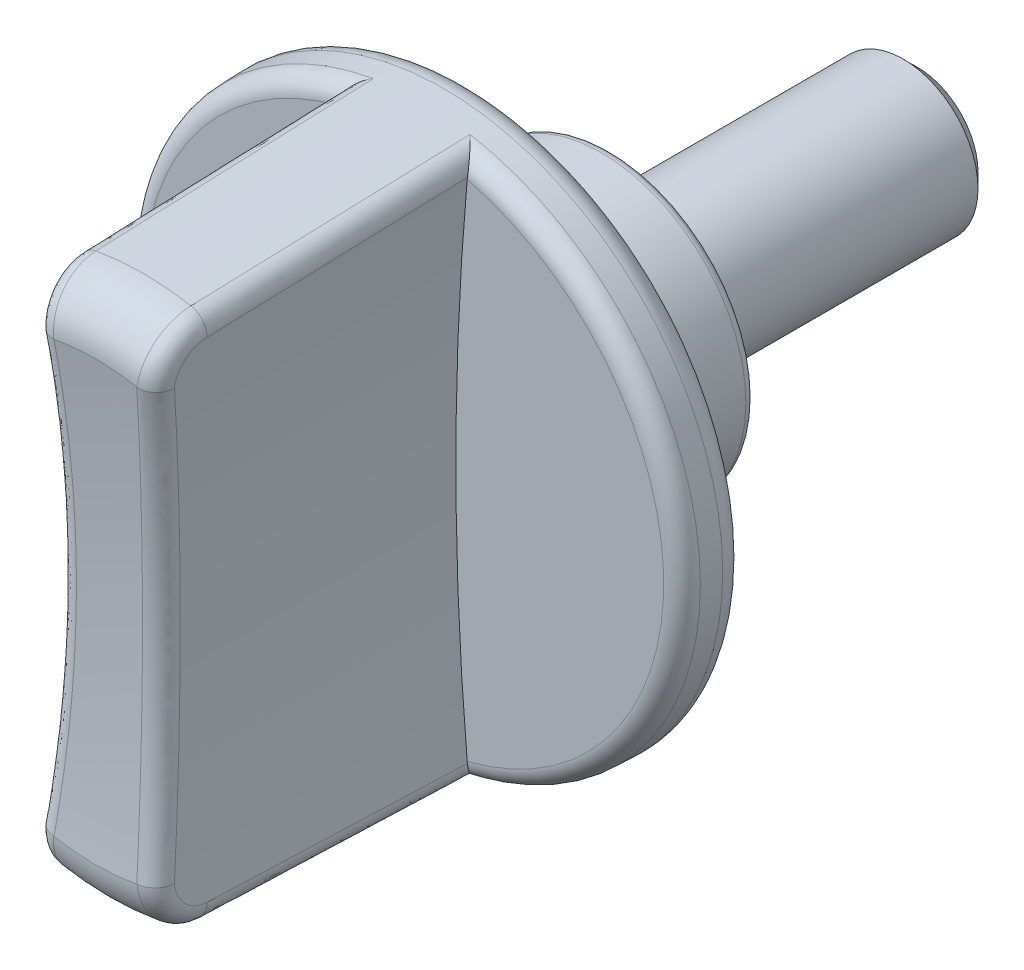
ISO-10303-21;
HEADER;
FILE_DESCRIPTION(('STEP AP214'),'2;1');
FILE_NAME('part.step','',(''),(''),'','','');
FILE_SCHEMA(('AUTOMOTIVE_DESIGN { 1 0 10303 214 1 1 1 1 }'));
ENDSEC;
DATA;
#1=APPLICATION_CONTEXT('core data for automotive mechanical design processes');
#2=APPLICATION_PROTOCOL_DEFINITION('international standard','automotive_design',2000,#1);
#3=PRODUCT_CONTEXT('',#1,'mechanical');
#4=PRODUCT('Part','Part','',(#3));
#5=PRODUCT_RELATED_PRODUCT_CATEGORY('part','',(#4));
#6=PRODUCT_DEFINITION_FORMATION('','',#4);
#7=PRODUCT_DEFINITION_CONTEXT('part definition',#1,'design');
#8=PRODUCT_DEFINITION('design','',#6,#7);
#9=PRODUCT_DEFINITION_SHAPE('','',#8);
#10=(LENGTH_UNIT() NAMED_UNIT(*) SI_UNIT(.MILLI.,.METRE.));
#11=(NAMED_UNIT(*) PLANE_ANGLE_UNIT() SI_UNIT($,.RADIAN.));
#12=(NAMED_UNIT(*) SI_UNIT($,.STERADIAN.) SOLID_ANGLE_UNIT());
#13=UNCERTAINTY_MEASURE_WITH_UNIT(LENGTH_MEASURE(1.E-05),#10,'distance_accuracy_value','');
#14=(GEOMETRIC_REPRESENTATION_CONTEXT(3) GLOBAL_UNCERTAINTY_ASSIGNED_CONTEXT((#13)) GLOBAL_UNIT_ASSIGNED_CONTEXT((#10,
#11,#12)) REPRESENTATION_CONTEXT('',''));
#15=CARTESIAN_POINT('',(0.,0.,0.));
#16=DIRECTION('',(0.,0.,1.));
#17=DIRECTION('',(1.,0.,0.));
#18=AXIS2_PLACEMENT_3D('',#15,#16,#17);
#19=CARTESIAN_POINT('',(0.,0.,9.37986599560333));
#20=DIRECTION('',(0.,0.,-1.));
#21=DIRECTION('',(-1.,0.,0.));
#22=AXIS2_PLACEMENT_3D('',#19,#20,#21);
#23=CONICAL_SURFACE('',#22,14.951814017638,0.0349065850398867);
#24=CARTESIAN_POINT('',(0.,0.,10.5348994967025));
#25=DIRECTION('',(0.,0.,-1.));
#26=DIRECTION('',(-1.,0.,0.));
#27=AXIS2_PLACEMENT_3D('',#24,#25,#26);
#28=CIRCLE('',#27,14.9114793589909);
#29=CARTESIAN_POINT('',(-2.58532278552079,-14.6856502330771,10.5348994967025));
#30=VERTEX_POINT('',#29);
#31=CARTESIAN_POINT('',(-2.58532278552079,14.6856502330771,10.5348994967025));
#32=VERTEX_POINT('',#31);
#33=EDGE_CURVE('E148',#30,#32,#28,.T.);
#34=ORIENTED_EDGE('',*,*,#33,.T.);
#35=CARTESIAN_POINT('',(-2.47226549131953,13.25972440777,51.2913866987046));
#36=CARTESIAN_POINT('',(-3.35907520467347,13.0944948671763,51.2881365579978));
#37=CARTESIAN_POINT('',(-3.28577574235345,12.1959580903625,51.2564872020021));
#38=CARTESIAN_POINT('',(-2.48334722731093,13.4107895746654,46.9805587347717));
#39=CARTESIAN_POINT('',(-3.37237798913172,13.2464409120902,46.9730443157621));
#40=CARTESIAN_POINT('',(-3.29799904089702,12.345796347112,46.9456592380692));
#41=CARTESIAN_POINT('',(-2.49471292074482,13.5617705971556,42.6697289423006));
#42=CARTESIAN_POINT('',(-3.38588966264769,13.3981050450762,42.6624615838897));
#43=CARTESIAN_POINT('',(-3.31044334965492,12.4955646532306,42.6348294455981));
#44=CARTESIAN_POINT('',(-2.51800094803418,13.863577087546,34.0480661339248));
#45=CARTESIAN_POINT('',(-3.41335840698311,13.7012205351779,34.0408916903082));
#46=CARTESIAN_POINT('',(-3.33577398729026,12.7949708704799,34.0131666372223));
#47=CARTESIAN_POINT('',(-2.52992328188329,14.014402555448,29.7372331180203));
#48=CARTESIAN_POINT('',(-3.42731499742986,13.8526566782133,29.7303247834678));
#49=CARTESIAN_POINT('',(-3.34866031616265,12.9446087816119,29.7023336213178));
#50=CARTESIAN_POINT('',(-2.55431331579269,14.3159106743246,21.1155641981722));
#51=CARTESIAN_POINT('',(-3.45567362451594,14.1553354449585,21.1087689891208));
#52=CARTESIAN_POINT('',(-3.37487499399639,13.2437637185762,21.0806647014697));
#53=CARTESIAN_POINT('',(-2.56678101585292,14.4665933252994,16.8047282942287));
#54=CARTESIAN_POINT('',(-3.4700752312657,14.3065643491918,16.7981599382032));
#55=CARTESIAN_POINT('',(-3.38820334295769,13.3932807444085,16.7698287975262));
#56=CARTESIAN_POINT('',(-2.59225257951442,14.767825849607,8.18305386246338));
#57=CARTESIAN_POINT('',(-3.4993237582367,14.6088404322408,8.17660813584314));
#58=CARTESIAN_POINT('',(-3.4153020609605,13.6922014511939,8.14815436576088));
#59=CARTESIAN_POINT('',(-2.60525644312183,14.9183757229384,3.87221533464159));
#60=CARTESIAN_POINT('',(-3.51417028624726,14.7598751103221,3.8660121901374));
#61=CARTESIAN_POINT('',(-3.42907243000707,13.8416051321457,3.83731583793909));
#62=CARTESIAN_POINT('',(-2.61852378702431,15.0688642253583,-0.438624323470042));
#63=CARTESIAN_POINT('',(-3.5292268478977,14.9107009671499,-0.441164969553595));
#64=CARTESIAN_POINT('',(-3.4430638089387,13.9909559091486,-0.473523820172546));
#65=(BOUNDED_SURFACE() B_SPLINE_SURFACE(3,2,((#35,#36,#37),(#38,#39,#40),(#41,#42,#43),(#44,#45,
#46),(#47,#48,#49),(#50,#51,#52),(#53,#54,#55),(#56,#57,#58),(#59,#60,#61),(#62,#63,#64)),
.UNSPECIFIED.,.F.,.F.,.F.) B_SPLINE_SURFACE_WITH_KNOTS((4,2,2,2,4),(3,3),(0.,12.9404508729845,
25.8809015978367,38.8213523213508,51.761803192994),(0.,1.),
.UNSPECIFIED.) GEOMETRIC_REPRESENTATION_ITEM() RATIONAL_B_SPLINE_SURFACE(((1.,0.742526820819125,
1.),(1.,0.741774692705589,1.),(1.,0.741042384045,1.),(1.,0.73961385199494,1.),(1.,
0.738917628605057,1.),(1.,0.737557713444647,1.),(1.,0.736894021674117,1.),(1.,0.735596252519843,
1.),(1.,0.734962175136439,1.),(1.,0.734341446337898,1.))) REPRESENTATION_ITEM('') SURFACE());
#66=CARTESIAN_POINT('',(-2.61852378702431,15.0688642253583,-0.438624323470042));
#67=CARTESIAN_POINT('',(-2.60525644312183,14.9183757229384,3.8722153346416));
#68=CARTESIAN_POINT('',(-2.59225257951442,14.767825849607,8.18305386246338));
#69=CARTESIAN_POINT('',(-2.56678101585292,14.4665933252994,16.8047282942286));
#70=CARTESIAN_POINT('',(-2.55431331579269,14.3159106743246,21.1155641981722));
#71=CARTESIAN_POINT('',(-2.52992328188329,14.0144025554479,29.7372331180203));
#72=CARTESIAN_POINT('',(-2.51800094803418,13.863577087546,34.0480661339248));
#73=CARTESIAN_POINT('',(-2.49471292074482,13.5617705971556,42.6697289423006));
#74=CARTESIAN_POINT('',(-2.48334722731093,13.4107895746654,46.9805587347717));
#75=CARTESIAN_POINT('',(-2.47226549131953,13.25972440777,51.2913866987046));
#76=B_SPLINE_CURVE_WITH_KNOTS('',3,(#66,#67,#68,#69,#70,#71,#72,#73,#74,#75),.UNSPECIFIED.,.F.,
.F.,(4,2,2,2,4),(0.,12.9404508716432,25.8809015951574,38.8213523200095,51.761803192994),.UNSPECIFIED.);
#77=CARTESIAN_POINT('',(-2.54211829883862,14.1651566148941,25.4263986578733));
#78=VERTEX_POINT('',#77);
#79=EDGE_CURVE('E626',#32,#78,#76,.T.);
#80=ORIENTED_EDGE('',*,*,#79,.T.);
#81=CARTESIAN_POINT('',(0.,0.,25.4263986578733));
#82=DIRECTION('',(0.,0.,1.));
#83=DIRECTION('',(1.,0.,0.));
#84=AXIS2_PLACEMENT_3D('',#81,#82,#83);
#85=CIRCLE('',#84,14.3914567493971);
#86=CARTESIAN_POINT('',(2.54211829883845,14.1651566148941,25.4263986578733));
#87=VERTEX_POINT('',#86);
#88=EDGE_CURVE('E165',#87,#78,#85,.T.);
#89=ORIENTED_EDGE('',*,*,#88,.F.);
#90=CARTESIAN_POINT('',(3.28577574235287,12.1959580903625,51.2564872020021));
#91=CARTESIAN_POINT('',(3.35907520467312,13.0944948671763,51.2881365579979));
#92=CARTESIAN_POINT('',(2.47226549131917,13.25972440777,51.2913866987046));
#93=CARTESIAN_POINT('',(3.29799904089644,12.345796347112,46.9456592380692));
#94=CARTESIAN_POINT('',(3.37237798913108,13.2464409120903,46.9730443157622));
#95=CARTESIAN_POINT('',(2.48334722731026,13.4107895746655,46.9805587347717));
#96=CARTESIAN_POINT('',(3.31044334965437,12.4955646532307,42.6348294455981));
#97=CARTESIAN_POINT('',(3.38588966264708,13.3981050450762,42.6624615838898));
#98=CARTESIAN_POINT('',(2.49471292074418,13.5617705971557,42.6697289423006));
#99=CARTESIAN_POINT('',(3.3357739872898,12.7949708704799,34.0131666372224));
#100=CARTESIAN_POINT('',(3.41335840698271,13.701220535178,34.0408916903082));
#101=CARTESIAN_POINT('',(2.51800094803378,13.863577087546,34.0480661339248));
#102=CARTESIAN_POINT('',(3.34866031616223,12.9446087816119,29.7023336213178));
#103=CARTESIAN_POINT('',(3.42731499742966,13.8526566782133,29.7303247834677));
#104=CARTESIAN_POINT('',(2.52992328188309,14.0144025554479,29.7372331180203));
#105=CARTESIAN_POINT('',(3.37487499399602,13.2437637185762,21.0806647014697));
#106=CARTESIAN_POINT('',(3.4556736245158,14.1553354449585,21.1087689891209));
#107=CARTESIAN_POINT('',(2.55431331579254,14.3159106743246,21.1155641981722));
#108=CARTESIAN_POINT('',(3.38820334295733,13.3932807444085,16.7698287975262));
#109=CARTESIAN_POINT('',(3.47007523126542,14.3065643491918,16.7981599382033));
#110=CARTESIAN_POINT('',(2.56678101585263,14.4665933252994,16.8047282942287));
#111=CARTESIAN_POINT('',(3.41530206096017,13.6922014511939,8.14815436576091));
#112=CARTESIAN_POINT('',(3.4993237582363,14.6088404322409,8.17660813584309));
#113=CARTESIAN_POINT('',(2.592252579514,14.7678258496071,8.18305386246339));
#114=CARTESIAN_POINT('',(3.42907243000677,13.8416051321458,3.83731583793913));
#115=CARTESIAN_POINT('',(3.51417028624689,14.7598751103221,3.86601219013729));
#116=CARTESIAN_POINT('',(2.60525644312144,14.9183757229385,3.87221533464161));
#117=CARTESIAN_POINT('',(3.44306380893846,13.9909559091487,-0.473523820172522));
#118=CARTESIAN_POINT('',(3.52922684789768,14.9107009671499,-0.441164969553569));
#119=CARTESIAN_POINT('',(2.61852378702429,15.0688642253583,-0.438624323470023));
#120=(BOUNDED_SURFACE() B_SPLINE_SURFACE(3,2,((#90,#91,#92),(#93,#94,#95),(#96,#97,#98),(#99,
#100,#101),(#102,#103,#104),(#105,#106,#107),(#108,#109,#110),(#111,#112,#113),(#114,#115,#116),
(#117,#118,#119)),.UNSPECIFIED.,.F.,.F.,.F.) B_SPLINE_SURFACE_WITH_KNOTS((4,2,2,2,4),(3,3),(0.,
12.9404508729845,25.8809015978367,38.8213523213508,51.761803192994),(0.,1.),
.UNSPECIFIED.) GEOMETRIC_REPRESENTATION_ITEM() RATIONAL_B_SPLINE_SURFACE(((1.,0.742526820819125,
1.),(1.,0.74177469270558,1.),(1.,0.741042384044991,1.),(1.,0.739613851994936,1.),(1.,
0.738917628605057,1.),(1.,0.737557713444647,1.),(1.,0.736894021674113,1.),(1.,0.735596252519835,
1.),(1.,0.73496217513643,1.),(1.,0.734341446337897,1.))) REPRESENTATION_ITEM('') SURFACE());
#121=CARTESIAN_POINT('',(2.47226549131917,13.25972440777,51.2913866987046));
#122=CARTESIAN_POINT('',(2.48334722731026,13.4107895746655,46.9805587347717));
#123=CARTESIAN_POINT('',(2.49471292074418,13.5617705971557,42.6697289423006));
#124=CARTESIAN_POINT('',(2.51800094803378,13.863577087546,34.0480661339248));
#125=CARTESIAN_POINT('',(2.52992328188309,14.0144025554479,29.7372331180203));
#126=CARTESIAN_POINT('',(2.55431331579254,14.3159106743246,21.1155641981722));
#127=CARTESIAN_POINT('',(2.56678101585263,14.4665933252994,16.8047282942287));
#128=CARTESIAN_POINT('',(2.592252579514,14.7678258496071,8.18305386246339));
#129=CARTESIAN_POINT('',(2.60525644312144,14.9183757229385,3.87221533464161));
#130=CARTESIAN_POINT('',(2.61852378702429,15.0688642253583,-0.438624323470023));
#131=B_SPLINE_CURVE_WITH_KNOTS('',3,(#121,#122,#123,#124,#125,#126,#127,#128,#129,#130),
.UNSPECIFIED.,.F.,.F.,(4,2,2,2,4),(0.,12.9404508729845,25.8809015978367,38.8213523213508,
51.761803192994),.UNSPECIFIED.);
#132=CARTESIAN_POINT('',(2.58532278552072,14.6856502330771,10.5348994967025));
#133=VERTEX_POINT('',#132);
#134=EDGE_CURVE('E149',#87,#133,#131,.T.);
#135=ORIENTED_EDGE('',*,*,#134,.T.);
#136=CARTESIAN_POINT('',(0.,0.,10.5348994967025));
#137=DIRECTION('',(0.,0.,-1.));
#138=DIRECTION('',(-1.,0.,0.));
#139=AXIS2_PLACEMENT_3D('',#136,#137,#138);
#140=CIRCLE('',#139,14.9114793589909);
#141=CARTESIAN_POINT('',(2.58532278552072,-14.6856502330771,10.5348994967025));
#142=VERTEX_POINT('',#141);
#143=EDGE_CURVE('E356',#133,#142,#140,.T.);
#144=ORIENTED_EDGE('',*,*,#143,.T.);
#145=CARTESIAN_POINT('',(2.47226549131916,-13.25972440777,51.2913866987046));
#146=CARTESIAN_POINT('',(3.35907520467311,-13.0944948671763,51.2881365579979));
#147=CARTESIAN_POINT('',(3.28577574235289,-12.1959580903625,51.2564872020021));
#148=CARTESIAN_POINT('',(2.48334722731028,-13.4107895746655,46.9805587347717));
#149=CARTESIAN_POINT('',(3.37237798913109,-13.2464409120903,46.9730443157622));
#150=CARTESIAN_POINT('',(3.29799904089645,-12.345796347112,46.9456592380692));
#151=CARTESIAN_POINT('',(2.4947129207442,-13.5617705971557,42.6697289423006));
#152=CARTESIAN_POINT('',(3.3858896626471,-13.3981050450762,42.6624615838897));
#153=CARTESIAN_POINT('',(3.31044334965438,-12.4955646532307,42.6348294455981));
#154=CARTESIAN_POINT('',(2.51800094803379,-13.863577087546,34.0480661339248));
#155=CARTESIAN_POINT('',(3.41335840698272,-13.701220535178,34.0408916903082));
#156=CARTESIAN_POINT('',(3.33577398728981,-12.7949708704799,34.0131666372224));
#157=CARTESIAN_POINT('',(2.52992328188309,-14.014402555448,29.7372331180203));
#158=CARTESIAN_POINT('',(3.42731499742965,-13.8526566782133,29.7303247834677));
#159=CARTESIAN_POINT('',(3.34866031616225,-12.9446087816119,29.7023336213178));
#160=CARTESIAN_POINT('',(2.55431331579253,-14.3159106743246,21.1155641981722));
#161=CARTESIAN_POINT('',(3.45567362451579,-14.1553354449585,21.1087689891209));
#162=CARTESIAN_POINT('',(3.37487499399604,-13.2437637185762,21.0806647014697));
#163=CARTESIAN_POINT('',(2.56678101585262,-14.4665933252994,16.8047282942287));
#164=CARTESIAN_POINT('',(3.47007523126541,-14.3065643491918,16.7981599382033));
#165=CARTESIAN_POINT('',(3.38820334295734,-13.3932807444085,16.7698287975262));
#166=CARTESIAN_POINT('',(2.59225257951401,-14.7678258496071,8.18305386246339));
#167=CARTESIAN_POINT('',(3.49932375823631,-14.6088404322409,8.1766081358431));
#168=CARTESIAN_POINT('',(3.41530206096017,-13.6922014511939,8.14815436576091));
#169=CARTESIAN_POINT('',(2.60525644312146,-14.9183757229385,3.87221533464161));
#170=CARTESIAN_POINT('',(3.51417028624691,-14.7598751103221,3.86601219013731));
#171=CARTESIAN_POINT('',(3.42907243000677,-13.8416051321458,3.83731583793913));
#172=CARTESIAN_POINT('',(2.61852378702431,-15.0688642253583,-0.438624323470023));
#173=CARTESIAN_POINT('',(3.5292268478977,-14.9107009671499,-0.441164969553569));
#174=CARTESIAN_POINT('',(3.44306380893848,-13.9909559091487,-0.473523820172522));
#175=(BOUNDED_SURFACE() B_SPLINE_SURFACE(3,2,((#145,#146,#147),(#148,#149,#150),(#151,#152,
#153),(#154,#155,#156),(#157,#158,#159),(#160,#161,#162),(#163,#164,#165),(#166,#167,#168),
(#169,#170,#171),(#172,#173,#174)),.UNSPECIFIED.,.F.,.F.,.F.) B_SPLINE_SURFACE_WITH_KNOTS((4,2,
2,2,4),(3,3),(0.,12.9404508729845,25.8809015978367,38.8213523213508,51.761803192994),(0.,1.),
.UNSPECIFIED.) GEOMETRIC_REPRESENTATION_ITEM() RATIONAL_B_SPLINE_SURFACE(((1.,0.742526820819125,
1.),(1.,0.741774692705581,1.),(1.,0.741042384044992,1.),(1.,0.739613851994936,1.),(1.,
0.738917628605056,1.),(1.,0.737557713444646,1.),(1.,0.736894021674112,1.),(1.,0.735596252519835,
1.),(1.,0.734962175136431,1.),(1.,0.734341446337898,1.))) REPRESENTATION_ITEM('') SURFACE());
#176=CARTESIAN_POINT('',(2.61852378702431,-15.0688642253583,-0.438624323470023));
#177=CARTESIAN_POINT('',(2.60525644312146,-14.9183757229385,3.87221533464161));
#178=CARTESIAN_POINT('',(2.59225257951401,-14.7678258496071,8.18305386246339));
#179=CARTESIAN_POINT('',(2.56678101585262,-14.4665933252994,16.8047282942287));
#180=CARTESIAN_POINT('',(2.55431331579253,-14.3159106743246,21.1155641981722));
#181=CARTESIAN_POINT('',(2.52992328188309,-14.014402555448,29.7372331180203));
#182=CARTESIAN_POINT('',(2.51800094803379,-13.863577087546,34.0480661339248));
#183=CARTESIAN_POINT('',(2.4947129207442,-13.5617705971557,42.6697289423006));
#184=CARTESIAN_POINT('',(2.48334722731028,-13.4107895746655,46.9805587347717));
#185=CARTESIAN_POINT('',(2.47226549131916,-13.25972440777,51.2913866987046));
#186=B_SPLINE_CURVE_WITH_KNOTS('',3,(#176,#177,#178,#179,#180,#181,#182,#183,#184,#185),
.UNSPECIFIED.,.F.,.F.,(4,2,2,2,4),(0.,12.9404508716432,25.8809015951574,38.8213523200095,
51.761803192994),.UNSPECIFIED.);
#187=CARTESIAN_POINT('',(2.54211829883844,-14.1651566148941,25.4263986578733));
#188=VERTEX_POINT('',#187);
#189=EDGE_CURVE('E164',#142,#188,#186,.T.);
#190=ORIENTED_EDGE('',*,*,#189,.T.);
#191=CARTESIAN_POINT('',(-2.54211829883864,-14.1651566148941,25.4263986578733));
#192=VERTEX_POINT('',#191);
#193=EDGE_CURVE('E154',#192,#188,#85,.T.);
#194=ORIENTED_EDGE('',*,*,#193,.F.);
#195=CARTESIAN_POINT('',(-3.28577574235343,-12.1959580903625,51.2564872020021));
#196=CARTESIAN_POINT('',(-3.35907520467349,-13.0944948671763,51.2881365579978));
#197=CARTESIAN_POINT('',(-2.47226549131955,-13.25972440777,51.2913866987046));
#198=CARTESIAN_POINT('',(-3.29799904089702,-12.345796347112,46.9456592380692));
#199=CARTESIAN_POINT('',(-3.37237798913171,-13.2464409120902,46.9730443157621));
#200=CARTESIAN_POINT('',(-2.48334722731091,-13.4107895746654,46.9805587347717));
#201=CARTESIAN_POINT('',(-3.31044334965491,-12.4955646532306,42.6348294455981));
#202=CARTESIAN_POINT('',(-3.38588966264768,-13.3981050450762,42.6624615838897));
#203=CARTESIAN_POINT('',(-2.4947129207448,-13.5617705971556,42.6697289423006));
#204=CARTESIAN_POINT('',(-3.33577398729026,-12.7949708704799,34.0131666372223));
#205=CARTESIAN_POINT('',(-3.41335840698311,-13.7012205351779,34.0408916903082));
#206=CARTESIAN_POINT('',(-2.51800094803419,-13.863577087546,34.0480661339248));
#207=CARTESIAN_POINT('',(-3.34866031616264,-12.9446087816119,29.7023336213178));
#208=CARTESIAN_POINT('',(-3.42731499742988,-13.8526566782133,29.7303247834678));
#209=CARTESIAN_POINT('',(-2.52992328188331,-14.0144025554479,29.7372331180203));
#210=CARTESIAN_POINT('',(-3.37487499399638,-13.2437637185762,21.0806647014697));
#211=CARTESIAN_POINT('',(-3.45567362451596,-14.1553354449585,21.1087689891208));
#212=CARTESIAN_POINT('',(-2.5543133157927,-14.3159106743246,21.1155641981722));
#213=CARTESIAN_POINT('',(-3.38820334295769,-13.3932807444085,16.7698287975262));
#214=CARTESIAN_POINT('',(-3.47007523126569,-14.3065643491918,16.7981599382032));
#215=CARTESIAN_POINT('',(-2.56678101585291,-14.4665933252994,16.8047282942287));
#216=CARTESIAN_POINT('',(-3.41530206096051,-13.6922014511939,8.14815436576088));
#217=CARTESIAN_POINT('',(-3.49932375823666,-14.6088404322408,8.17660813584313));
#218=CARTESIAN_POINT('',(-2.59225257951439,-14.767825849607,8.18305386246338));
#219=CARTESIAN_POINT('',(-3.42907243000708,-13.8416051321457,3.83731583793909));
#220=CARTESIAN_POINT('',(-3.51417028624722,-14.7598751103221,3.86601219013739));
#221=CARTESIAN_POINT('',(-2.60525644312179,-14.9183757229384,3.87221533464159));
#222=CARTESIAN_POINT('',(-3.44306380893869,-13.9909559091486,-0.473523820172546));
#223=CARTESIAN_POINT('',(-3.52922684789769,-14.9107009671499,-0.441164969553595));
#224=CARTESIAN_POINT('',(-2.6185237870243,-15.0688642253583,-0.438624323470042));
#225=(BOUNDED_SURFACE() B_SPLINE_SURFACE(3,2,((#195,#196,#197),(#198,#199,#200),(#201,#202,
#203),(#204,#205,#206),(#207,#208,#209),(#210,#211,#212),(#213,#214,#215),(#216,#217,#218),
(#219,#220,#221),(#222,#223,#224)),.UNSPECIFIED.,.F.,.F.,.F.) B_SPLINE_SURFACE_WITH_KNOTS((4,2,
2,2,4),(3,3),(0.,12.9404508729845,25.8809015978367,38.8213523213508,51.761803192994),(0.,1.),
.UNSPECIFIED.) GEOMETRIC_REPRESENTATION_ITEM() RATIONAL_B_SPLINE_SURFACE(((1.,0.742526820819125,
1.),(1.,0.741774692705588,1.),(1.,0.741042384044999,1.),(1.,0.73961385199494,1.),(1.,
0.738917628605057,1.),(1.,0.737557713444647,1.),(1.,0.736894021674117,1.),(1.,0.735596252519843,
1.),(1.,0.734962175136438,1.),(1.,0.734341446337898,1.))) REPRESENTATION_ITEM('') SURFACE());
#226=CARTESIAN_POINT('',(-2.47226549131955,-13.25972440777,51.2913866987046));
#227=CARTESIAN_POINT('',(-2.48334722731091,-13.4107895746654,46.9805587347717));
#228=CARTESIAN_POINT('',(-2.4947129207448,-13.5617705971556,42.6697289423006));
#229=CARTESIAN_POINT('',(-2.51800094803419,-13.863577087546,34.0480661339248));
#230=CARTESIAN_POINT('',(-2.52992328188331,-14.0144025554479,29.7372331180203));
#231=CARTESIAN_POINT('',(-2.5543133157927,-14.3159106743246,21.1155641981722));
#232=CARTESIAN_POINT('',(-2.56678101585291,-14.4665933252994,16.8047282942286));
#233=CARTESIAN_POINT('',(-2.59225257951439,-14.767825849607,8.18305386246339));
#234=CARTESIAN_POINT('',(-2.60525644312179,-14.9183757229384,3.8722153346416));
#235=CARTESIAN_POINT('',(-2.6185237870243,-15.0688642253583,-0.438624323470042));
#236=B_SPLINE_CURVE_WITH_KNOTS('',3,(#226,#227,#228,#229,#230,#231,#232,#233,#234,#235),
.UNSPECIFIED.,.F.,.F.,(4,2,2,2,4),(0.,12.9404508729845,25.8809015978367,38.8213523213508,
51.761803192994),.UNSPECIFIED.);
#237=EDGE_CURVE('E141',#192,#30,#236,.T.);
#238=ORIENTED_EDGE('',*,*,#237,.T.);
#239=EDGE_LOOP('',(#34,#80,#89,#135,#144,#190,#194,#238));
#240=FACE_BOUND('',#239,.T.);
#241=CARTESIAN_POINT('',(0.,0.,9.37986599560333));
#242=DIRECTION('',(0.,0.,1.));
#243=DIRECTION('',(1.,0.,0.));
#244=AXIS2_PLACEMENT_3D('',#241,#242,#243);
#245=CIRCLE('',#244,14.951814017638);
#246=CARTESIAN_POINT('',(14.951814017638,0.,9.37986599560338));
#247=VERTEX_POINT('',#246);
#248=EDGE_CURVE('E169',#247,#247,#245,.T.);
#249=ORIENTED_EDGE('',*,*,#248,.T.);
#250=EDGE_LOOP('',(#249));
#251=FACE_BOUND('',#250,.T.);
#252=ADVANCED_FACE('F14',(#240,#251),#23,.T.);
#253=CARTESIAN_POINT('',(0.,0.,25.3333333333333));
#254=DIRECTION('',(0.,0.,1.));
#255=DIRECTION('',(1.,0.,0.));
#256=AXIS2_PLACEMENT_3D('',#253,#254,#255);
#257=TOROIDAL_SURFACE('',#256,11.7264145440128,2.66666666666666);
#258=CARTESIAN_POINT('',(-5.09660929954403,26.2090390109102,30.2386060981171));
#259=CARTESIAN_POINT('',(-5.04566440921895,25.9219556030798,31.1887265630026));
#260=CARTESIAN_POINT('',(-4.06680563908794,26.0938344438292,31.1945861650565));
#261=CARTESIAN_POINT('',(-4.90775050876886,25.144919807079,29.9047265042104));
#262=CARTESIAN_POINT('',(-4.86064558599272,24.8673892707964,30.8601550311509));
#263=CARTESIAN_POINT('',(-3.87877699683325,25.0343926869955,30.8643755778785));
#264=CARTESIAN_POINT('',(-4.72935205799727,24.0726340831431,29.5912097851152));
#265=CARTESIAN_POINT('',(-4.68612565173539,23.8061708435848,30.5520515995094));
#266=CARTESIAN_POINT('',(-3.7011627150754,23.9668203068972,30.5543040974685));
#267=CARTESIAN_POINT('',(-4.39445096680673,21.9135860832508,29.005414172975));
#268=CARTESIAN_POINT('',(-4.35848164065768,21.6694836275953,29.9763070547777));
#269=CARTESIAN_POINT('',(-3.36773371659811,21.8172626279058,29.9749457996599));
#270=CARTESIAN_POINT('',(-4.23794909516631,20.8268233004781,28.7331367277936));
#271=CARTESIAN_POINT('',(-4.20543787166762,20.5942444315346,29.7088125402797));
#272=CARTESIAN_POINT('',(-3.21191976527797,20.7352768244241,29.7056604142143));
#273=CARTESIAN_POINT('',(-3.9478166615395,18.640654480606,28.2303326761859));
#274=CARTESIAN_POINT('',(-3.92168140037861,18.4313042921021,29.2147619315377));
#275=CARTESIAN_POINT('',(-2.92306263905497,18.558717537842,29.2083816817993));
#276=CARTESIAN_POINT('',(-3.81418815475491,17.5412473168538,27.9998098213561));
#277=CARTESIAN_POINT('',(-3.79104328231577,17.3438567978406,28.9883392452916));
#278=CARTESIAN_POINT('',(-2.79002151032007,17.464142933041,28.9803920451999));
#279=CARTESIAN_POINT('',(-3.57063498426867,15.3320182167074,27.5809917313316));
#280=CARTESIAN_POINT('',(-3.5529068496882,15.1586323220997,28.5769010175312));
#281=CARTESIAN_POINT('',(-2.5475389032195,15.2646247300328,28.5661763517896));
#282=CARTESIAN_POINT('',(-3.46070990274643,14.2221964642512,27.3926957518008));
#283=CARTESIAN_POINT('',(-3.44547160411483,14.0611311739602,28.3919963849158));
#284=CARTESIAN_POINT('',(-2.43809700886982,14.1596813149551,28.3799495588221));
#285=CARTESIAN_POINT('',(-3.17324072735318,10.9448663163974,26.9014345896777));
#286=CARTESIAN_POINT('',(-3.16430251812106,10.8183834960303,27.9092094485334));
#287=CARTESIAN_POINT('',(-2.15189143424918,10.896757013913,27.8940868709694));
#288=CARTESIAN_POINT('',(-3.02946496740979,8.765254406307,26.6574036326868));
#289=CARTESIAN_POINT('',(-3.02394203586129,8.66439004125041,27.6698295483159));
#290=CARTESIAN_POINT('',(-2.00874765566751,8.72672581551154,27.6527375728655));
#291=CARTESIAN_POINT('',(-2.83742503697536,4.39042701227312,26.3318875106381));
#292=CARTESIAN_POINT('',(-2.83626907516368,4.33910628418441,27.3501807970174));
#293=CARTESIAN_POINT('',(-1.81755185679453,4.37112843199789,27.3307985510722));
#294=CARTESIAN_POINT('',(-2.78914896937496,2.19521350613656,26.2503820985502));
#295=CARTESIAN_POINT('',(-2.78914896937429,2.17015132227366,27.2702402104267));
#296=CARTESIAN_POINT('',(-1.76948799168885,2.18556421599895,27.2501888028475));
#297=CARTESIAN_POINT('',(-2.78914896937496,-2.19521350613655,26.2503820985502));
#298=CARTESIAN_POINT('',(-2.78914896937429,-2.17015132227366,27.2702402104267));
#299=CARTESIAN_POINT('',(-1.76948799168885,-2.18556421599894,27.2501888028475));
#300=CARTESIAN_POINT('',(-2.83742503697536,-4.39042701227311,26.3318875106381));
#301=CARTESIAN_POINT('',(-2.83626907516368,-4.33910628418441,27.3501807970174));
#302=CARTESIAN_POINT('',(-1.81755185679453,-4.37112843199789,27.3307985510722));
#303=CARTESIAN_POINT('',(-3.02946496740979,-8.765254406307,26.6574036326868));
#304=CARTESIAN_POINT('',(-3.02394203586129,-8.66439004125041,27.6698295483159));
#305=CARTESIAN_POINT('',(-2.00874765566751,-8.72672581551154,27.6527375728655));
#306=CARTESIAN_POINT('',(-3.17324072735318,-10.9448663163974,26.9014345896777));
#307=CARTESIAN_POINT('',(-3.16430251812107,-10.8183834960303,27.9092094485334));
#308=CARTESIAN_POINT('',(-2.15189143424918,-10.896757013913,27.8940868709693));
#309=CARTESIAN_POINT('',(-3.46070990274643,-14.2221964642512,27.3926957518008));
#310=CARTESIAN_POINT('',(-3.44547160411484,-14.0611311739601,28.3919963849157));
#311=CARTESIAN_POINT('',(-2.43809700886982,-14.1596813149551,28.3799495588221));
#312=CARTESIAN_POINT('',(-3.57063498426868,-15.3320182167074,27.5809917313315));
#313=CARTESIAN_POINT('',(-3.55290684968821,-15.1586323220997,28.5769010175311));
#314=CARTESIAN_POINT('',(-2.5475389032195,-15.2646247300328,28.5661763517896));
#315=CARTESIAN_POINT('',(-3.81418815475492,-17.5412473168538,27.9998098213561));
#316=CARTESIAN_POINT('',(-3.79104328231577,-17.3438567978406,28.9883392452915));
#317=CARTESIAN_POINT('',(-2.79002151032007,-17.464142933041,28.9803920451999));
#318=CARTESIAN_POINT('',(-3.94781666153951,-18.640654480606,28.2303326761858));
#319=CARTESIAN_POINT('',(-3.9216814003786,-18.4313042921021,29.2147619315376));
#320=CARTESIAN_POINT('',(-2.92306263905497,-18.558717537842,29.2083816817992));
#321=CARTESIAN_POINT('',(-4.23794909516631,-20.8268233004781,28.7331367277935));
#322=CARTESIAN_POINT('',(-4.20543787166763,-20.5942444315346,29.7088125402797));
#323=CARTESIAN_POINT('',(-3.21191976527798,-20.7352768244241,29.7056604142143));
#324=CARTESIAN_POINT('',(-4.39445096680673,-21.9135860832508,29.0054141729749));
#325=CARTESIAN_POINT('',(-4.3584816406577,-21.6694836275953,29.9763070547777));
#326=CARTESIAN_POINT('',(-3.36773371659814,-21.8172626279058,29.9749457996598));
#327=CARTESIAN_POINT('',(-4.72935205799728,-24.0726340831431,29.5912097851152));
#328=CARTESIAN_POINT('',(-4.68612565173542,-23.8061708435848,30.5520515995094));
#329=CARTESIAN_POINT('',(-3.70116271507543,-23.9668203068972,30.5543040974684));
#330=CARTESIAN_POINT('',(-4.90775050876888,-25.144919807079,29.9047265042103));
#331=CARTESIAN_POINT('',(-4.86064558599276,-24.8673892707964,30.8601550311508));
#332=CARTESIAN_POINT('',(-3.87877699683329,-25.0343926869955,30.8643755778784));
#333=CARTESIAN_POINT('',(-5.09660929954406,-26.2090390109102,30.238606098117));
#334=CARTESIAN_POINT('',(-5.04566440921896,-25.9219556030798,31.1887265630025));
#335=CARTESIAN_POINT('',(-4.06680563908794,-26.0938344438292,31.1945861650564));
#336=(BOUNDED_SURFACE() B_SPLINE_SURFACE(3,2,((#258,#259,#260),(#261,#262,#263),(#264,#265,
#266),(#267,#268,#269),(#270,#271,#272),(#273,#274,#275),(#276,#277,#278),(#279,#280,#281),
(#282,#283,#284),(#285,#286,#287),(#288,#289,#290),(#291,#292,#293),(#294,#295,#296),(#297,#298,
#299),(#300,#301,#302),(#303,#304,#305),(#306,#307,#308),(#309,#310,#311),(#312,#313,#314),
(#315,#316,#317),(#318,#319,#320),(#321,#322,#323),(#324,#325,#326),(#327,#328,#329),(#330,#331,
#332),(#333,#334,#335)),.UNSPECIFIED.,.F.,.F.,.F.) B_SPLINE_SURFACE_WITH_KNOTS((4,2,2,2,2,2,2,2,
2,2,2,2,4),(3,3),(0.,3.41384072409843,6.82780127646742,10.2420684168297,13.6562753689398,
20.2847522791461,26.9124033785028,33.5400544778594,40.1685313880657,43.5827383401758,
46.9970054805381,50.4109660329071,53.8248067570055),(0.,1.),
.UNSPECIFIED.) GEOMETRIC_REPRESENTATION_ITEM() RATIONAL_B_SPLINE_SURFACE(((1.,0.709283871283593,
1.),(1.,0.708538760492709,1.),(1.,0.707833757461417,1.),(1.,0.706508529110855,1.),(1.,
0.705888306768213,1.),(1.,0.704737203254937,1.),(1.,0.704206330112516,1.),(1.,0.703237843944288,
1.),(1.,0.702800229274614,1.),(1.,0.701654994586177,1.),(1.,0.701081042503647,1.),(1.,
0.700314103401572,1.),(1.,0.700121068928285,1.),(1.,0.700121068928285,1.),(1.,0.700314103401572,
1.),(1.,0.701081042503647,1.),(1.,0.701654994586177,1.),(1.,0.702800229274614,1.),(1.,
0.703237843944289,1.),(1.,0.704206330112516,1.),(1.,0.704737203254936,1.),(1.,0.705888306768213,
1.),(1.,0.706508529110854,1.),(1.,0.707833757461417,1.),(1.,0.70853876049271,1.),(1.,
0.709283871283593,1.))) REPRESENTATION_ITEM('') SURFACE());
#337=CARTESIAN_POINT('',(-2.21412295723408,-11.5154877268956,28.));
#338=CARTESIAN_POINT('',(-2.21653634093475,-11.5149537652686,28.0000000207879));
#339=CARTESIAN_POINT('',(-2.21896356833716,-11.5145229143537,28.00000002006));
#340=CARTESIAN_POINT('',(-2.2238457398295,-11.5138674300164,27.9999999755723));
#341=CARTESIAN_POINT('',(-2.22630068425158,-11.513642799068,27.9999999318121));
#342=CARTESIAN_POINT('',(-2.22876947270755,-11.5135212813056,27.9999998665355));
#343=B_SPLINE_CURVE_WITH_KNOTS('',3,(#337,#338,#339,#340,#341,#342),.UNSPECIFIED.,.F.,.F.,(4,2,
4),(0.,0.007395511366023,0.0147911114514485),.UNSPECIFIED.);
#344=CARTESIAN_POINT('',(-2.21412295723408,-11.5154877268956,28.));
#345=VERTEX_POINT('',#344);
#346=CARTESIAN_POINT('',(-2.22876947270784,-11.5135212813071,27.9999998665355));
#347=VERTEX_POINT('',#346);
#348=EDGE_CURVE('E158',#345,#347,#343,.T.);
#349=ORIENTED_EDGE('',*,*,#348,.T.);
#350=CARTESIAN_POINT('',(-2.53756322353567,-14.1263760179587,24.8697783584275));
#351=CARTESIAN_POINT('',(-3.43812056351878,-13.9671539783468,24.8839842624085));
#352=CARTESIAN_POINT('',(-3.35964859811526,-13.0699815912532,25.0436114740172));
#353=CARTESIAN_POINT('',(-2.53945556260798,-14.1424869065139,24.961485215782));
#354=CARTESIAN_POINT('',(-3.43951590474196,-13.9824035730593,24.9729244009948));
#355=CARTESIAN_POINT('',(-3.36052845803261,-13.0800371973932,25.1009282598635));
#356=CARTESIAN_POINT('',(-2.5407842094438,-14.1537986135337,25.0539897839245));
#357=CARTESIAN_POINT('',(-3.44049634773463,-13.9931090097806,25.0626106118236));
#358=CARTESIAN_POINT('',(-3.36114664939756,-13.0870973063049,25.1587436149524));
#359=CARTESIAN_POINT('',(-2.5423071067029,-14.1667640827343,25.2398323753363));
#360=CARTESIAN_POINT('',(-3.44162036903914,-14.0053770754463,25.2427264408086));
#361=CARTESIAN_POINT('',(-3.36185544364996,-13.0951895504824,25.2748952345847));
#362=CARTESIAN_POINT('',(-2.54249956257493,-14.1684025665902,25.3331714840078));
#363=CARTESIAN_POINT('',(-3.44176288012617,-14.0069280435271,25.3331775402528));
#364=CARTESIAN_POINT('',(-3.36194521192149,-13.0962121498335,25.3332321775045));
#365=CARTESIAN_POINT('',(-2.54150770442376,-14.1599582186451,25.5757021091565));
#366=CARTESIAN_POINT('',(-3.44103017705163,-13.9989373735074,25.5682109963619));
#367=CARTESIAN_POINT('',(-3.36148329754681,-13.0909417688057,25.4848138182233));
#368=CARTESIAN_POINT('',(-2.53942563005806,-14.1422321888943,25.7247184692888));
#369=CARTESIAN_POINT('',(-3.43949073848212,-13.9821569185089,25.7126879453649));
#370=CARTESIAN_POINT('',(-3.36051330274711,-13.0798784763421,25.577949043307));
#371=CARTESIAN_POINT('',(-2.53414691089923,-14.0972902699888,25.9442104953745));
#372=CARTESIAN_POINT('',(-3.43560374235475,-13.9396148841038,25.9256387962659));
#373=CARTESIAN_POINT('',(-3.35806158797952,-13.0518274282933,25.7151315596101));
#374=CARTESIAN_POINT('',(-2.53202637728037,-14.0792364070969,26.0167397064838));
#375=CARTESIAN_POINT('',(-3.43404297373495,-13.9225156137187,25.9960653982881));
#376=CARTESIAN_POINT('',(-3.35707744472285,-13.0405587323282,25.7604623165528));
#377=CARTESIAN_POINT('',(-2.52708065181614,-14.0371295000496,26.1600760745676));
#378=CARTESIAN_POINT('',(-3.43041017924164,-13.8826243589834,26.135353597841));
#379=CARTESIAN_POINT('',(-3.3547861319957,-13.0142759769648,25.8500475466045));
#380=CARTESIAN_POINT('',(-2.52425485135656,-14.013071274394,26.2308816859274));
#381=CARTESIAN_POINT('',(-3.42833717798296,-13.8598215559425,26.2042235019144));
#382=CARTESIAN_POINT('',(-3.35347868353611,-12.9992586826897,25.8943010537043));
#383=CARTESIAN_POINT('',(-2.5147544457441,-13.9321880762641,26.4396972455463));
#384=CARTESIAN_POINT('',(-3.42138196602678,-13.7831022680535,26.4076122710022));
#385=CARTESIAN_POINT('',(-3.34909230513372,-12.9487689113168,26.0248107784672));
#386=CARTESIAN_POINT('',(-2.5070505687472,-13.8666012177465,26.574365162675));
#387=CARTESIAN_POINT('',(-3.41575924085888,-13.7208277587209,26.5390822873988));
#388=CARTESIAN_POINT('',(-3.34554640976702,-12.9078252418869,26.1089782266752));
#389=CARTESIAN_POINT('',(-2.48912622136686,-13.7140289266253,26.8306433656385));
#390=CARTESIAN_POINT('',(-3.40277307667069,-13.5757954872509,26.790105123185));
#391=CARTESIAN_POINT('',(-3.33734947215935,-12.8125680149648,26.2691521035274));
#392=CARTESIAN_POINT('',(-2.47890549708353,-13.6270413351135,26.9522523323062));
#393=CARTESIAN_POINT('',(-3.39540181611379,-13.4929482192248,26.9097150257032));
#394=CARTESIAN_POINT('',(-3.33269831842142,-12.7582531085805,26.3451577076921));
#395=CARTESIAN_POINT('',(-2.45621321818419,-13.433994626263,27.1792653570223));
#396=CARTESIAN_POINT('',(-3.37918280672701,-13.3087642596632,27.1341622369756));
#397=CARTESIAN_POINT('',(-3.32245607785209,-12.6376964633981,26.4870408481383));
#398=CARTESIAN_POINT('',(-2.44373810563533,-13.3279053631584,27.2846433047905));
#399=CARTESIAN_POINT('',(-3.37032328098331,-13.207286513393,27.2390129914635));
#400=CARTESIAN_POINT('',(-3.31686350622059,-12.571435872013,26.5529020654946));
#401=CARTESIAN_POINT('',(-2.41689201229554,-13.0997976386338,27.4760108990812));
#402=CARTESIAN_POINT('',(-3.35145697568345,-12.9885437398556,27.4309753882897));
#403=CARTESIAN_POINT('',(-3.3049471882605,-12.4289388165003,26.6725068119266));
#404=CARTESIAN_POINT('',(-2.40252090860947,-12.9777781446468,27.5619992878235));
#405=CARTESIAN_POINT('',(-3.34143946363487,-12.8711457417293,27.5180952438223));
#406=CARTESIAN_POINT('',(-3.29862339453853,-12.3527017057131,26.7262495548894));
#407=CARTESIAN_POINT('',(-2.37220769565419,-12.7207587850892,27.7125382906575));
#408=CARTESIAN_POINT('',(-3.32055633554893,-12.6230171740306,27.6726466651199));
#409=CARTESIAN_POINT('',(-3.28543778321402,-12.1920815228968,26.8203364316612));
#410=CARTESIAN_POINT('',(-2.356259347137,-12.5857074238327,27.776998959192));
#411=CARTESIAN_POINT('',(-3.30967644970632,-12.4920900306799,27.7399683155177));
#412=CARTESIAN_POINT('',(-3.27857385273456,-12.1076661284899,26.8606243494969));
#413=CARTESIAN_POINT('',(-2.32326712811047,-12.3069063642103,27.8822386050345));
#414=CARTESIAN_POINT('',(-3.28745588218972,-12.2206041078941,27.8526203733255));
#415=CARTESIAN_POINT('',(-3.26455995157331,-11.9333532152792,26.9263991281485));
#416=CARTESIAN_POINT('',(-2.30622327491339,-12.1631568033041,27.923017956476));
#417=CARTESIAN_POINT('',(-3.27610477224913,-12.0798983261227,27.8978845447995));
#418=CARTESIAN_POINT('',(-3.25740998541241,-11.8434557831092,26.9518862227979));
#419=CARTESIAN_POINT('',(-2.27139424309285,-11.8702365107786,27.9799670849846));
#420=CARTESIAN_POINT('',(-3.25321887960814,-11.7915800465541,27.9652733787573));
#421=CARTESIAN_POINT('',(-3.24300953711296,-11.6602171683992,26.9874794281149));
#422=CARTESIAN_POINT('',(-2.25360564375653,-11.7210412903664,27.9960066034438));
#423=CARTESIAN_POINT('',(-3.24167508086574,-11.6438034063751,27.9871639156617));
#424=CARTESIAN_POINT('',(-3.23575872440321,-11.5668603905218,26.9975041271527));
#425=CARTESIAN_POINT('',(-2.2178401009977,-11.422160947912,28.0026795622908));
#426=CARTESIAN_POINT('',(-3.21878249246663,-11.3457481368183,28.0065355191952));
#427=CARTESIAN_POINT('',(-3.2214070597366,-11.3797798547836,27.0016747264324));
#428=CARTESIAN_POINT('',(-2.19986311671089,-11.2724757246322,27.9933073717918));
#429=CARTESIAN_POINT('',(-3.20742812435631,-11.1953634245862,28.0038604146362));
#430=CARTESIAN_POINT('',(-3.21430624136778,-11.2860560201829,26.99581710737));
#431=CARTESIAN_POINT('',(-2.16411553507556,-10.9761278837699,27.9493060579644));
#432=CARTESIAN_POINT('',(-3.18515316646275,-10.8952366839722,27.9736176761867));
#433=CARTESIAN_POINT('',(-3.2004161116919,-11.100436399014,26.9683162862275));
#434=CARTESIAN_POINT('',(-2.14634614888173,-10.8294809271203,27.9145691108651));
#435=CARTESIAN_POINT('',(-3.17423327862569,-10.7454449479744,27.9457611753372));
#436=CARTESIAN_POINT('',(-3.19362826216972,-11.0085501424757,26.9466056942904));
#437=CARTESIAN_POINT('',(-2.12029212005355,-10.615531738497,27.844239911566));
#438=CARTESIAN_POINT('',(-3.15845358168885,-10.525309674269,27.8854736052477));
#439=CARTESIAN_POINT('',(-3.18383998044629,-10.8744449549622,26.9026499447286));
#440=CARTESIAN_POINT('',(-2.11170110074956,-10.5451672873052,27.8177322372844));
#441=CARTESIAN_POINT('',(-3.15327602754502,-10.4524343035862,27.8621771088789));
#442=CARTESIAN_POINT('',(-3.18064050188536,-10.8303315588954,26.8860826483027));
#443=CARTESIAN_POINT('',(-2.0947764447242,-10.4069078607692,27.7588173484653));
#444=CARTESIAN_POINT('',(-3.14313827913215,-10.3085447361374,27.8094131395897));
#445=CARTESIAN_POINT('',(-3.17438982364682,-10.7436369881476,26.8492608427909));
#446=CARTESIAN_POINT('',(-2.08644282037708,-10.3390130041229,27.7264098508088));
#447=CARTESIAN_POINT('',(-3.13817881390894,-10.2375362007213,27.7799215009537));
#448=CARTESIAN_POINT('',(-3.17133863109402,-10.7010558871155,26.8290061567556));
#449=CARTESIAN_POINT('',(-2.07826445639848,-10.2725661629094,27.6911445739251));
#450=CARTESIAN_POINT('',(-3.13334993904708,-10.1678249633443,27.747442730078));
#451=CARTESIAN_POINT('',(-3.16836925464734,-10.6593751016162,26.8069653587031));
#452=(BOUNDED_SURFACE() B_SPLINE_SURFACE(3,2,((#350,#351,#352),(#353,#354,#355),(#356,#357,
#358),(#359,#360,#361),(#362,#363,#364),(#365,#366,#367),(#368,#369,#370),(#371,#372,#373),
(#374,#375,#376),(#377,#378,#379),(#380,#381,#382),(#383,#384,#385),(#386,#387,#388),(#389,#390,
#391),(#392,#393,#394),(#395,#396,#397),(#398,#399,#400),(#401,#402,#403),(#404,#405,#406),
(#407,#408,#409),(#410,#411,#412),(#413,#414,#415),(#416,#417,#418),(#419,#420,#421),(#422,#423,
#424),(#425,#426,#427),(#428,#429,#430),(#431,#432,#433),(#434,#435,#436),(#437,#438,#439),
(#440,#441,#442),(#443,#444,#445),(#446,#447,#448),(#449,#450,#451)),.UNSPECIFIED.,.F.,.F.,
.F.) B_SPLINE_SURFACE_WITH_KNOTS((4,2,2,2,2,2,2,2,2,2,2,2,2,2,2,2,4),(3,3),(0.,
0.174477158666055,0.349229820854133,0.629096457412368,0.769178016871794,0.909380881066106,
1.18929649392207,1.46924035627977,1.74962995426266,2.0300377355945,2.31160285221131,
2.59316352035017,2.87620164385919,3.1593024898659,3.44361383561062,3.58598783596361,
3.72836867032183),(0.,1.),
.UNSPECIFIED.) GEOMETRIC_REPRESENTATION_ITEM() RATIONAL_B_SPLINE_SURFACE(((1.,0.737900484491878,
1.),(1.,0.738040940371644,1.),(1.,0.738139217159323,1.),(1.,0.738251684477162,1.),(1.,
0.738265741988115,1.),(1.,0.738192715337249,1.),(1.,0.738039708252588,1.),(1.,0.737645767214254,
1.),(1.,0.737486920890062,1.),(1.,0.737113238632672,1.),(1.,0.736898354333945,1.),(1.,
0.736168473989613,1.),(1.,0.735567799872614,1.),(1.,0.734127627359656,1.),(1.,0.733288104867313,
1.),(1.,0.731356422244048,1.),(1.,0.73026386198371,1.),(1.,0.727816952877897,1.),(1.,
0.726462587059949,1.),(1.,0.723481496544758,1.),(1.,0.721853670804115,1.),(1.,0.718334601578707,
1.),(1.,0.716443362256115,1.),(1.,0.712404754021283,1.),(1.,0.710256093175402,1.),(1.,
0.70574618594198,1.),(1.,0.703384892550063,1.),(1.,0.698493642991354,1.),(1.,0.695963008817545,
1.),(1.,0.692109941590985,1.),(1.,0.690815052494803,1.),(1.,0.68821809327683,1.),(1.,
0.68691602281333,1.),(1.,0.685616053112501,1.))) REPRESENTATION_ITEM('') SURFACE());
#453=CARTESIAN_POINT('',(-2.07826445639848,-10.2725661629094,27.6911445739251));
#454=CARTESIAN_POINT('',(-2.08644282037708,-10.3390130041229,27.7264098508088));
#455=CARTESIAN_POINT('',(-2.0947764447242,-10.4069078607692,27.7588173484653));
#456=CARTESIAN_POINT('',(-2.11170110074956,-10.5451672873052,27.8177322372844));
#457=CARTESIAN_POINT('',(-2.12029212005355,-10.615531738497,27.844239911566));
#458=CARTESIAN_POINT('',(-2.14634614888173,-10.8294809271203,27.9145691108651));
#459=CARTESIAN_POINT('',(-2.16411553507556,-10.9761278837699,27.9493060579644));
#460=CARTESIAN_POINT('',(-2.19986311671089,-11.2724757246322,27.9933073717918));
#461=CARTESIAN_POINT('',(-2.2178401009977,-11.422160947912,28.0026795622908));
#462=CARTESIAN_POINT('',(-2.25360564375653,-11.7210412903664,27.9960066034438));
#463=CARTESIAN_POINT('',(-2.27139424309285,-11.8702365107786,27.9799670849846));
#464=CARTESIAN_POINT('',(-2.30622327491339,-12.1631568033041,27.923017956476));
#465=CARTESIAN_POINT('',(-2.32326712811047,-12.3069063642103,27.8822386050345));
#466=CARTESIAN_POINT('',(-2.356259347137,-12.5857074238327,27.776998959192));
#467=CARTESIAN_POINT('',(-2.37220769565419,-12.7207587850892,27.7125382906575));
#468=CARTESIAN_POINT('',(-2.40252090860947,-12.9777781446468,27.5619992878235));
#469=CARTESIAN_POINT('',(-2.41689201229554,-13.0997976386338,27.4760108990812));
#470=CARTESIAN_POINT('',(-2.44373810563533,-13.3279053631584,27.2846433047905));
#471=CARTESIAN_POINT('',(-2.45621321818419,-13.433994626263,27.1792653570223));
#472=CARTESIAN_POINT('',(-2.47890549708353,-13.6270413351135,26.9522523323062));
#473=CARTESIAN_POINT('',(-2.48912622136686,-13.7140289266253,26.8306433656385));
#474=CARTESIAN_POINT('',(-2.5070505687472,-13.8666012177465,26.574365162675));
#475=CARTESIAN_POINT('',(-2.5147544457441,-13.9321880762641,26.4396972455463));
#476=CARTESIAN_POINT('',(-2.52425485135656,-14.013071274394,26.2308816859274));
#477=CARTESIAN_POINT('',(-2.52708065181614,-14.0371295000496,26.1600760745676));
#478=CARTESIAN_POINT('',(-2.53202637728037,-14.0792364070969,26.0167397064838));
#479=CARTESIAN_POINT('',(-2.53414691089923,-14.0972902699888,25.9442104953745));
#480=CARTESIAN_POINT('',(-2.53942563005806,-14.1422321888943,25.7247184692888));
#481=CARTESIAN_POINT('',(-2.54150770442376,-14.1599582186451,25.5757021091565));
#482=CARTESIAN_POINT('',(-2.54249956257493,-14.1684025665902,25.3331714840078));
#483=CARTESIAN_POINT('',(-2.5423071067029,-14.1667640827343,25.2398323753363));
#484=CARTESIAN_POINT('',(-2.5407842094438,-14.1537986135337,25.0539897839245));
#485=CARTESIAN_POINT('',(-2.53945556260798,-14.1424869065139,24.961485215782));
#486=CARTESIAN_POINT('',(-2.53756322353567,-14.1263760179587,24.8697783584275));
#487=B_SPLINE_CURVE_WITH_KNOTS('',3,(#453,#454,#455,#456,#457,#458,#459,#460,#461,#462,#463,
#464,#465,#466,#467,#468,#469,#470,#471,#472,#473,#474,#475,#476,#477,#478,#479,#480,#481,#482,
#483,#484,#485,#486),.UNSPECIFIED.,.F.,.F.,(4,2,2,2,2,2,2,2,2,2,2,2,2,2,2,2,4),(0.,
0.142380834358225,0.284754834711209,0.569066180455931,0.852167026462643,1.13520514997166,
1.41676581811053,1.69833093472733,1.97873871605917,2.25912831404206,2.53907217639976,
2.81898778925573,2.95919065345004,3.09927221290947,3.3791388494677,3.55389151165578,
3.72836867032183),.UNSPECIFIED.);
#488=EDGE_CURVE('E133',#347,#192,#487,.T.);
#489=ORIENTED_EDGE('',*,*,#488,.T.);
#490=ORIENTED_EDGE('',*,*,#193,.T.);
#491=CARTESIAN_POINT('',(3.35964859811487,-13.0699815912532,25.0436114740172));
#492=CARTESIAN_POINT('',(3.43812056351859,-13.9671539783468,24.8839842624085));
#493=CARTESIAN_POINT('',(2.53756322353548,-14.1263760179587,24.8697783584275));
#494=CARTESIAN_POINT('',(3.36052845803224,-13.0800371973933,25.1009282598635));
#495=CARTESIAN_POINT('',(3.4395159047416,-13.9824035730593,24.9729244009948));
#496=CARTESIAN_POINT('',(2.53945556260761,-14.1424869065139,24.961485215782));
#497=CARTESIAN_POINT('',(3.36114664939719,-13.0870973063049,25.1587436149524));
#498=CARTESIAN_POINT('',(3.44049634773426,-13.9931090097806,25.0626106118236));
#499=CARTESIAN_POINT('',(2.54078420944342,-14.1537986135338,25.0539897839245));
#500=CARTESIAN_POINT('',(3.36185544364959,-13.0951895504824,25.2748952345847));
#501=CARTESIAN_POINT('',(3.44162036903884,-14.0053770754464,25.2427264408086));
#502=CARTESIAN_POINT('',(2.54230710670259,-14.1667640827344,25.2398323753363));
#503=CARTESIAN_POINT('',(3.36194521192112,-13.0962121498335,25.3332321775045));
#504=CARTESIAN_POINT('',(3.44176288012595,-14.0069280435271,25.3331775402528));
#505=CARTESIAN_POINT('',(2.5424995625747,-14.1684025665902,25.3331714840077));
#506=CARTESIAN_POINT('',(3.36148329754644,-13.0909417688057,25.4848138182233));
#507=CARTESIAN_POINT('',(3.44103017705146,-13.9989373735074,25.5682109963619));
#508=CARTESIAN_POINT('',(2.54150770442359,-14.1599582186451,25.5757021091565));
#509=CARTESIAN_POINT('',(3.36051330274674,-13.0798784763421,25.577949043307));
#510=CARTESIAN_POINT('',(3.43949073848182,-13.982156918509,25.7126879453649));
#511=CARTESIAN_POINT('',(2.53942563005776,-14.1422321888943,25.7247184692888));
#512=CARTESIAN_POINT('',(3.35806158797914,-13.0518274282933,25.7151315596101));
#513=CARTESIAN_POINT('',(3.43560374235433,-13.9396148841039,25.9256387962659));
#514=CARTESIAN_POINT('',(2.5341469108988,-14.0972902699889,25.9442104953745));
#515=CARTESIAN_POINT('',(3.35707744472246,-13.0405587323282,25.7604623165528));
#516=CARTESIAN_POINT('',(3.4340429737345,-13.9225156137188,25.9960653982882));
#517=CARTESIAN_POINT('',(2.5320263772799,-14.0792364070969,26.0167397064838));
#518=CARTESIAN_POINT('',(3.35478613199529,-13.0142759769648,25.8500475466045));
#519=CARTESIAN_POINT('',(3.4304101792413,-13.8826243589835,26.135353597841));
#520=CARTESIAN_POINT('',(2.52708065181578,-14.0371295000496,26.1600760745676));
#521=CARTESIAN_POINT('',(3.35347868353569,-12.9992586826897,25.8943010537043));
#522=CARTESIAN_POINT('',(3.42833717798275,-13.8598215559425,26.2042235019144));
#523=CARTESIAN_POINT('',(2.52425485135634,-14.013071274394,26.2308816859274));
#524=CARTESIAN_POINT('',(3.34909230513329,-12.9487689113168,26.0248107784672));
#525=CARTESIAN_POINT('',(3.42138196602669,-13.7831022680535,26.4076122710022));
#526=CARTESIAN_POINT('',(2.51475444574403,-13.9321880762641,26.4396972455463));
#527=CARTESIAN_POINT('',(3.34554640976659,-12.9078252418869,26.1089782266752));
#528=CARTESIAN_POINT('',(3.41575924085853,-13.720827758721,26.5390822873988));
#529=CARTESIAN_POINT('',(2.50705056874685,-13.8666012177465,26.574365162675));
#530=CARTESIAN_POINT('',(3.33734947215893,-12.8125680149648,26.2691521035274));
#531=CARTESIAN_POINT('',(3.4027730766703,-13.575795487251,26.790105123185));
#532=CARTESIAN_POINT('',(2.48912622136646,-13.7140289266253,26.8306433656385));
#533=CARTESIAN_POINT('',(3.33269831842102,-12.7582531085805,26.3451577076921));
#534=CARTESIAN_POINT('',(3.39540181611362,-13.4929482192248,26.9097150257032));
#535=CARTESIAN_POINT('',(2.47890549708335,-13.6270413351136,26.9522523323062));
#536=CARTESIAN_POINT('',(3.3224560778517,-12.6376964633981,26.4870408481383));
#537=CARTESIAN_POINT('',(3.37918280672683,-13.3087642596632,27.1341622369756));
#538=CARTESIAN_POINT('',(2.45621321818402,-13.433994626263,27.1792653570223));
#539=CARTESIAN_POINT('',(3.3168635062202,-12.571435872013,26.5529020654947));
#540=CARTESIAN_POINT('',(3.37032328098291,-13.2072865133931,27.2390129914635));
#541=CARTESIAN_POINT('',(2.44373810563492,-13.3279053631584,27.2846433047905));
#542=CARTESIAN_POINT('',(3.3049471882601,-12.4289388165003,26.6725068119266));
#543=CARTESIAN_POINT('',(3.35145697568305,-12.9885437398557,27.4309753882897));
#544=CARTESIAN_POINT('',(2.41689201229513,-13.0997976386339,27.4760108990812));
#545=CARTESIAN_POINT('',(3.29862339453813,-12.3527017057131,26.7262495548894));
#546=CARTESIAN_POINT('',(3.34143946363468,-12.8711457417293,27.5180952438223));
#547=CARTESIAN_POINT('',(2.40252090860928,-12.9777781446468,27.5619992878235));
#548=CARTESIAN_POINT('',(3.28543778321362,-12.1920815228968,26.8203364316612));
#549=CARTESIAN_POINT('',(3.32055633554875,-12.6230171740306,27.6726466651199));
#550=CARTESIAN_POINT('',(2.37220769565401,-12.7207587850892,27.7125382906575));
#551=CARTESIAN_POINT('',(3.27857385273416,-12.1076661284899,26.8606243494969));
#552=CARTESIAN_POINT('',(3.30967644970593,-12.4920900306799,27.7399683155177));
#553=CARTESIAN_POINT('',(2.3562593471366,-12.5857074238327,27.776998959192));
#554=CARTESIAN_POINT('',(3.26455995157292,-11.9333532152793,26.9263991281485));
#555=CARTESIAN_POINT('',(3.2874558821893,-12.2206041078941,27.8526203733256));
#556=CARTESIAN_POINT('',(2.32326712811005,-12.3069063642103,27.8822386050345));
#557=CARTESIAN_POINT('',(3.25740998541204,-11.8434557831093,26.9518862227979));
#558=CARTESIAN_POINT('',(3.27610477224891,-12.0798983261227,27.8978845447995));
#559=CARTESIAN_POINT('',(2.30622327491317,-12.1631568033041,27.923017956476));
#560=CARTESIAN_POINT('',(3.24300953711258,-11.6602171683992,26.9874794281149));
#561=CARTESIAN_POINT('',(3.25321887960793,-11.7915800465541,27.9652733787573));
#562=CARTESIAN_POINT('',(2.27139424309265,-11.8702365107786,27.9799670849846));
#563=CARTESIAN_POINT('',(3.23575872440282,-11.5668603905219,26.9975041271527));
#564=CARTESIAN_POINT('',(3.24167508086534,-11.6438034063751,27.9871639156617));
#565=CARTESIAN_POINT('',(2.25360564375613,-11.7210412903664,27.9960066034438));
#566=CARTESIAN_POINT('',(3.22140705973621,-11.3797798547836,27.0016747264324));
#567=CARTESIAN_POINT('',(3.21878249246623,-11.3457481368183,28.0065355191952));
#568=CARTESIAN_POINT('',(2.2178401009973,-11.422160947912,28.0026795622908));
#569=CARTESIAN_POINT('',(3.21430624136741,-11.2860560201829,26.9958171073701));
#570=CARTESIAN_POINT('',(3.20742812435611,-11.1953634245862,28.0038604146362));
#571=CARTESIAN_POINT('',(2.19986311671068,-11.2724757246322,27.9933073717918));
#572=CARTESIAN_POINT('',(3.20041611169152,-11.1004363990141,26.9683162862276));
#573=CARTESIAN_POINT('',(3.18515316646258,-10.8952366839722,27.9736176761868));
#574=CARTESIAN_POINT('',(2.16411553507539,-10.9761278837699,27.9493060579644));
#575=CARTESIAN_POINT('',(3.19362826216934,-11.0085501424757,26.9466056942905));
#576=CARTESIAN_POINT('',(3.17423327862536,-10.7454449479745,27.9457611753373));
#577=CARTESIAN_POINT('',(2.1463461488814,-10.8294809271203,27.9145691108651));
#578=CARTESIAN_POINT('',(3.1838399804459,-10.8744449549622,26.9026499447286));
#579=CARTESIAN_POINT('',(3.15845358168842,-10.525309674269,27.8854736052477));
#580=CARTESIAN_POINT('',(2.12029212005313,-10.6155317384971,27.844239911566));
#581=CARTESIAN_POINT('',(3.18064050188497,-10.8303315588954,26.8860826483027));
#582=CARTESIAN_POINT('',(3.15327602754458,-10.4524343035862,27.8621771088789));
#583=CARTESIAN_POINT('',(2.11170110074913,-10.5451672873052,27.8177322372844));
#584=CARTESIAN_POINT('',(3.17438982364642,-10.7436369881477,26.8492608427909));
#585=CARTESIAN_POINT('',(3.14313827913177,-10.3085447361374,27.8094131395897));
#586=CARTESIAN_POINT('',(2.09477644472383,-10.4069078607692,27.7588173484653));
#587=CARTESIAN_POINT('',(3.17133863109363,-10.7010558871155,26.8290061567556));
#588=CARTESIAN_POINT('',(3.13817881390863,-10.2375362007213,27.7799215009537));
#589=CARTESIAN_POINT('',(2.08644282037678,-10.3390130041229,27.7264098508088));
#590=CARTESIAN_POINT('',(3.16836925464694,-10.6593751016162,26.8069653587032));
#591=CARTESIAN_POINT('',(3.1333499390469,-10.1678249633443,27.747442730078));
#592=CARTESIAN_POINT('',(2.07826445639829,-10.2725661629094,27.6911445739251));
#593=(BOUNDED_SURFACE() B_SPLINE_SURFACE(3,2,((#491,#492,#493),(#494,#495,#496),(#497,#498,
#499),(#500,#501,#502),(#503,#504,#505),(#506,#507,#508),(#509,#510,#511),(#512,#513,#514),
(#515,#516,#517),(#518,#519,#520),(#521,#522,#523),(#524,#525,#526),(#527,#528,#529),(#530,#531,
#532),(#533,#534,#535),(#536,#537,#538),(#539,#540,#541),(#542,#543,#544),(#545,#546,#547),
(#548,#549,#550),(#551,#552,#553),(#554,#555,#556),(#557,#558,#559),(#560,#561,#562),(#563,#564,
#565),(#566,#567,#568),(#569,#570,#571),(#572,#573,#574),(#575,#576,#577),(#578,#579,#580),
(#581,#582,#583),(#584,#585,#586),(#587,#588,#589),(#590,#591,#592)),.UNSPECIFIED.,.F.,.F.,
.F.) B_SPLINE_SURFACE_WITH_KNOTS((4,2,2,2,2,2,2,2,2,2,2,2,2,2,2,2,4),(3,3),(0.,
0.174477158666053,0.349229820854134,0.629096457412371,0.769178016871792,0.909380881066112,
1.18929649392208,1.46924035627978,1.74962995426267,2.03003773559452,2.31160285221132,
2.59316352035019,2.87620164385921,3.15930248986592,3.44361383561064,3.58598783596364,
3.72836867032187),(0.,1.),
.UNSPECIFIED.) GEOMETRIC_REPRESENTATION_ITEM() RATIONAL_B_SPLINE_SURFACE(((1.,0.737900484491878,
1.),(1.,0.738040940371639,1.),(1.,0.738139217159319,1.),(1.,0.738251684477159,1.),(1.,
0.738265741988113,1.),(1.,0.738192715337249,1.),(1.,0.738039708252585,1.),(1.,0.737645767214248,
1.),(1.,0.737486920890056,1.),(1.,0.737113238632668,1.),(1.,0.736898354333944,1.),(1.,
0.736168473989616,1.),(1.,0.735567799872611,1.),(1.,0.734127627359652,1.),(1.,0.733288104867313,
1.),(1.,0.731356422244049,1.),(1.,0.730263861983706,1.),(1.,0.727816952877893,1.),(1.,
0.726462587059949,1.),(1.,0.723481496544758,1.),(1.,0.721853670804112,1.),(1.,0.718334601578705,
1.),(1.,0.716443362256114,1.),(1.,0.712404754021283,1.),(1.,0.710256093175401,1.),(1.,
0.705746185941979,1.),(1.,0.703384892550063,1.),(1.,0.698493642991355,1.),(1.,0.695963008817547,
1.),(1.,0.692109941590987,1.),(1.,0.690815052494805,1.),(1.,0.688218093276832,1.),(1.,
0.686916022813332,1.),(1.,0.685616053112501,1.))) REPRESENTATION_ITEM('') SURFACE());
#594=CARTESIAN_POINT('',(2.53756322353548,-14.1263760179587,24.8697783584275));
#595=CARTESIAN_POINT('',(2.53945556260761,-14.1424869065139,24.961485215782));
#596=CARTESIAN_POINT('',(2.54078420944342,-14.1537986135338,25.0539897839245));
#597=CARTESIAN_POINT('',(2.54230710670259,-14.1667640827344,25.2398323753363));
#598=CARTESIAN_POINT('',(2.5424995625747,-14.1684025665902,25.3331714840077));
#599=CARTESIAN_POINT('',(2.54150770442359,-14.1599582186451,25.5757021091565));
#600=CARTESIAN_POINT('',(2.53942563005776,-14.1422321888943,25.7247184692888));
#601=CARTESIAN_POINT('',(2.5341469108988,-14.0972902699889,25.9442104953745));
#602=CARTESIAN_POINT('',(2.5320263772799,-14.0792364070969,26.0167397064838));
#603=CARTESIAN_POINT('',(2.52708065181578,-14.0371295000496,26.1600760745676));
#604=CARTESIAN_POINT('',(2.52425485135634,-14.013071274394,26.2308816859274));
#605=CARTESIAN_POINT('',(2.51475444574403,-13.9321880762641,26.4396972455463));
#606=CARTESIAN_POINT('',(2.50705056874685,-13.8666012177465,26.574365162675));
#607=CARTESIAN_POINT('',(2.48912622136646,-13.7140289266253,26.8306433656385));
#608=CARTESIAN_POINT('',(2.47890549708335,-13.6270413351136,26.9522523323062));
#609=CARTESIAN_POINT('',(2.45621321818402,-13.433994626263,27.1792653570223));
#610=CARTESIAN_POINT('',(2.44373810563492,-13.3279053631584,27.2846433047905));
#611=CARTESIAN_POINT('',(2.41689201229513,-13.0997976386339,27.4760108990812));
#612=CARTESIAN_POINT('',(2.40252090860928,-12.9777781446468,27.5619992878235));
#613=CARTESIAN_POINT('',(2.37220769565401,-12.7207587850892,27.7125382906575));
#614=CARTESIAN_POINT('',(2.3562593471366,-12.5857074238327,27.776998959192));
#615=CARTESIAN_POINT('',(2.32326712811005,-12.3069063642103,27.8822386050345));
#616=CARTESIAN_POINT('',(2.30622327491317,-12.1631568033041,27.923017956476));
#617=CARTESIAN_POINT('',(2.27139424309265,-11.8702365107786,27.9799670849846));
#618=CARTESIAN_POINT('',(2.25360564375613,-11.7210412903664,27.9960066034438));
#619=CARTESIAN_POINT('',(2.2178401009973,-11.422160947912,28.0026795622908));
#620=CARTESIAN_POINT('',(2.19986311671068,-11.2724757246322,27.9933073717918));
#621=CARTESIAN_POINT('',(2.16411553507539,-10.9761278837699,27.9493060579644));
#622=CARTESIAN_POINT('',(2.1463461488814,-10.8294809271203,27.9145691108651));
#623=CARTESIAN_POINT('',(2.12029212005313,-10.6155317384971,27.844239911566));
#624=CARTESIAN_POINT('',(2.11170110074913,-10.5451672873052,27.8177322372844));
#625=CARTESIAN_POINT('',(2.09477644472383,-10.4069078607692,27.7588173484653));
#626=CARTESIAN_POINT('',(2.08644282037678,-10.3390130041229,27.7264098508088));
#627=CARTESIAN_POINT('',(2.07826445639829,-10.2725661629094,27.6911445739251));
#628=B_SPLINE_CURVE_WITH_KNOTS('',3,(#594,#595,#596,#597,#598,#599,#600,#601,#602,#603,#604,
#605,#606,#607,#608,#609,#610,#611,#612,#613,#614,#615,#616,#617,#618,#619,#620,#621,#622,#623,
#624,#625,#626,#627),.UNSPECIFIED.,.F.,.F.,(4,2,2,2,2,2,2,2,2,2,2,2,2,2,2,2,4),(0.,
0.174477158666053,0.349229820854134,0.629096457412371,0.769178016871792,0.909380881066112,
1.18929649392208,1.46924035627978,1.74962995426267,2.03003773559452,2.31160285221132,
2.59316352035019,2.87620164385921,3.15930248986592,3.44361383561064,3.58598783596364,
3.72836867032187),.UNSPECIFIED.);
#629=CARTESIAN_POINT('',(2.22876947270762,-11.513521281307,27.9999998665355));
#630=VERTEX_POINT('',#629);
#631=EDGE_CURVE('E198',#188,#630,#628,.T.);
#632=ORIENTED_EDGE('',*,*,#631,.T.);
#633=CARTESIAN_POINT('',(5.09660929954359,-26.2090390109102,30.2386060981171));
#634=CARTESIAN_POINT('',(5.04566440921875,-25.9219556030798,31.1887265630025));
#635=CARTESIAN_POINT('',(4.06680563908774,-26.0938344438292,31.1945861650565));
#636=CARTESIAN_POINT('',(4.90775050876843,-25.144919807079,29.9047265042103));
#637=CARTESIAN_POINT('',(4.86064558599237,-24.8673892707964,30.8601550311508));
#638=CARTESIAN_POINT('',(3.8787769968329,-25.0343926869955,30.8643755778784));
#639=CARTESIAN_POINT('',(4.72935205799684,-24.0726340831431,29.5912097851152));
#640=CARTESIAN_POINT('',(4.68612565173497,-23.8061708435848,30.5520515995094));
#641=CARTESIAN_POINT('',(3.70116271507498,-23.9668203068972,30.5543040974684));
#642=CARTESIAN_POINT('',(4.39445096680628,-21.9135860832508,29.005414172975));
#643=CARTESIAN_POINT('',(4.3584816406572,-21.6694836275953,29.9763070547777));
#644=CARTESIAN_POINT('',(3.36773371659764,-21.8172626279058,29.9749457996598));
#645=CARTESIAN_POINT('',(4.23794909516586,-20.826823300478,28.7331367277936));
#646=CARTESIAN_POINT('',(4.20543787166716,-20.5942444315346,29.7088125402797));
#647=CARTESIAN_POINT('',(3.2119197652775,-20.7352768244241,29.7056604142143));
#648=CARTESIAN_POINT('',(3.94781666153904,-18.6406544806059,28.2303326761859));
#649=CARTESIAN_POINT('',(3.92168140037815,-18.4313042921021,29.2147619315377));
#650=CARTESIAN_POINT('',(2.92306263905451,-18.5587175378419,29.2083816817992));
#651=CARTESIAN_POINT('',(3.81418815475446,-17.5412473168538,27.9998098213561));
#652=CARTESIAN_POINT('',(3.7910432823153,-17.3438567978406,28.9883392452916));
#653=CARTESIAN_POINT('',(2.7900215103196,-17.464142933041,28.9803920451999));
#654=CARTESIAN_POINT('',(3.57063498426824,-15.3320182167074,27.5809917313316));
#655=CARTESIAN_POINT('',(3.55290684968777,-15.1586323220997,28.5769010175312));
#656=CARTESIAN_POINT('',(2.54753890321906,-15.2646247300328,28.5661763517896));
#657=CARTESIAN_POINT('',(3.46070990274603,-14.2221964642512,27.3926957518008));
#658=CARTESIAN_POINT('',(3.44547160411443,-14.0611311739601,28.3919963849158));
#659=CARTESIAN_POINT('',(2.43809700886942,-14.1596813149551,28.3799495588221));
#660=CARTESIAN_POINT('',(3.17324072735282,-10.9448663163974,26.9014345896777));
#661=CARTESIAN_POINT('',(3.16430251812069,-10.8183834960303,27.9092094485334));
#662=CARTESIAN_POINT('',(2.1518914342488,-10.896757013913,27.8940868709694));
#663=CARTESIAN_POINT('',(3.02946496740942,-8.76525440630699,26.6574036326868));
#664=CARTESIAN_POINT('',(3.02394203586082,-8.6643900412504,27.6698295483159));
#665=CARTESIAN_POINT('',(2.00874765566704,-8.72672581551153,27.6527375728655));
#666=CARTESIAN_POINT('',(2.83742503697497,-4.39042701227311,26.3318875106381));
#667=CARTESIAN_POINT('',(2.83626907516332,-4.33910628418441,27.3501807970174));
#668=CARTESIAN_POINT('',(1.81755185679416,-4.37112843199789,27.3307985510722));
#669=CARTESIAN_POINT('',(2.78914896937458,-2.19521350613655,26.2503820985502));
#670=CARTESIAN_POINT('',(2.78914896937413,-2.17015132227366,27.2702402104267));
#671=CARTESIAN_POINT('',(1.76948799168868,-2.18556421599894,27.2501888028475));
#672=CARTESIAN_POINT('',(2.78914896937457,2.19521350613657,26.2503820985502));
#673=CARTESIAN_POINT('',(2.78914896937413,2.17015132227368,27.2702402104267));
#674=CARTESIAN_POINT('',(1.76948799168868,2.18556421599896,27.2501888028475));
#675=CARTESIAN_POINT('',(2.83742503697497,4.39042701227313,26.3318875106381));
#676=CARTESIAN_POINT('',(2.83626907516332,4.33910628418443,27.3501807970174));
#677=CARTESIAN_POINT('',(1.81755185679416,4.37112843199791,27.3307985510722));
#678=CARTESIAN_POINT('',(3.02946496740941,8.76525440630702,26.6574036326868));
#679=CARTESIAN_POINT('',(3.02394203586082,8.66439004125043,27.6698295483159));
#680=CARTESIAN_POINT('',(2.00874765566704,8.72672581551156,27.6527375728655));
#681=CARTESIAN_POINT('',(3.17324072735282,10.9448663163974,26.9014345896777));
#682=CARTESIAN_POINT('',(3.16430251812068,10.8183834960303,27.9092094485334));
#683=CARTESIAN_POINT('',(2.1518914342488,10.896757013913,27.8940868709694));
#684=CARTESIAN_POINT('',(3.46070990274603,14.2221964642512,27.3926957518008));
#685=CARTESIAN_POINT('',(3.44547160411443,14.0611311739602,28.3919963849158));
#686=CARTESIAN_POINT('',(2.43809700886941,14.1596813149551,28.3799495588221));
#687=CARTESIAN_POINT('',(3.57063498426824,15.3320182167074,27.5809917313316));
#688=CARTESIAN_POINT('',(3.55290684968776,15.1586323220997,28.5769010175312));
#689=CARTESIAN_POINT('',(2.54753890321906,15.2646247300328,28.5661763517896));
#690=CARTESIAN_POINT('',(3.81418815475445,17.5412473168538,27.9998098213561));
#691=CARTESIAN_POINT('',(3.7910432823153,17.3438567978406,28.9883392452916));
#692=CARTESIAN_POINT('',(2.7900215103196,17.464142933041,28.9803920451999));
#693=CARTESIAN_POINT('',(3.94781666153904,18.640654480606,28.2303326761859));
#694=CARTESIAN_POINT('',(3.92168140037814,18.4313042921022,29.2147619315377));
#695=CARTESIAN_POINT('',(2.92306263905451,18.558717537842,29.2083816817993));
#696=CARTESIAN_POINT('',(4.23794909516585,20.8268233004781,28.7331367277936));
#697=CARTESIAN_POINT('',(4.20543787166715,20.5942444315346,29.7088125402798));
#698=CARTESIAN_POINT('',(3.2119197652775,20.7352768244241,29.7056604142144));
#699=CARTESIAN_POINT('',(4.39445096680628,21.9135860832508,29.005414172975));
#700=CARTESIAN_POINT('',(4.3584816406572,21.6694836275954,29.9763070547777));
#701=CARTESIAN_POINT('',(3.36773371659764,21.8172626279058,29.9749457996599));
#702=CARTESIAN_POINT('',(4.72935205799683,24.0726340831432,29.5912097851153));
#703=CARTESIAN_POINT('',(4.68612565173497,23.8061708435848,30.5520515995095));
#704=CARTESIAN_POINT('',(3.70116271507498,23.9668203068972,30.5543040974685));
#705=CARTESIAN_POINT('',(4.90775050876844,25.144919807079,29.9047265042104));
#706=CARTESIAN_POINT('',(4.86064558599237,24.8673892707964,30.8601550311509));
#707=CARTESIAN_POINT('',(3.8787769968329,25.0343926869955,30.8643755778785));
#708=CARTESIAN_POINT('',(5.09660929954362,26.2090390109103,30.2386060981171));
#709=CARTESIAN_POINT('',(5.04566440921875,25.9219556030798,31.1887265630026));
#710=CARTESIAN_POINT('',(4.06680563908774,26.0938344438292,31.1945861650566));
#711=(BOUNDED_SURFACE() B_SPLINE_SURFACE(3,2,((#633,#634,#635),(#636,#637,#638),(#639,#640,
#641),(#642,#643,#644),(#645,#646,#647),(#648,#649,#650),(#651,#652,#653),(#654,#655,#656),
(#657,#658,#659),(#660,#661,#662),(#663,#664,#665),(#666,#667,#668),(#669,#670,#671),(#672,#673,
#674),(#675,#676,#677),(#678,#679,#680),(#681,#682,#683),(#684,#685,#686),(#687,#688,#689),
(#690,#691,#692),(#693,#694,#695),(#696,#697,#698),(#699,#700,#701),(#702,#703,#704),(#705,#706,
#707),(#708,#709,#710)),.UNSPECIFIED.,.F.,.F.,.F.) B_SPLINE_SURFACE_WITH_KNOTS((4,2,2,2,2,2,2,2,
2,2,2,2,4),(3,3),(0.,3.41384072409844,6.82780127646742,10.2420684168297,13.6562753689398,
20.2847522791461,26.9124033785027,33.5400544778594,40.1685313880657,43.5827383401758,
46.9970054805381,50.4109660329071,53.8248067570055),(0.,1.),
.UNSPECIFIED.) GEOMETRIC_REPRESENTATION_ITEM() RATIONAL_B_SPLINE_SURFACE(((1.,0.709283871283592,
1.),(1.,0.70853876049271,1.),(1.,0.707833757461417,1.),(1.,0.706508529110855,1.),(1.,
0.705888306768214,1.),(1.,0.704737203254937,1.),(1.,0.704206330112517,1.),(1.,0.703237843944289,
1.),(1.,0.702800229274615,1.),(1.,0.701654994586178,1.),(1.,0.701081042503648,1.),(1.,
0.700314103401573,1.),(1.,0.700121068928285,1.),(1.,0.700121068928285,1.),(1.,0.700314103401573,
1.),(1.,0.701081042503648,1.),(1.,0.701654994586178,1.),(1.,0.702800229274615,1.),(1.,
0.703237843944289,1.),(1.,0.704206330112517,1.),(1.,0.704737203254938,1.),(1.,0.705888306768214,
1.),(1.,0.706508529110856,1.),(1.,0.707833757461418,1.),(1.,0.70853876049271,1.),(1.,
0.709283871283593,1.))) REPRESENTATION_ITEM('') SURFACE());
#712=CARTESIAN_POINT('',(2.22876947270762,-11.513521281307,27.9999998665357));
#713=CARTESIAN_POINT('',(2.22630068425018,-11.5136427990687,27.9999999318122));
#714=CARTESIAN_POINT('',(2.22384573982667,-11.5138674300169,27.9999999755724));
#715=CARTESIAN_POINT('',(2.21896356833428,-11.514522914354,28.00000002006));
#716=CARTESIAN_POINT('',(2.21653634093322,-11.5149537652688,28.0000000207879));
#717=CARTESIAN_POINT('',(2.21412295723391,-11.5154877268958,28.));
#718=B_SPLINE_CURVE_WITH_KNOTS('',3,(#712,#713,#714,#715,#716,#717),.UNSPECIFIED.,.F.,.F.,(4,2,
4),(0.,0.00739560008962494,0.0147911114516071),.UNSPECIFIED.);
#719=CARTESIAN_POINT('',(2.2141229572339,-11.5154877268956,28.));
#720=VERTEX_POINT('',#719);
#721=EDGE_CURVE('E206',#630,#720,#718,.T.);
#722=ORIENTED_EDGE('',*,*,#721,.T.);
#723=CARTESIAN_POINT('',(0.,0.,28.));
#724=DIRECTION('',(0.,0.,1.));
#725=DIRECTION('',(1.,0.,0.));
#726=AXIS2_PLACEMENT_3D('',#723,#724,#725);
#727=CIRCLE('',#726,11.7264145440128);
#728=EDGE_CURVE('E171',#345,#720,#727,.T.);
#729=ORIENTED_EDGE('',*,*,#728,.F.);
#730=EDGE_LOOP('',(#349,#489,#490,#632,#722,#729));
#731=FACE_BOUND('',#730,.T.);
#732=ADVANCED_FACE('F153',(#731),#257,.T.);
#733=ORIENTED_EDGE('',*,*,#88,.T.);
#734=CARTESIAN_POINT('',(-3.35964859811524,13.0699815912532,25.0436114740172));
#735=CARTESIAN_POINT('',(-3.43812056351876,13.9671539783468,24.8839842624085));
#736=CARTESIAN_POINT('',(-2.53756322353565,14.1263760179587,24.8697783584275));
#737=CARTESIAN_POINT('',(-3.36052845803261,13.0800371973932,25.1009282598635));
#738=CARTESIAN_POINT('',(-3.43951590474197,13.9824035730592,24.9729244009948));
#739=CARTESIAN_POINT('',(-2.539455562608,14.1424869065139,24.961485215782));
#740=CARTESIAN_POINT('',(-3.36114664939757,13.0870973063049,25.1587436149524));
#741=CARTESIAN_POINT('',(-3.44049634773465,13.9931090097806,25.0626106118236));
#742=CARTESIAN_POINT('',(-2.54078420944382,14.1537986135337,25.0539897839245));
#743=CARTESIAN_POINT('',(-3.36185544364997,13.0951895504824,25.2748952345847));
#744=CARTESIAN_POINT('',(-3.44162036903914,14.0053770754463,25.2427264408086));
#745=CARTESIAN_POINT('',(-2.54230710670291,14.1667640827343,25.2398323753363));
#746=CARTESIAN_POINT('',(-3.3619452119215,13.0962121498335,25.3332321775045));
#747=CARTESIAN_POINT('',(-3.44176288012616,14.0069280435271,25.3331775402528));
#748=CARTESIAN_POINT('',(-2.54249956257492,14.1684025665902,25.3331714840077));
#749=CARTESIAN_POINT('',(-3.36148329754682,13.0909417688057,25.4848138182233));
#750=CARTESIAN_POINT('',(-3.4410301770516,13.9989373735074,25.5682109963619));
#751=CARTESIAN_POINT('',(-2.54150770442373,14.1599582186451,25.5757021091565));
#752=CARTESIAN_POINT('',(-3.3605133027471,13.0798784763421,25.577949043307));
#753=CARTESIAN_POINT('',(-3.43949073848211,13.9821569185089,25.7126879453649));
#754=CARTESIAN_POINT('',(-2.53942563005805,14.1422321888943,25.7247184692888));
#755=CARTESIAN_POINT('',(-3.35806158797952,13.0518274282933,25.7151315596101));
#756=CARTESIAN_POINT('',(-3.43560374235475,13.9396148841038,25.9256387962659));
#757=CARTESIAN_POINT('',(-2.53414691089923,14.0972902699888,25.9442104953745));
#758=CARTESIAN_POINT('',(-3.35707744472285,13.0405587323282,25.7604623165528));
#759=CARTESIAN_POINT('',(-3.43404297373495,13.9225156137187,25.9960653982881));
#760=CARTESIAN_POINT('',(-2.53202637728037,14.0792364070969,26.0167397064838));
#761=CARTESIAN_POINT('',(-3.35478613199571,13.0142759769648,25.8500475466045));
#762=CARTESIAN_POINT('',(-3.43041017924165,13.8826243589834,26.135353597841));
#763=CARTESIAN_POINT('',(-2.52708065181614,14.0371295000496,26.1600760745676));
#764=CARTESIAN_POINT('',(-3.35347868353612,12.9992586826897,25.8943010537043));
#765=CARTESIAN_POINT('',(-3.42833717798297,13.8598215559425,26.2042235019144));
#766=CARTESIAN_POINT('',(-2.52425485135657,14.013071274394,26.2308816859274));
#767=CARTESIAN_POINT('',(-3.34909230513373,12.9487689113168,26.0248107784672));
#768=CARTESIAN_POINT('',(-3.42138196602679,13.7831022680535,26.4076122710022));
#769=CARTESIAN_POINT('',(-2.51475444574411,13.9321880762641,26.4396972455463));
#770=CARTESIAN_POINT('',(-3.34554640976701,12.9078252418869,26.1089782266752));
#771=CARTESIAN_POINT('',(-3.41575924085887,13.7208277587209,26.5390822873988));
#772=CARTESIAN_POINT('',(-2.50705056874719,13.8666012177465,26.574365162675));
#773=CARTESIAN_POINT('',(-3.33734947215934,12.8125680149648,26.2691521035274));
#774=CARTESIAN_POINT('',(-3.40277307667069,13.5757954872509,26.790105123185));
#775=CARTESIAN_POINT('',(-2.48912622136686,13.7140289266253,26.8306433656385));
#776=CARTESIAN_POINT('',(-3.33269831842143,12.7582531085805,26.3451577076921));
#777=CARTESIAN_POINT('',(-3.3954018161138,13.4929482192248,26.9097150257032));
#778=CARTESIAN_POINT('',(-2.47890549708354,13.6270413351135,26.9522523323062));
#779=CARTESIAN_POINT('',(-3.32245607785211,12.6376964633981,26.4870408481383));
#780=CARTESIAN_POINT('',(-3.37918280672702,13.3087642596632,27.1341622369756));
#781=CARTESIAN_POINT('',(-2.4562132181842,13.433994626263,27.1792653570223));
#782=CARTESIAN_POINT('',(-3.31686350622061,12.571435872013,26.5529020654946));
#783=CARTESIAN_POINT('',(-3.3703232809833,13.207286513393,27.2390129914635));
#784=CARTESIAN_POINT('',(-2.44373810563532,13.3279053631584,27.2846433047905));
#785=CARTESIAN_POINT('',(-3.3049471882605,12.4289388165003,26.6725068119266));
#786=CARTESIAN_POINT('',(-3.35145697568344,12.9885437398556,27.4309753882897));
#787=CARTESIAN_POINT('',(-2.41689201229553,13.0997976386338,27.4760108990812));
#788=CARTESIAN_POINT('',(-3.29862339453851,12.3527017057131,26.7262495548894));
#789=CARTESIAN_POINT('',(-3.34143946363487,12.8711457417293,27.5180952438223));
#790=CARTESIAN_POINT('',(-2.40252090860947,12.9777781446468,27.5619992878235));
#791=CARTESIAN_POINT('',(-3.285437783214,12.1920815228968,26.8203364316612));
#792=CARTESIAN_POINT('',(-3.32055633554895,12.6230171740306,27.6726466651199));
#793=CARTESIAN_POINT('',(-2.37220769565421,12.7207587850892,27.7125382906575));
#794=CARTESIAN_POINT('',(-3.27857385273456,12.1076661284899,26.8606243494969));
#795=CARTESIAN_POINT('',(-3.30967644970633,12.4920900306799,27.7399683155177));
#796=CARTESIAN_POINT('',(-2.35625934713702,12.5857074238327,27.776998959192));
#797=CARTESIAN_POINT('',(-3.26455995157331,11.9333532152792,26.9263991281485));
#798=CARTESIAN_POINT('',(-3.28745588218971,12.2206041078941,27.8526203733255));
#799=CARTESIAN_POINT('',(-2.32326712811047,12.3069063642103,27.8822386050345));
#800=CARTESIAN_POINT('',(-3.2574099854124,11.8434557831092,26.9518862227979));
#801=CARTESIAN_POINT('',(-3.27610477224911,12.0798983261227,27.8978845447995));
#802=CARTESIAN_POINT('',(-2.30622327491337,12.1631568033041,27.923017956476));
#803=CARTESIAN_POINT('',(-3.24300953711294,11.6602171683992,26.9874794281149));
#804=CARTESIAN_POINT('',(-3.25321887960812,11.7915800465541,27.9652733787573));
#805=CARTESIAN_POINT('',(-2.27139424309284,11.8702365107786,27.9799670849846));
#806=CARTESIAN_POINT('',(-3.23575872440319,11.5668603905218,26.9975041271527));
#807=CARTESIAN_POINT('',(-3.24167508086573,11.6438034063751,27.9871639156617));
#808=CARTESIAN_POINT('',(-2.25360564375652,11.7210412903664,27.9960066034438));
#809=CARTESIAN_POINT('',(-3.2214070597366,11.3797798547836,27.0016747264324));
#810=CARTESIAN_POINT('',(-3.21878249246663,11.3457481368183,28.0065355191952));
#811=CARTESIAN_POINT('',(-2.2178401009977,11.422160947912,28.0026795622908));
#812=CARTESIAN_POINT('',(-3.21430624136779,11.2860560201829,26.9958171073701));
#813=CARTESIAN_POINT('',(-3.20742812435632,11.1953634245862,28.0038604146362));
#814=CARTESIAN_POINT('',(-2.1998631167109,11.2724757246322,27.9933073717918));
#815=CARTESIAN_POINT('',(-3.20041611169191,11.100436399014,26.9683162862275));
#816=CARTESIAN_POINT('',(-3.18515316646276,10.8952366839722,27.9736176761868));
#817=CARTESIAN_POINT('',(-2.16411553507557,10.9761278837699,27.9493060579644));
#818=CARTESIAN_POINT('',(-3.19362826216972,11.0085501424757,26.9466056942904));
#819=CARTESIAN_POINT('',(-3.17423327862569,10.7454449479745,27.9457611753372));
#820=CARTESIAN_POINT('',(-2.14634614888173,10.8294809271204,27.9145691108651));
#821=CARTESIAN_POINT('',(-3.18383998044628,10.8744449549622,26.9026499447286));
#822=CARTESIAN_POINT('',(-3.15845358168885,10.525309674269,27.8854736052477));
#823=CARTESIAN_POINT('',(-2.12029212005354,10.6155317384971,27.844239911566));
#824=CARTESIAN_POINT('',(-3.18064050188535,10.8303315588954,26.8860826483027));
#825=CARTESIAN_POINT('',(-3.15327602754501,10.4524343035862,27.8621771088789));
#826=CARTESIAN_POINT('',(-2.11170110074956,10.5451672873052,27.8177322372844));
#827=CARTESIAN_POINT('',(-3.17438982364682,10.7436369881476,26.8492608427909));
#828=CARTESIAN_POINT('',(-3.14313827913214,10.3085447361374,27.8094131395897));
#829=CARTESIAN_POINT('',(-2.0947764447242,10.4069078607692,27.7588173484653));
#830=CARTESIAN_POINT('',(-3.17133863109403,10.7010558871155,26.8290061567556));
#831=CARTESIAN_POINT('',(-3.13817881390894,10.2375362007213,27.7799215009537));
#832=CARTESIAN_POINT('',(-2.08644282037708,10.3390130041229,27.7264098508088));
#833=CARTESIAN_POINT('',(-3.16836925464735,10.6593751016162,26.8069653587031));
#834=CARTESIAN_POINT('',(-3.13334993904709,10.1678249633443,27.747442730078));
#835=CARTESIAN_POINT('',(-2.07826445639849,10.2725661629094,27.6911445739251));
#836=(BOUNDED_SURFACE() B_SPLINE_SURFACE(3,2,((#734,#735,#736),(#737,#738,#739),(#740,#741,
#742),(#743,#744,#745),(#746,#747,#748),(#749,#750,#751),(#752,#753,#754),(#755,#756,#757),
(#758,#759,#760),(#761,#762,#763),(#764,#765,#766),(#767,#768,#769),(#770,#771,#772),(#773,#774,
#775),(#776,#777,#778),(#779,#780,#781),(#782,#783,#784),(#785,#786,#787),(#788,#789,#790),
(#791,#792,#793),(#794,#795,#796),(#797,#798,#799),(#800,#801,#802),(#803,#804,#805),(#806,#807,
#808),(#809,#810,#811),(#812,#813,#814),(#815,#816,#817),(#818,#819,#820),(#821,#822,#823),
(#824,#825,#826),(#827,#828,#829),(#830,#831,#832),(#833,#834,#835)),.UNSPECIFIED.,.F.,.F.,
.F.) B_SPLINE_SURFACE_WITH_KNOTS((4,2,2,2,2,2,2,2,2,2,2,2,2,2,2,2,4),(3,3),(0.,
0.174477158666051,0.349229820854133,0.629096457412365,0.76917801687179,0.909380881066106,
1.18929649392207,1.46924035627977,1.74962995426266,2.0300377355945,2.3116028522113,
2.59316352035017,2.87620164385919,3.1593024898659,3.44361383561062,3.58598783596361,
3.72836867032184),(0.,1.),
.UNSPECIFIED.) GEOMETRIC_REPRESENTATION_ITEM() RATIONAL_B_SPLINE_SURFACE(((1.,0.737900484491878,
1.),(1.,0.738040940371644,1.),(1.,0.738139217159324,1.),(1.,0.738251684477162,1.),(1.,
0.738265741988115,1.),(1.,0.738192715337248,1.),(1.,0.738039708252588,1.),(1.,0.737645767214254,
1.),(1.,0.737486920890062,1.),(1.,0.737113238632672,1.),(1.,0.736898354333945,1.),(1.,
0.736168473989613,1.),(1.,0.735567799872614,1.),(1.,0.734127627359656,1.),(1.,0.733288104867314,
1.),(1.,0.731356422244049,1.),(1.,0.730263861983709,1.),(1.,0.727816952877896,1.),(1.,
0.726462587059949,1.),(1.,0.723481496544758,1.),(1.,0.721853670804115,1.),(1.,0.718334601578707,
1.),(1.,0.716443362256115,1.),(1.,0.712404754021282,1.),(1.,0.710256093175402,1.),(1.,
0.70574618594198,1.),(1.,0.703384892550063,1.),(1.,0.698493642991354,1.),(1.,0.695963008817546,
1.),(1.,0.692109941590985,1.),(1.,0.690815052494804,1.),(1.,0.68821809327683,1.),(1.,
0.686916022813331,1.),(1.,0.685616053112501,1.))) REPRESENTATION_ITEM('') SURFACE());
#837=CARTESIAN_POINT('',(-2.53756322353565,14.1263760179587,24.8697783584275));
#838=CARTESIAN_POINT('',(-2.539455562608,14.1424869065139,24.961485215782));
#839=CARTESIAN_POINT('',(-2.54078420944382,14.1537986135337,25.0539897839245));
#840=CARTESIAN_POINT('',(-2.54230710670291,14.1667640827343,25.2398323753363));
#841=CARTESIAN_POINT('',(-2.54249956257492,14.1684025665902,25.3331714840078));
#842=CARTESIAN_POINT('',(-2.54150770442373,14.1599582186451,25.5757021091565));
#843=CARTESIAN_POINT('',(-2.53942563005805,14.1422321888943,25.7247184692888));
#844=CARTESIAN_POINT('',(-2.53414691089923,14.0972902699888,25.9442104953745));
#845=CARTESIAN_POINT('',(-2.53202637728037,14.0792364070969,26.0167397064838));
#846=CARTESIAN_POINT('',(-2.52708065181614,14.0371295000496,26.1600760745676));
#847=CARTESIAN_POINT('',(-2.52425485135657,14.013071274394,26.2308816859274));
#848=CARTESIAN_POINT('',(-2.51475444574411,13.9321880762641,26.4396972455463));
#849=CARTESIAN_POINT('',(-2.5070505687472,13.8666012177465,26.574365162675));
#850=CARTESIAN_POINT('',(-2.48912622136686,13.7140289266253,26.8306433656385));
#851=CARTESIAN_POINT('',(-2.47890549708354,13.6270413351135,26.9522523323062));
#852=CARTESIAN_POINT('',(-2.4562132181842,13.433994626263,27.1792653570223));
#853=CARTESIAN_POINT('',(-2.44373810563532,13.3279053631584,27.2846433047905));
#854=CARTESIAN_POINT('',(-2.41689201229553,13.0997976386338,27.4760108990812));
#855=CARTESIAN_POINT('',(-2.40252090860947,12.9777781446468,27.5619992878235));
#856=CARTESIAN_POINT('',(-2.37220769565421,12.7207587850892,27.7125382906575));
#857=CARTESIAN_POINT('',(-2.35625934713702,12.5857074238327,27.776998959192));
#858=CARTESIAN_POINT('',(-2.32326712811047,12.3069063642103,27.8822386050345));
#859=CARTESIAN_POINT('',(-2.30622327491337,12.1631568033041,27.923017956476));
#860=CARTESIAN_POINT('',(-2.27139424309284,11.8702365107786,27.9799670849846));
#861=CARTESIAN_POINT('',(-2.25360564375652,11.7210412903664,27.9960066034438));
#862=CARTESIAN_POINT('',(-2.2178401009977,11.422160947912,28.0026795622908));
#863=CARTESIAN_POINT('',(-2.1998631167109,11.2724757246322,27.9933073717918));
#864=CARTESIAN_POINT('',(-2.16411553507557,10.9761278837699,27.9493060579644));
#865=CARTESIAN_POINT('',(-2.14634614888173,10.8294809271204,27.9145691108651));
#866=CARTESIAN_POINT('',(-2.12029212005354,10.6155317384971,27.844239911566));
#867=CARTESIAN_POINT('',(-2.11170110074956,10.5451672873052,27.8177322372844));
#868=CARTESIAN_POINT('',(-2.0947764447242,10.4069078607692,27.7588173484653));
#869=CARTESIAN_POINT('',(-2.08644282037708,10.3390130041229,27.7264098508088));
#870=CARTESIAN_POINT('',(-2.07826445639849,10.2725661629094,27.6911445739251));
#871=B_SPLINE_CURVE_WITH_KNOTS('',3,(#837,#838,#839,#840,#841,#842,#843,#844,#845,#846,#847,
#848,#849,#850,#851,#852,#853,#854,#855,#856,#857,#858,#859,#860,#861,#862,#863,#864,#865,#866,
#867,#868,#869,#870),.UNSPECIFIED.,.F.,.F.,(4,2,2,2,2,2,2,2,2,2,2,2,2,2,2,2,4),(0.,
0.174477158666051,0.349229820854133,0.629096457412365,0.76917801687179,0.909380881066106,
1.18929649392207,1.46924035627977,1.74962995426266,2.0300377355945,2.3116028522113,
2.59316352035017,2.87620164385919,3.1593024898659,3.44361383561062,3.58598783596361,
3.72836867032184),.UNSPECIFIED.);
#872=CARTESIAN_POINT('',(-2.2287694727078,11.5135212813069,27.9999998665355));
#873=VERTEX_POINT('',#872);
#874=EDGE_CURVE('E577',#78,#873,#871,.T.);
#875=ORIENTED_EDGE('',*,*,#874,.T.);
#876=CARTESIAN_POINT('',(-2.2287694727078,11.5135212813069,27.9999998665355));
#877=CARTESIAN_POINT('',(-2.22630068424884,11.5136427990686,27.9999999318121));
#878=CARTESIAN_POINT('',(-2.22384573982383,11.5138674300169,27.9999999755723));
#879=CARTESIAN_POINT('',(-2.21896356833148,11.5145229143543,28.00000002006));
#880=CARTESIAN_POINT('',(-2.21653634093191,11.5149537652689,28.0000000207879));
#881=CARTESIAN_POINT('',(-2.21412295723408,11.5154877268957,28.));
#882=B_SPLINE_CURVE_WITH_KNOTS('',3,(#876,#877,#878,#879,#880,#881),.UNSPECIFIED.,.F.,.F.,(4,2,
4),(0.,0.00739560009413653,0.0147911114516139),.UNSPECIFIED.);
#883=CARTESIAN_POINT('',(-2.21412295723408,11.5154877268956,28.));
#884=VERTEX_POINT('',#883);
#885=EDGE_CURVE('E565',#873,#884,#882,.T.);
#886=ORIENTED_EDGE('',*,*,#885,.T.);
#887=CARTESIAN_POINT('',(2.2141229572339,11.5154877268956,28.));
#888=VERTEX_POINT('',#887);
#889=EDGE_CURVE('E166',#888,#884,#727,.T.);
#890=ORIENTED_EDGE('',*,*,#889,.F.);
#891=CARTESIAN_POINT('',(2.2141229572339,11.5154877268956,28.));
#892=CARTESIAN_POINT('',(2.21653634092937,11.5149537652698,28.0000000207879));
#893=CARTESIAN_POINT('',(2.21896356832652,11.5145229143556,28.00000002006));
#894=CARTESIAN_POINT('',(2.22384573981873,11.5138674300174,27.9999999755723));
#895=CARTESIAN_POINT('',(2.22630068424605,11.5136427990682,27.9999999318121));
#896=CARTESIAN_POINT('',(2.22876947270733,11.5135212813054,27.9999998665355));
#897=B_SPLINE_CURVE_WITH_KNOTS('',3,(#891,#892,#893,#894,#895,#896),.UNSPECIFIED.,.F.,.F.,(4,2,
4),(0.,0.00739551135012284,0.0147911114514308),.UNSPECIFIED.);
#898=CARTESIAN_POINT('',(2.22876947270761,11.5135212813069,27.9999998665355));
#899=VERTEX_POINT('',#898);
#900=EDGE_CURVE('E552',#888,#899,#897,.T.);
#901=ORIENTED_EDGE('',*,*,#900,.T.);
#902=CARTESIAN_POINT('',(2.53756322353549,14.1263760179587,24.8697783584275));
#903=CARTESIAN_POINT('',(3.4381205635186,13.9671539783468,24.8839842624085));
#904=CARTESIAN_POINT('',(3.35964859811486,13.0699815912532,25.0436114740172));
#905=CARTESIAN_POINT('',(2.53945556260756,14.1424869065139,24.961485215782));
#906=CARTESIAN_POINT('',(3.43951590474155,13.9824035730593,24.9729244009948));
#907=CARTESIAN_POINT('',(3.36052845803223,13.0800371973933,25.1009282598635));
#908=CARTESIAN_POINT('',(2.54078420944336,14.1537986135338,25.0539897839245));
#909=CARTESIAN_POINT('',(3.44049634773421,13.9931090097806,25.0626106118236));
#910=CARTESIAN_POINT('',(3.36114664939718,13.0870973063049,25.1587436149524));
#911=CARTESIAN_POINT('',(2.54230710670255,14.1667640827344,25.2398323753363));
#912=CARTESIAN_POINT('',(3.4416203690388,14.0053770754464,25.2427264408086));
#913=CARTESIAN_POINT('',(3.36185544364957,13.0951895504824,25.2748952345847));
#914=CARTESIAN_POINT('',(2.5424995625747,14.1684025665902,25.3331714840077));
#915=CARTESIAN_POINT('',(3.44176288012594,14.0069280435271,25.3331775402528));
#916=CARTESIAN_POINT('',(3.3619452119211,13.0962121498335,25.3332321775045));
#917=CARTESIAN_POINT('',(2.54150770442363,14.1599582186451,25.5757021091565));
#918=CARTESIAN_POINT('',(3.44103017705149,13.9989373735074,25.5682109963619));
#919=CARTESIAN_POINT('',(3.36148329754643,13.0909417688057,25.4848138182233));
#920=CARTESIAN_POINT('',(2.53942563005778,14.1422321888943,25.7247184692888));
#921=CARTESIAN_POINT('',(3.43949073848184,13.982156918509,25.7126879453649));
#922=CARTESIAN_POINT('',(3.36051330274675,13.0798784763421,25.577949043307));
#923=CARTESIAN_POINT('',(2.5341469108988,14.0972902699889,25.9442104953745));
#924=CARTESIAN_POINT('',(3.43560374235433,13.9396148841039,25.9256387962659));
#925=CARTESIAN_POINT('',(3.35806158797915,13.0518274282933,25.7151315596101));
#926=CARTESIAN_POINT('',(2.5320263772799,14.0792364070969,26.0167397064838));
#927=CARTESIAN_POINT('',(3.43404297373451,13.9225156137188,25.9960653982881));
#928=CARTESIAN_POINT('',(3.35707744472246,13.0405587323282,25.7604623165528));
#929=CARTESIAN_POINT('',(2.52708065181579,14.0371295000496,26.1600760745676));
#930=CARTESIAN_POINT('',(3.4304101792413,13.8826243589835,26.135353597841));
#931=CARTESIAN_POINT('',(3.3547861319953,13.0142759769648,25.8500475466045));
#932=CARTESIAN_POINT('',(2.52425485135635,14.013071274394,26.2308816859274));
#933=CARTESIAN_POINT('',(3.42833717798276,13.8598215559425,26.2042235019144));
#934=CARTESIAN_POINT('',(3.35347868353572,12.9992586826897,25.8943010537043));
#935=CARTESIAN_POINT('',(2.51475444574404,13.9321880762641,26.4396972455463));
#936=CARTESIAN_POINT('',(3.4213819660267,13.7831022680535,26.4076122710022));
#937=CARTESIAN_POINT('',(3.34909230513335,12.9487689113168,26.0248107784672));
#938=CARTESIAN_POINT('',(2.50705056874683,13.8666012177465,26.574365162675));
#939=CARTESIAN_POINT('',(3.41575924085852,13.720827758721,26.5390822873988));
#940=CARTESIAN_POINT('',(3.34554640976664,12.9078252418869,26.1089782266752));
#941=CARTESIAN_POINT('',(2.48912622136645,13.7140289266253,26.8306433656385));
#942=CARTESIAN_POINT('',(3.40277307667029,13.575795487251,26.790105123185));
#943=CARTESIAN_POINT('',(3.33734947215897,12.8125680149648,26.2691521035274));
#944=CARTESIAN_POINT('',(2.47890549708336,13.6270413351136,26.9522523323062));
#945=CARTESIAN_POINT('',(3.39540181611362,13.4929482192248,26.9097150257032));
#946=CARTESIAN_POINT('',(3.33269831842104,12.7582531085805,26.3451577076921));
#947=CARTESIAN_POINT('',(2.45621321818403,13.433994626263,27.1792653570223));
#948=CARTESIAN_POINT('',(3.37918280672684,13.3087642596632,27.1341622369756));
#949=CARTESIAN_POINT('',(3.32245607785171,12.6376964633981,26.4870408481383));
#950=CARTESIAN_POINT('',(2.44373810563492,13.3279053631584,27.2846433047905));
#951=CARTESIAN_POINT('',(3.37032328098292,13.2072865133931,27.2390129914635));
#952=CARTESIAN_POINT('',(3.31686350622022,12.571435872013,26.5529020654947));
#953=CARTESIAN_POINT('',(2.41689201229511,13.0997976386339,27.4760108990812));
#954=CARTESIAN_POINT('',(3.35145697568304,12.9885437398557,27.4309753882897));
#955=CARTESIAN_POINT('',(3.30494718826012,12.4289388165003,26.6725068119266));
#956=CARTESIAN_POINT('',(2.40252090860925,12.9777781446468,27.5619992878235));
#957=CARTESIAN_POINT('',(3.34143946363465,12.8711457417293,27.5180952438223));
#958=CARTESIAN_POINT('',(3.29862339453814,12.3527017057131,26.7262495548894));
#959=CARTESIAN_POINT('',(2.372207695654,12.7207587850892,27.7125382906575));
#960=CARTESIAN_POINT('',(3.32055633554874,12.6230171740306,27.6726466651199));
#961=CARTESIAN_POINT('',(3.28543778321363,12.1920815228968,26.8203364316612));
#962=CARTESIAN_POINT('',(2.35625934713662,12.5857074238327,27.776998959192));
#963=CARTESIAN_POINT('',(3.30967644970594,12.4920900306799,27.7399683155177));
#964=CARTESIAN_POINT('',(3.27857385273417,12.1076661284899,26.8606243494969));
#965=CARTESIAN_POINT('',(2.32326712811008,12.3069063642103,27.8822386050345));
#966=CARTESIAN_POINT('',(3.28745588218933,12.2206041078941,27.8526203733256));
#967=CARTESIAN_POINT('',(3.26455995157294,11.9333532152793,26.9263991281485));
#968=CARTESIAN_POINT('',(2.30622327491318,12.1631568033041,27.923017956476));
#969=CARTESIAN_POINT('',(3.27610477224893,12.0798983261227,27.8978845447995));
#970=CARTESIAN_POINT('',(3.25740998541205,11.8434557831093,26.9518862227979));
#971=CARTESIAN_POINT('',(2.27139424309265,11.8702365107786,27.9799670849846));
#972=CARTESIAN_POINT('',(3.25321887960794,11.7915800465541,27.9652733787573));
#973=CARTESIAN_POINT('',(3.24300953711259,11.6602171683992,26.9874794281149));
#974=CARTESIAN_POINT('',(2.25360564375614,11.7210412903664,27.9960066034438));
#975=CARTESIAN_POINT('',(3.24167508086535,11.6438034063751,27.9871639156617));
#976=CARTESIAN_POINT('',(3.23575872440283,11.5668603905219,26.9975041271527));
#977=CARTESIAN_POINT('',(2.2178401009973,11.422160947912,28.0026795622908));
#978=CARTESIAN_POINT('',(3.21878249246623,11.3457481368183,28.0065355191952));
#979=CARTESIAN_POINT('',(3.22140705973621,11.3797798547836,27.0016747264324));
#980=CARTESIAN_POINT('',(2.19986311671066,11.2724757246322,27.9933073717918));
#981=CARTESIAN_POINT('',(3.20742812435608,11.1953634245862,28.0038604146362));
#982=CARTESIAN_POINT('',(3.21430624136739,11.2860560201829,26.9958171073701));
#983=CARTESIAN_POINT('',(2.16411553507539,10.9761278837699,27.9493060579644));
#984=CARTESIAN_POINT('',(3.18515316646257,10.8952366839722,27.9736176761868));
#985=CARTESIAN_POINT('',(3.20041611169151,11.100436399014,26.9683162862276));
#986=CARTESIAN_POINT('',(2.14634614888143,10.8294809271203,27.9145691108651));
#987=CARTESIAN_POINT('',(3.17423327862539,10.7454449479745,27.9457611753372));
#988=CARTESIAN_POINT('',(3.19362826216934,11.0085501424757,26.9466056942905));
#989=CARTESIAN_POINT('',(2.12029212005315,10.6155317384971,27.844239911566));
#990=CARTESIAN_POINT('',(3.15845358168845,10.525309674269,27.8854736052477));
#991=CARTESIAN_POINT('',(3.1838399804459,10.8744449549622,26.9026499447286));
#992=CARTESIAN_POINT('',(2.11170110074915,10.5451672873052,27.8177322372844));
#993=CARTESIAN_POINT('',(3.1532760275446,10.4524343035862,27.8621771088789));
#994=CARTESIAN_POINT('',(3.18064050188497,10.8303315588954,26.8860826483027));
#995=CARTESIAN_POINT('',(2.09477644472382,10.4069078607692,27.7588173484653));
#996=CARTESIAN_POINT('',(3.14313827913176,10.3085447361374,27.8094131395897));
#997=CARTESIAN_POINT('',(3.17438982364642,10.7436369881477,26.8492608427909));
#998=CARTESIAN_POINT('',(2.08644282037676,10.3390130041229,27.7264098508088));
#999=CARTESIAN_POINT('',(3.13817881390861,10.2375362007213,27.7799215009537));
#1000=CARTESIAN_POINT('',(3.17133863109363,10.7010558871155,26.8290061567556));
#1001=CARTESIAN_POINT('',(2.07826445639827,10.2725661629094,27.6911445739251));
#1002=CARTESIAN_POINT('',(3.13334993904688,10.1678249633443,27.747442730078));
#1003=CARTESIAN_POINT('',(3.16836925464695,10.6593751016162,26.8069653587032));
#1004=(BOUNDED_SURFACE() B_SPLINE_SURFACE(3,2,((#902,#903,#904),(#905,#906,#907),(#908,#909,
#910),(#911,#912,#913),(#914,#915,#916),(#917,#918,#919),(#920,#921,#922),(#923,#924,#925),
(#926,#927,#928),(#929,#930,#931),(#932,#933,#934),(#935,#936,#937),(#938,#939,#940),(#941,#942,
#943),(#944,#945,#946),(#947,#948,#949),(#950,#951,#952),(#953,#954,#955),(#956,#957,#958),
(#959,#960,#961),(#962,#963,#964),(#965,#966,#967),(#968,#969,#970),(#971,#972,#973),(#974,#975,
#976),(#977,#978,#979),(#980,#981,#982),(#983,#984,#985),(#986,#987,#988),(#989,#990,#991),
(#992,#993,#994),(#995,#996,#997),(#998,#999,#1000),(#1001,#1002,#1003)),.UNSPECIFIED.,.F.,.F.,
.F.) B_SPLINE_SURFACE_WITH_KNOTS((4,2,2,2,2,2,2,2,2,2,2,2,2,2,2,2,4),(3,3),(0.,
0.174477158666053,0.349229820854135,0.629096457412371,0.769178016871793,0.909380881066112,
1.18929649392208,1.46924035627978,1.74962995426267,2.03003773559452,2.31160285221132,
2.59316352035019,2.87620164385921,3.15930248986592,3.44361383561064,3.58598783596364,
3.72836867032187),(0.,1.),
.UNSPECIFIED.) GEOMETRIC_REPRESENTATION_ITEM() RATIONAL_B_SPLINE_SURFACE(((1.,0.737900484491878,
1.),(1.,0.738040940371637,1.),(1.,0.738139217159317,1.),(1.,0.738251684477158,1.),(1.,
0.738265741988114,1.),(1.,0.73819271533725,1.),(1.,0.738039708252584,1.),(1.,0.737645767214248,
1.),(1.,0.737486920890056,1.),(1.,0.737113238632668,1.),(1.,0.736898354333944,1.),(1.,
0.736168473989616,1.),(1.,0.73556779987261,1.),(1.,0.734127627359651,1.),(1.,0.733288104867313,
1.),(1.,0.731356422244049,1.),(1.,0.730263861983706,1.),(1.,0.727816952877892,1.),(1.,
0.726462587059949,1.),(1.,0.723481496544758,1.),(1.,0.721853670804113,1.),(1.,0.718334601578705,
1.),(1.,0.716443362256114,1.),(1.,0.712404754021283,1.),(1.,0.710256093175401,1.),(1.,
0.705746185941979,1.),(1.,0.703384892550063,1.),(1.,0.698493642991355,1.),(1.,0.695963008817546,
1.),(1.,0.692109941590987,1.),(1.,0.690815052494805,1.),(1.,0.688218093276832,1.),(1.,
0.686916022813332,1.),(1.,0.685616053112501,1.))) REPRESENTATION_ITEM('') SURFACE());
#1005=CARTESIAN_POINT('',(2.07826445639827,10.2725661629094,27.6911445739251));
#1006=CARTESIAN_POINT('',(2.08644282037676,10.3390130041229,27.7264098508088));
#1007=CARTESIAN_POINT('',(2.09477644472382,10.4069078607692,27.7588173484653));
#1008=CARTESIAN_POINT('',(2.11170110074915,10.5451672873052,27.8177322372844));
#1009=CARTESIAN_POINT('',(2.12029212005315,10.6155317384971,27.844239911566));
#1010=CARTESIAN_POINT('',(2.14634614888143,10.8294809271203,27.9145691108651));
#1011=CARTESIAN_POINT('',(2.16411553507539,10.9761278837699,27.9493060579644));
#1012=CARTESIAN_POINT('',(2.19986311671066,11.2724757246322,27.9933073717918));
#1013=CARTESIAN_POINT('',(2.2178401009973,11.422160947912,28.0026795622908));
#1014=CARTESIAN_POINT('',(2.25360564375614,11.7210412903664,27.9960066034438));
#1015=CARTESIAN_POINT('',(2.27139424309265,11.8702365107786,27.9799670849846));
#1016=CARTESIAN_POINT('',(2.30622327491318,12.1631568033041,27.923017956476));
#1017=CARTESIAN_POINT('',(2.32326712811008,12.3069063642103,27.8822386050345));
#1018=CARTESIAN_POINT('',(2.35625934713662,12.5857074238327,27.776998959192));
#1019=CARTESIAN_POINT('',(2.372207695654,12.7207587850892,27.7125382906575));
#1020=CARTESIAN_POINT('',(2.40252090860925,12.9777781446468,27.5619992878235));
#1021=CARTESIAN_POINT('',(2.41689201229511,13.0997976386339,27.4760108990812));
#1022=CARTESIAN_POINT('',(2.44373810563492,13.3279053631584,27.2846433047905));
#1023=CARTESIAN_POINT('',(2.45621321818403,13.433994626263,27.1792653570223));
#1024=CARTESIAN_POINT('',(2.47890549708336,13.6270413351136,26.9522523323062));
#1025=CARTESIAN_POINT('',(2.48912622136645,13.7140289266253,26.8306433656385));
#1026=CARTESIAN_POINT('',(2.50705056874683,13.8666012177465,26.574365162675));
#1027=CARTESIAN_POINT('',(2.51475444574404,13.9321880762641,26.4396972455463));
#1028=CARTESIAN_POINT('',(2.52425485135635,14.013071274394,26.2308816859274));
#1029=CARTESIAN_POINT('',(2.52708065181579,14.0371295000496,26.1600760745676));
#1030=CARTESIAN_POINT('',(2.5320263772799,14.0792364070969,26.0167397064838));
#1031=CARTESIAN_POINT('',(2.5341469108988,14.0972902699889,25.9442104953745));
#1032=CARTESIAN_POINT('',(2.53942563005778,14.1422321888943,25.7247184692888));
#1033=CARTESIAN_POINT('',(2.54150770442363,14.1599582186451,25.5757021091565));
#1034=CARTESIAN_POINT('',(2.5424995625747,14.1684025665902,25.3331714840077));
#1035=CARTESIAN_POINT('',(2.54230710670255,14.1667640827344,25.2398323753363));
#1036=CARTESIAN_POINT('',(2.54078420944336,14.1537986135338,25.0539897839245));
#1037=CARTESIAN_POINT('',(2.53945556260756,14.1424869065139,24.961485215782));
#1038=CARTESIAN_POINT('',(2.53756322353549,14.1263760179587,24.8697783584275));
#1039=B_SPLINE_CURVE_WITH_KNOTS('',3,(#1005,#1006,#1007,#1008,#1009,#1010,#1011,#1012,#1013,
#1014,#1015,#1016,#1017,#1018,#1019,#1020,#1021,#1022,#1023,#1024,#1025,#1026,#1027,#1028,#1029,
#1030,#1031,#1032,#1033,#1034,#1035,#1036,#1037,#1038),.UNSPECIFIED.,.F.,.F.,(4,2,2,2,2,2,2,2,2,
2,2,2,2,2,2,2,4),(0.,0.142380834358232,0.284754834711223,0.569066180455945,0.852167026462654,
1.13520514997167,1.41676581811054,1.69833093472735,1.97873871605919,2.25912831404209,
2.53907217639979,2.81898778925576,2.95919065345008,3.0992722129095,3.37913884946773,
3.55389151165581,3.72836867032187),.UNSPECIFIED.);
#1040=EDGE_CURVE('E558',#899,#87,#1039,.T.);
#1041=ORIENTED_EDGE('',*,*,#1040,.T.);
#1042=EDGE_LOOP('',(#733,#875,#886,#890,#901,#1041));
#1043=FACE_BOUND('',#1042,.T.);
#1044=ADVANCED_FACE('F478',(#1043),#257,.T.);
#1045=CARTESIAN_POINT('',(-4.09316106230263E-13,0.,117.232792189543));
#1046=DIRECTION('',(0.,0.,1.));
#1047=DIRECTION('',(0.,1.,0.));
#1048=AXIS2_PLACEMENT_3D('',#1045,#1046,#1047);
#1049=SPHERICAL_SURFACE('',#1048,90.);
#1050=ORIENTED_EDGE('',*,*,#889,.T.);
#1051=CARTESIAN_POINT('',(-4.06680563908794,26.0938344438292,31.1945861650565));
#1052=CARTESIAN_POINT('',(-3.87877699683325,25.0343926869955,30.8643755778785));
#1053=CARTESIAN_POINT('',(-3.7011627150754,23.9668203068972,30.5543040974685));
#1054=CARTESIAN_POINT('',(-3.36773371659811,21.8172626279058,29.9749457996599));
#1055=CARTESIAN_POINT('',(-3.21191976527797,20.7352768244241,29.7056604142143));
#1056=CARTESIAN_POINT('',(-2.92306263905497,18.558717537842,29.2083816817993));
#1057=CARTESIAN_POINT('',(-2.79002151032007,17.464142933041,28.9803920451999));
#1058=CARTESIAN_POINT('',(-2.5475389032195,15.2646247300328,28.5661763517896));
#1059=CARTESIAN_POINT('',(-2.43809700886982,14.1596813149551,28.3799495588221));
#1060=CARTESIAN_POINT('',(-2.15189143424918,10.896757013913,27.8940868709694));
#1061=CARTESIAN_POINT('',(-2.00874765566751,8.72672581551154,27.6527375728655));
#1062=CARTESIAN_POINT('',(-1.81755185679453,4.37112843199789,27.3307985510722));
#1063=CARTESIAN_POINT('',(-1.76948799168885,2.18556421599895,27.2501888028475));
#1064=CARTESIAN_POINT('',(-1.76948799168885,-2.18556421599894,27.2501888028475));
#1065=CARTESIAN_POINT('',(-1.81755185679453,-4.37112843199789,27.3307985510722));
#1066=CARTESIAN_POINT('',(-2.00874765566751,-8.72672581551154,27.6527375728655));
#1067=CARTESIAN_POINT('',(-2.15189143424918,-10.896757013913,27.8940868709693));
#1068=CARTESIAN_POINT('',(-2.43809700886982,-14.1596813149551,28.3799495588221));
#1069=CARTESIAN_POINT('',(-2.5475389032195,-15.2646247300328,28.5661763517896));
#1070=CARTESIAN_POINT('',(-2.79002151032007,-17.464142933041,28.9803920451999));
#1071=CARTESIAN_POINT('',(-2.92306263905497,-18.558717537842,29.2083816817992));
#1072=CARTESIAN_POINT('',(-3.21191976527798,-20.7352768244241,29.7056604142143));
#1073=CARTESIAN_POINT('',(-3.36773371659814,-21.8172626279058,29.9749457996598));
#1074=CARTESIAN_POINT('',(-3.70116271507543,-23.9668203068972,30.5543040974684));
#1075=CARTESIAN_POINT('',(-3.87877699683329,-25.0343926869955,30.8643755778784));
#1076=CARTESIAN_POINT('',(-4.06680563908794,-26.0938344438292,31.1945861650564));
#1077=B_SPLINE_CURVE_WITH_KNOTS('',3,(#1051,#1052,#1053,#1054,#1055,#1056,#1057,#1058,#1059,
#1060,#1061,#1062,#1063,#1064,#1065,#1066,#1067,#1068,#1069,#1070,#1071,#1072,#1073,#1074,#1075,
#1076),.UNSPECIFIED.,.F.,.F.,(4,2,2,2,2,2,2,2,2,2,2,2,4),(0.,3.41384072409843,6.82780127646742,
10.2420684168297,13.6562753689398,20.2847522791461,26.9124033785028,33.5400544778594,
40.1685313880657,43.5827383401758,46.9970054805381,50.4109660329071,53.8248067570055),.UNSPECIFIED.);
#1078=EDGE_CURVE('E483',#884,#345,#1077,.T.);
#1079=ORIENTED_EDGE('',*,*,#1078,.T.);
#1080=ORIENTED_EDGE('',*,*,#728,.T.);
#1081=CARTESIAN_POINT('',(4.06680563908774,-26.0938344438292,31.1945861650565));
#1082=CARTESIAN_POINT('',(3.8787769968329,-25.0343926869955,30.8643755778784));
#1083=CARTESIAN_POINT('',(3.70116271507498,-23.9668203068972,30.5543040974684));
#1084=CARTESIAN_POINT('',(3.36773371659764,-21.8172626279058,29.9749457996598));
#1085=CARTESIAN_POINT('',(3.2119197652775,-20.7352768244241,29.7056604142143));
#1086=CARTESIAN_POINT('',(2.92306263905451,-18.5587175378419,29.2083816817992));
#1087=CARTESIAN_POINT('',(2.7900215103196,-17.464142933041,28.9803920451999));
#1088=CARTESIAN_POINT('',(2.54753890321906,-15.2646247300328,28.5661763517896));
#1089=CARTESIAN_POINT('',(2.43809700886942,-14.1596813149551,28.3799495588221));
#1090=CARTESIAN_POINT('',(2.1518914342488,-10.896757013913,27.8940868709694));
#1091=CARTESIAN_POINT('',(2.00874765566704,-8.72672581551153,27.6527375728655));
#1092=CARTESIAN_POINT('',(1.81755185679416,-4.37112843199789,27.3307985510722));
#1093=CARTESIAN_POINT('',(1.76948799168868,-2.18556421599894,27.2501888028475));
#1094=CARTESIAN_POINT('',(1.76948799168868,2.18556421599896,27.2501888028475));
#1095=CARTESIAN_POINT('',(1.81755185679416,4.37112843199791,27.3307985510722));
#1096=CARTESIAN_POINT('',(2.00874765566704,8.72672581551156,27.6527375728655));
#1097=CARTESIAN_POINT('',(2.1518914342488,10.896757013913,27.8940868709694));
#1098=CARTESIAN_POINT('',(2.43809700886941,14.1596813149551,28.3799495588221));
#1099=CARTESIAN_POINT('',(2.54753890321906,15.2646247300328,28.5661763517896));
#1100=CARTESIAN_POINT('',(2.7900215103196,17.464142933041,28.9803920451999));
#1101=CARTESIAN_POINT('',(2.92306263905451,18.558717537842,29.2083816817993));
#1102=CARTESIAN_POINT('',(3.2119197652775,20.7352768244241,29.7056604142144));
#1103=CARTESIAN_POINT('',(3.36773371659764,21.8172626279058,29.9749457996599));
#1104=CARTESIAN_POINT('',(3.70116271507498,23.9668203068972,30.5543040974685));
#1105=CARTESIAN_POINT('',(3.8787769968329,25.0343926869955,30.8643755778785));
#1106=CARTESIAN_POINT('',(4.06680563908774,26.0938344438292,31.1945861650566));
#1107=B_SPLINE_CURVE_WITH_KNOTS('',3,(#1081,#1082,#1083,#1084,#1085,#1086,#1087,#1088,#1089,
#1090,#1091,#1092,#1093,#1094,#1095,#1096,#1097,#1098,#1099,#1100,#1101,#1102,#1103,#1104,#1105,
#1106),.UNSPECIFIED.,.F.,.F.,(4,2,2,2,2,2,2,2,2,2,2,2,4),(0.,3.41384072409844,6.82780127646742,
10.2420684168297,13.6562753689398,20.2847522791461,26.9124033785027,33.5400544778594,
40.1685313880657,43.5827383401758,46.9970054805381,50.4109660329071,53.8248067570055),.UNSPECIFIED.);
#1108=EDGE_CURVE('E622',#720,#888,#1107,.T.);
#1109=ORIENTED_EDGE('',*,*,#1108,.T.);
#1110=EDGE_LOOP('',(#1050,#1079,#1080,#1109));
#1111=FACE_BOUND('',#1110,.T.);
#1112=ADVANCED_FACE('F475',(#1111),#1049,.F.);
#1113=CARTESIAN_POINT('',(0.,0.,0.));
#1114=DIRECTION('',(0.,0.,1.));
#1115=DIRECTION('',(1.,0.,0.));
#1116=AXIS2_PLACEMENT_3D('',#1113,#1114,#1115);
#1117=PLANE('',#1116);
#1118=CARTESIAN_POINT('',(0.,0.,0.));
#1119=DIRECTION('',(0.,0.,1.));
#1120=DIRECTION('',(1.,0.,0.));
#1121=AXIS2_PLACEMENT_3D('',#1118,#1119,#1120);
#1122=CIRCLE('',#1121,4.);
#1123=CARTESIAN_POINT('',(4.,0.,0.));
#1124=VERTEX_POINT('',#1123);
#1125=EDGE_CURVE('E9',#1124,#1124,#1122,.F.);
#1126=ORIENTED_EDGE('',*,*,#1125,.F.);
#1127=EDGE_LOOP('',(#1126));
#1128=FACE_BOUND('',#1127,.T.);
#1129=CARTESIAN_POINT('',(0.,0.,0.));
#1130=DIRECTION('',(0.,0.,1.));
#1131=DIRECTION('',(1.,0.,0.));
#1132=AXIS2_PLACEMENT_3D('',#1129,#1130,#1131);
#1133=CIRCLE('',#1132,5.);
#1134=CARTESIAN_POINT('',(5.,0.,0.));
#1135=VERTEX_POINT('',#1134);
#1136=EDGE_CURVE('E195',#1135,#1135,#1133,.T.);
#1137=ORIENTED_EDGE('',*,*,#1136,.F.);
#1138=EDGE_LOOP('',(#1137));
#1139=FACE_BOUND('',#1138,.T.);
#1140=ADVANCED_FACE('F220',(#1128,#1139),#1117,.F.);
#1141=CARTESIAN_POINT('',(0.,0.,27.2327921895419));
#1142=DIRECTION('',(0.,0.,1.));
#1143=DIRECTION('',(1.,0.,0.));
#1144=AXIS2_PLACEMENT_3D('',#1141,#1142,#1143);
#1145=CYLINDRICAL_SURFACE('',#1144,5.);
#1146=CARTESIAN_POINT('',(0.,0.,0.4));
#1147=DIRECTION('',(0.,0.,1.));
#1148=DIRECTION('',(1.,0.,0.));
#1149=AXIS2_PLACEMENT_3D('',#1146,#1147,#1148);
#1150=CIRCLE('',#1149,5.);
#1151=CARTESIAN_POINT('',(5.,0.,0.400000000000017));
#1152=VERTEX_POINT('',#1151);
#1153=EDGE_CURVE('E192',#1152,#1152,#1150,.T.);
#1154=ORIENTED_EDGE('',*,*,#1153,.F.);
#1155=EDGE_LOOP('',(#1154));
#1156=FACE_BOUND('',#1155,.T.);
#1157=ORIENTED_EDGE('',*,*,#1136,.T.);
#1158=EDGE_LOOP('',(#1157));
#1159=FACE_BOUND('',#1158,.T.);
#1160=ADVANCED_FACE('F743',(#1156,#1159),#1145,.T.);
#1161=CARTESIAN_POINT('',(0.,5.,0.4));
#1162=DIRECTION('',(0.,0.,1.));
#1163=DIRECTION('',(1.,0.,0.));
#1164=AXIS2_PLACEMENT_3D('',#1161,#1162,#1163);
#1165=PLANE('',#1164);
#1166=CARTESIAN_POINT('',(0.,0.,0.4));
#1167=DIRECTION('',(0.,0.,1.));
#1168=DIRECTION('',(1.,0.,0.));
#1169=AXIS2_PLACEMENT_3D('',#1166,#1167,#1168);
#1170=CIRCLE('',#1169,7.23223484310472);
#1171=CARTESIAN_POINT('',(7.23223484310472,0.,0.400000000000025));
#1172=VERTEX_POINT('',#1171);
#1173=EDGE_CURVE('E189',#1172,#1172,#1170,.T.);
#1174=ORIENTED_EDGE('',*,*,#1173,.F.);
#1175=EDGE_LOOP('',(#1174));
#1176=FACE_BOUND('',#1175,.T.);
#1177=ORIENTED_EDGE('',*,*,#1153,.T.);
#1178=EDGE_LOOP('',(#1177));
#1179=FACE_BOUND('',#1178,.T.);
#1180=ADVANCED_FACE('F751',(#1176,#1179),#1165,.F.);
#1181=CARTESIAN_POINT('',(0.,0.,0.9));
#1182=DIRECTION('',(0.,0.,1.));
#1183=DIRECTION('',(1.,0.,0.));
#1184=AXIS2_PLACEMENT_3D('',#1181,#1182,#1183);
#1185=TOROIDAL_SURFACE('',#1184,7.23223484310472,0.5);
#1186=ORIENTED_EDGE('',*,*,#1173,.T.);
#1187=EDGE_LOOP('',(#1186));
#1188=FACE_BOUND('',#1187,.T.);
#1189=CARTESIAN_POINT('',(0.,0.,0.91744974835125));
#1190=DIRECTION('',(0.,0.,1.));
#1191=DIRECTION('',(1.,0.,0.));
#1192=AXIS2_PLACEMENT_3D('',#1189,#1190,#1191);
#1193=CIRCLE('',#1192,7.73193025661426);
#1194=CARTESIAN_POINT('',(7.73193025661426,0.,0.917449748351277));
#1195=VERTEX_POINT('',#1194);
#1196=EDGE_CURVE('E186',#1195,#1195,#1193,.T.);
#1197=ORIENTED_EDGE('',*,*,#1196,.F.);
#1198=EDGE_LOOP('',(#1197));
#1199=FACE_BOUND('',#1198,.T.);
#1200=ADVANCED_FACE('F759',(#1188,#1199),#1185,.T.);
#1201=CARTESIAN_POINT('',(0.,0.,0.91744974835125));
#1202=DIRECTION('',(0.,0.,-1.));
#1203=DIRECTION('',(-1.,0.,0.));
#1204=AXIS2_PLACEMENT_3D('',#1201,#1202,#1203);
#1205=CONICAL_SURFACE('',#1204,7.73193025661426,0.0349065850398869);
#1206=CARTESIAN_POINT('',(0.,0.,5.24026800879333));
#1207=DIRECTION('',(0.,0.,1.));
#1208=DIRECTION('',(1.,0.,0.));
#1209=AXIS2_PLACEMENT_3D('',#1206,#1207,#1208);
#1210=CIRCLE('',#1209,7.58097411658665);
#1211=CARTESIAN_POINT('',(7.58097411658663,0.,5.24026800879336));
#1212=VERTEX_POINT('',#1211);
#1213=EDGE_CURVE('E183',#1212,#1212,#1210,.T.);
#1214=ORIENTED_EDGE('',*,*,#1213,.F.);
#1215=EDGE_LOOP('',(#1214));
#1216=FACE_BOUND('',#1215,.T.);
#1217=ORIENTED_EDGE('',*,*,#1196,.T.);
#1218=EDGE_LOOP('',(#1217));
#1219=FACE_BOUND('',#1218,.T.);
#1220=ADVANCED_FACE('F768',(#1216,#1219),#1205,.T.);
#1221=CARTESIAN_POINT('',(0.,0.,5.33333333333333));
#1222=DIRECTION('',(0.,0.,1.));
#1223=DIRECTION('',(1.,0.,0.));
#1224=AXIS2_PLACEMENT_3D('',#1221,#1222,#1223);
#1225=TOROIDAL_SURFACE('',#1224,10.2460163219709,2.66666666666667);
#1226=CARTESIAN_POINT('',(0.,0.,8.));
#1227=DIRECTION('',(0.,0.,1.));
#1228=DIRECTION('',(1.,0.,0.));
#1229=AXIS2_PLACEMENT_3D('',#1226,#1227,#1228);
#1230=CIRCLE('',#1229,10.2460163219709);
#1231=CARTESIAN_POINT('',(10.2460163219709,0.,8.00000000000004));
#1232=VERTEX_POINT('',#1231);
#1233=EDGE_CURVE('E180',#1232,#1232,#1230,.T.);
#1234=ORIENTED_EDGE('',*,*,#1233,.F.);
#1235=EDGE_LOOP('',(#1234));
#1236=FACE_BOUND('',#1235,.T.);
#1237=ORIENTED_EDGE('',*,*,#1213,.T.);
#1238=EDGE_LOOP('',(#1237));
#1239=FACE_BOUND('',#1238,.T.);
#1240=ADVANCED_FACE('F777',(#1236,#1239),#1225,.F.);
#1241=CARTESIAN_POINT('',(0.,10.2460163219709,8.));
#1242=DIRECTION('',(0.,0.,1.));
#1243=DIRECTION('',(1.,0.,0.));
#1244=AXIS2_PLACEMENT_3D('',#1241,#1242,#1243);
#1245=PLANE('',#1244);
#1246=CARTESIAN_POINT('',(0.,0.,8.));
#1247=DIRECTION('',(0.,0.,1.));
#1248=DIRECTION('',(1.,0.,0.));
#1249=AXIS2_PLACEMENT_3D('',#1246,#1247,#1248);
#1250=CIRCLE('',#1249,13.6192929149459);
#1251=CARTESIAN_POINT('',(13.6192929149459,0.,8.00000000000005));
#1252=VERTEX_POINT('',#1251);
#1253=EDGE_CURVE('E177',#1252,#1252,#1250,.T.);
#1254=ORIENTED_EDGE('',*,*,#1253,.F.);
#1255=EDGE_LOOP('',(#1254));
#1256=FACE_BOUND('',#1255,.T.);
#1257=ORIENTED_EDGE('',*,*,#1233,.T.);
#1258=EDGE_LOOP('',(#1257));
#1259=FACE_BOUND('',#1258,.T.);
#1260=ADVANCED_FACE('F786',(#1256,#1259),#1245,.F.);
#1261=CARTESIAN_POINT('',(0.,0.,9.33333333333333));
#1262=DIRECTION('',(0.,0.,1.));
#1263=DIRECTION('',(1.,0.,0.));
#1264=AXIS2_PLACEMENT_3D('',#1261,#1262,#1263);
#1265=TOROIDAL_SURFACE('',#1264,13.6192929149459,1.33333333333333);
#1266=ORIENTED_EDGE('',*,*,#1253,.T.);
#1267=EDGE_LOOP('',(#1266));
#1268=FACE_BOUND('',#1267,.T.);
#1269=ORIENTED_EDGE('',*,*,#248,.F.);
#1270=EDGE_LOOP('',(#1269));
#1271=FACE_BOUND('',#1270,.T.);
#1272=ADVANCED_FACE('F795',(#1268,#1271),#1265,.T.);
#1273=CARTESIAN_POINT('',(-152.789148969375,0.,39.4999999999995));
#1274=DIRECTION('',(0.,0.,-1.));
#1275=DIRECTION('',(-1.,0.,0.));
#1276=AXIS2_PLACEMENT_3D('',#1273,#1274,#1275);
#1277=CYLINDRICAL_SURFACE('',#1276,150.);
#1278=CARTESIAN_POINT('',(-3.39706797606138,-13.4909649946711,11.5));
#1279=CARTESIAN_POINT('',(-3.39835181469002,-13.5051814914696,11.4999998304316));
#1280=CARTESIAN_POINT('',(-3.39963655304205,-13.519385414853,11.499701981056));
#1281=CARTESIAN_POINT('',(-3.40220782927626,-13.5477681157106,11.4985109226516));
#1282=CARTESIAN_POINT('',(-3.40349436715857,-13.5619468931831,11.4976177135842));
#1283=CARTESIAN_POINT('',(-3.40478180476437,-13.5761130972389,11.4964268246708));
#1284=B_SPLINE_CURVE_WITH_KNOTS('',3,(#1278,#1279,#1280,#1281,#1282,#1283),.UNSPECIFIED.,.F.,
.F.,(4,2,4),(0.,0.0427950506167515,0.0855901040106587),.UNSPECIFIED.);
#1285=CARTESIAN_POINT('',(-3.39706797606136,-13.4909649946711,11.5));
#1286=VERTEX_POINT('',#1285);
#1287=CARTESIAN_POINT('',(-3.40478180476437,-13.5761130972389,11.4964268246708));
#1288=VERTEX_POINT('',#1287);
#1289=EDGE_CURVE('E661',#1286,#1288,#1284,.T.);
#1290=ORIENTED_EDGE('',*,*,#1289,.T.);
#1291=CARTESIAN_POINT('',(-3.44306380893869,-13.9909559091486,-0.473523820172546));
#1292=CARTESIAN_POINT('',(-3.42907243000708,-13.8416051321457,3.83731583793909));
#1293=CARTESIAN_POINT('',(-3.41530206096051,-13.6922014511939,8.14815436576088));
#1294=CARTESIAN_POINT('',(-3.38820334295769,-13.3932807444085,16.7698287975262));
#1295=CARTESIAN_POINT('',(-3.37487499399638,-13.2437637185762,21.0806647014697));
#1296=CARTESIAN_POINT('',(-3.34866031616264,-12.9446087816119,29.7023336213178));
#1297=CARTESIAN_POINT('',(-3.33577398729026,-12.7949708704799,34.0131666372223));
#1298=CARTESIAN_POINT('',(-3.31044334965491,-12.4955646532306,42.6348294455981));
#1299=CARTESIAN_POINT('',(-3.29799904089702,-12.345796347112,46.9456592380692));
#1300=CARTESIAN_POINT('',(-3.28577574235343,-12.1959580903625,51.2564872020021));
#1301=B_SPLINE_CURVE_WITH_KNOTS('',3,(#1291,#1292,#1293,#1294,#1295,#1296,#1297,#1298,#1299,
#1300),.UNSPECIFIED.,.F.,.F.,(4,2,2,2,4),(0.,12.9404508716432,25.8809015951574,38.8213523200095,
51.761803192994),.UNSPECIFIED.);
#1302=CARTESIAN_POINT('',(-3.36176765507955,-13.0941862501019,25.3914991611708));
#1303=VERTEX_POINT('',#1302);
#1304=EDGE_CURVE('E540',#1288,#1303,#1301,.T.);
#1305=ORIENTED_EDGE('',*,*,#1304,.T.);
#1306=CARTESIAN_POINT('',(-3.35964859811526,-13.0699815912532,25.0436114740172));
#1307=CARTESIAN_POINT('',(-3.36052845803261,-13.0800371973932,25.1009282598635));
#1308=CARTESIAN_POINT('',(-3.36114664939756,-13.0870973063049,25.1587436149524));
#1309=CARTESIAN_POINT('',(-3.36185544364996,-13.0951895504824,25.2748952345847));
#1310=CARTESIAN_POINT('',(-3.36194521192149,-13.0962121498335,25.3332321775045));
#1311=CARTESIAN_POINT('',(-3.36148329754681,-13.0909417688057,25.4848138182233));
#1312=CARTESIAN_POINT('',(-3.36051330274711,-13.0798784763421,25.577949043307));
#1313=CARTESIAN_POINT('',(-3.35806158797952,-13.0518274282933,25.7151315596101));
#1314=CARTESIAN_POINT('',(-3.35707744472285,-13.0405587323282,25.7604623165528));
#1315=CARTESIAN_POINT('',(-3.3547861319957,-13.0142759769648,25.8500475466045));
#1316=CARTESIAN_POINT('',(-3.35347868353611,-12.9992586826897,25.8943010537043));
#1317=CARTESIAN_POINT('',(-3.34909230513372,-12.9487689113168,26.0248107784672));
#1318=CARTESIAN_POINT('',(-3.34554640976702,-12.9078252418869,26.1089782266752));
#1319=CARTESIAN_POINT('',(-3.33734947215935,-12.8125680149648,26.2691521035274));
#1320=CARTESIAN_POINT('',(-3.33269831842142,-12.7582531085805,26.3451577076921));
#1321=CARTESIAN_POINT('',(-3.32245607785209,-12.6376964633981,26.4870408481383));
#1322=CARTESIAN_POINT('',(-3.31686350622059,-12.571435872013,26.5529020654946));
#1323=CARTESIAN_POINT('',(-3.3049471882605,-12.4289388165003,26.6725068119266));
#1324=CARTESIAN_POINT('',(-3.29862339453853,-12.3527017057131,26.7262495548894));
#1325=CARTESIAN_POINT('',(-3.28543778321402,-12.1920815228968,26.8203364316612));
#1326=CARTESIAN_POINT('',(-3.27857385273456,-12.1076661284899,26.8606243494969));
#1327=CARTESIAN_POINT('',(-3.26455995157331,-11.9333532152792,26.9263991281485));
#1328=CARTESIAN_POINT('',(-3.25740998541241,-11.8434557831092,26.9518862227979));
#1329=CARTESIAN_POINT('',(-3.24300953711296,-11.6602171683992,26.9874794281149));
#1330=CARTESIAN_POINT('',(-3.23575872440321,-11.5668603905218,26.9975041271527));
#1331=CARTESIAN_POINT('',(-3.2214070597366,-11.3797798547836,27.0016747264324));
#1332=CARTESIAN_POINT('',(-3.21430624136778,-11.2860560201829,26.99581710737));
#1333=CARTESIAN_POINT('',(-3.2004161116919,-11.100436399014,26.9683162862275));
#1334=CARTESIAN_POINT('',(-3.19362826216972,-11.0085501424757,26.9466056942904));
#1335=CARTESIAN_POINT('',(-3.18383998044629,-10.8744449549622,26.9026499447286));
#1336=CARTESIAN_POINT('',(-3.18064050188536,-10.8303315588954,26.8860826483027));
#1337=CARTESIAN_POINT('',(-3.17438982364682,-10.7436369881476,26.8492608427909));
#1338=CARTESIAN_POINT('',(-3.17133863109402,-10.7010558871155,26.8290061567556));
#1339=CARTESIAN_POINT('',(-3.16836925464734,-10.6593751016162,26.8069653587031));
#1340=B_SPLINE_CURVE_WITH_KNOTS('',3,(#1306,#1307,#1308,#1309,#1310,#1311,#1312,#1313,#1314,
#1315,#1316,#1317,#1318,#1319,#1320,#1321,#1322,#1323,#1324,#1325,#1326,#1327,#1328,#1329,#1330,
#1331,#1332,#1333,#1334,#1335,#1336,#1337,#1338,#1339),.UNSPECIFIED.,.F.,.F.,(4,2,2,2,2,2,2,2,2,
2,2,2,2,2,2,2,4),(0.,0.174477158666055,0.349229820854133,0.629096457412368,0.769178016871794,
0.909380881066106,1.18929649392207,1.46924035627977,1.74962995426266,2.0300377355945,
2.31160285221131,2.59316352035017,2.87620164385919,3.1593024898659,3.44361383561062,
3.58598783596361,3.72836867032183),.UNSPECIFIED.);
#1341=CARTESIAN_POINT('',(-3.2301617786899,-11.4938831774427,26.9990037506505));
#1342=VERTEX_POINT('',#1341);
#1343=EDGE_CURVE('E135',#1303,#1342,#1340,.T.);
#1344=ORIENTED_EDGE('',*,*,#1343,.T.);
#1345=CARTESIAN_POINT('',(-5.09660929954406,-26.2090390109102,30.238606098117));
#1346=CARTESIAN_POINT('',(-4.90775050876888,-25.144919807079,29.9047265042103));
#1347=CARTESIAN_POINT('',(-4.72935205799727,-24.0726340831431,29.5912097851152));
#1348=CARTESIAN_POINT('',(-4.39445096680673,-21.9135860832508,29.0054141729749));
#1349=CARTESIAN_POINT('',(-4.23794909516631,-20.8268233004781,28.7331367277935));
#1350=CARTESIAN_POINT('',(-3.94781666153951,-18.640654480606,28.2303326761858));
#1351=CARTESIAN_POINT('',(-3.81418815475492,-17.5412473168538,27.9998098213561));
#1352=CARTESIAN_POINT('',(-3.57063498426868,-15.3320182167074,27.5809917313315));
#1353=CARTESIAN_POINT('',(-3.46070990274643,-14.2221964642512,27.3926957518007));
#1354=CARTESIAN_POINT('',(-3.17324072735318,-10.9448663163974,26.9014345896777));
#1355=CARTESIAN_POINT('',(-3.02946496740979,-8.765254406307,26.6574036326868));
#1356=CARTESIAN_POINT('',(-2.83742503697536,-4.39042701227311,26.3318875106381));
#1357=CARTESIAN_POINT('',(-2.78914896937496,-2.19521350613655,26.2503820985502));
#1358=CARTESIAN_POINT('',(-2.78914896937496,2.19521350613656,26.2503820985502));
#1359=CARTESIAN_POINT('',(-2.83742503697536,4.39042701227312,26.3318875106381));
#1360=CARTESIAN_POINT('',(-3.02946496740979,8.765254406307,26.6574036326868));
#1361=CARTESIAN_POINT('',(-3.17324072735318,10.9448663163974,26.9014345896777));
#1362=CARTESIAN_POINT('',(-3.46070990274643,14.2221964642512,27.3926957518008));
#1363=CARTESIAN_POINT('',(-3.57063498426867,15.3320182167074,27.5809917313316));
#1364=CARTESIAN_POINT('',(-3.81418815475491,17.5412473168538,27.9998098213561));
#1365=CARTESIAN_POINT('',(-3.9478166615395,18.640654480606,28.2303326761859));
#1366=CARTESIAN_POINT('',(-4.23794909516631,20.8268233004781,28.7331367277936));
#1367=CARTESIAN_POINT('',(-4.39445096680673,21.9135860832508,29.005414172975));
#1368=CARTESIAN_POINT('',(-4.72935205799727,24.0726340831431,29.5912097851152));
#1369=CARTESIAN_POINT('',(-4.90775050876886,25.144919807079,29.9047265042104));
#1370=CARTESIAN_POINT('',(-5.09660929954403,26.2090390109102,30.2386060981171));
#1371=B_SPLINE_CURVE_WITH_KNOTS('',3,(#1345,#1346,#1347,#1348,#1349,#1350,#1351,#1352,#1353,
#1354,#1355,#1356,#1357,#1358,#1359,#1360,#1361,#1362,#1363,#1364,#1365,#1366,#1367,#1368,#1369,
#1370),.UNSPECIFIED.,.F.,.F.,(4,2,2,2,2,2,2,2,2,2,2,2,4),(0.,3.41384072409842,6.82780127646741,
10.2420684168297,13.6562753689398,20.2847522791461,26.9124033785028,33.5400544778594,
40.1685313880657,43.5827383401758,46.9970054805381,50.4109660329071,53.8248067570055),.UNSPECIFIED.);
#1372=CARTESIAN_POINT('',(-3.23016177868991,11.4938831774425,26.9990037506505));
#1373=VERTEX_POINT('',#1372);
#1374=EDGE_CURVE('E160',#1342,#1373,#1371,.T.);
#1375=ORIENTED_EDGE('',*,*,#1374,.T.);
#1376=CARTESIAN_POINT('',(-3.16836925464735,10.6593751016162,26.8069653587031));
#1377=CARTESIAN_POINT('',(-3.17133863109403,10.7010558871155,26.8290061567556));
#1378=CARTESIAN_POINT('',(-3.17438982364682,10.7436369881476,26.8492608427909));
#1379=CARTESIAN_POINT('',(-3.18064050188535,10.8303315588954,26.8860826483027));
#1380=CARTESIAN_POINT('',(-3.18383998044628,10.8744449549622,26.9026499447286));
#1381=CARTESIAN_POINT('',(-3.19362826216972,11.0085501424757,26.9466056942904));
#1382=CARTESIAN_POINT('',(-3.20041611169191,11.100436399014,26.9683162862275));
#1383=CARTESIAN_POINT('',(-3.21430624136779,11.2860560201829,26.9958171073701));
#1384=CARTESIAN_POINT('',(-3.2214070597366,11.3797798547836,27.0016747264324));
#1385=CARTESIAN_POINT('',(-3.23575872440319,11.5668603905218,26.9975041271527));
#1386=CARTESIAN_POINT('',(-3.24300953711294,11.6602171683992,26.9874794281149));
#1387=CARTESIAN_POINT('',(-3.2574099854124,11.8434557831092,26.9518862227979));
#1388=CARTESIAN_POINT('',(-3.26455995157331,11.9333532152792,26.9263991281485));
#1389=CARTESIAN_POINT('',(-3.27857385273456,12.1076661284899,26.8606243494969));
#1390=CARTESIAN_POINT('',(-3.285437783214,12.1920815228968,26.8203364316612));
#1391=CARTESIAN_POINT('',(-3.29862339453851,12.3527017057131,26.7262495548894));
#1392=CARTESIAN_POINT('',(-3.3049471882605,12.4289388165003,26.6725068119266));
#1393=CARTESIAN_POINT('',(-3.31686350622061,12.571435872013,26.5529020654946));
#1394=CARTESIAN_POINT('',(-3.32245607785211,12.6376964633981,26.4870408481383));
#1395=CARTESIAN_POINT('',(-3.33269831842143,12.7582531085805,26.3451577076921));
#1396=CARTESIAN_POINT('',(-3.33734947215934,12.8125680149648,26.2691521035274));
#1397=CARTESIAN_POINT('',(-3.34554640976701,12.9078252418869,26.1089782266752));
#1398=CARTESIAN_POINT('',(-3.34909230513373,12.9487689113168,26.0248107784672));
#1399=CARTESIAN_POINT('',(-3.35347868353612,12.9992586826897,25.8943010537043));
#1400=CARTESIAN_POINT('',(-3.35478613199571,13.0142759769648,25.8500475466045));
#1401=CARTESIAN_POINT('',(-3.35707744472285,13.0405587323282,25.7604623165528));
#1402=CARTESIAN_POINT('',(-3.35806158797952,13.0518274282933,25.7151315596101));
#1403=CARTESIAN_POINT('',(-3.3605133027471,13.0798784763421,25.577949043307));
#1404=CARTESIAN_POINT('',(-3.36148329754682,13.0909417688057,25.4848138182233));
#1405=CARTESIAN_POINT('',(-3.3619452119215,13.0962121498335,25.3332321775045));
#1406=CARTESIAN_POINT('',(-3.36185544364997,13.0951895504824,25.2748952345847));
#1407=CARTESIAN_POINT('',(-3.36114664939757,13.0870973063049,25.1587436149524));
#1408=CARTESIAN_POINT('',(-3.36052845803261,13.0800371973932,25.1009282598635));
#1409=CARTESIAN_POINT('',(-3.35964859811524,13.0699815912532,25.0436114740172));
#1410=B_SPLINE_CURVE_WITH_KNOTS('',3,(#1376,#1377,#1378,#1379,#1380,#1381,#1382,#1383,#1384,
#1385,#1386,#1387,#1388,#1389,#1390,#1391,#1392,#1393,#1394,#1395,#1396,#1397,#1398,#1399,#1400,
#1401,#1402,#1403,#1404,#1405,#1406,#1407,#1408,#1409),.UNSPECIFIED.,.F.,.F.,(4,2,2,2,2,2,2,2,2,
2,2,2,2,2,2,2,4),(0.,0.14238083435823,0.284754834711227,0.569066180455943,0.85216702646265,
1.13520514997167,1.41676581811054,1.69833093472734,1.97873871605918,2.25912831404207,
2.53907217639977,2.81898778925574,2.95919065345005,3.09927221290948,3.37913884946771,
3.55389151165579,3.72836867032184),.UNSPECIFIED.);
#1411=CARTESIAN_POINT('',(-3.36176765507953,13.0941862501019,25.3914991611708));
#1412=VERTEX_POINT('',#1411);
#1413=EDGE_CURVE('E656',#1373,#1412,#1410,.T.);
#1414=ORIENTED_EDGE('',*,*,#1413,.T.);
#1415=CARTESIAN_POINT('',(-3.28577574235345,12.1959580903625,51.2564872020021));
#1416=CARTESIAN_POINT('',(-3.29799904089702,12.345796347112,46.9456592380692));
#1417=CARTESIAN_POINT('',(-3.31044334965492,12.4955646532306,42.6348294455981));
#1418=CARTESIAN_POINT('',(-3.33577398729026,12.7949708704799,34.0131666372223));
#1419=CARTESIAN_POINT('',(-3.34866031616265,12.9446087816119,29.7023336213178));
#1420=CARTESIAN_POINT('',(-3.37487499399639,13.2437637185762,21.0806647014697));
#1421=CARTESIAN_POINT('',(-3.38820334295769,13.3932807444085,16.7698287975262));
#1422=CARTESIAN_POINT('',(-3.4153020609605,13.6922014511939,8.14815436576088));
#1423=CARTESIAN_POINT('',(-3.42907243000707,13.8416051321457,3.83731583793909));
#1424=CARTESIAN_POINT('',(-3.4430638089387,13.9909559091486,-0.473523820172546));
#1425=B_SPLINE_CURVE_WITH_KNOTS('',3,(#1415,#1416,#1417,#1418,#1419,#1420,#1421,#1422,#1423,
#1424),.UNSPECIFIED.,.F.,.F.,(4,2,2,2,4),(0.,12.9404508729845,25.8809015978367,38.8213523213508,
51.761803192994),.UNSPECIFIED.);
#1426=CARTESIAN_POINT('',(-3.40478180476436,13.5761130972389,11.4964268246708));
#1427=VERTEX_POINT('',#1426);
#1428=EDGE_CURVE('E541',#1412,#1427,#1425,.T.);
#1429=ORIENTED_EDGE('',*,*,#1428,.T.);
#1430=CARTESIAN_POINT('',(-3.40478180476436,13.5761130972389,11.4964268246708));
#1431=CARTESIAN_POINT('',(-3.40349436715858,13.5619468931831,11.4976177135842));
#1432=CARTESIAN_POINT('',(-3.40220782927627,13.5477681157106,11.4985109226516));
#1433=CARTESIAN_POINT('',(-3.39963655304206,13.519385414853,11.499701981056));
#1434=CARTESIAN_POINT('',(-3.39835181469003,13.5051814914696,11.4999998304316));
#1435=CARTESIAN_POINT('',(-3.39706797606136,13.4909649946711,11.5));
#1436=B_SPLINE_CURVE_WITH_KNOTS('',3,(#1430,#1431,#1432,#1433,#1434,#1435),.UNSPECIFIED.,.F.,
.F.,(4,2,4),(0.,0.0427950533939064,0.0855901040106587),.UNSPECIFIED.);
#1437=CARTESIAN_POINT('',(-3.39706797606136,13.4909649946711,11.5));
#1438=VERTEX_POINT('',#1437);
#1439=EDGE_CURVE('E649',#1427,#1438,#1436,.T.);
#1440=ORIENTED_EDGE('',*,*,#1439,.T.);
#1441=CARTESIAN_POINT('',(-152.789148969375,0.,11.4999999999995));
#1442=DIRECTION('',(0.,0.,1.));
#1443=DIRECTION('',(1.,0.,0.));
#1444=AXIS2_PLACEMENT_3D('',#1441,#1442,#1443);
#1445=CIRCLE('',#1444,150.);
#1446=EDGE_CURVE('E613',#1286,#1438,#1445,.T.);
#1447=ORIENTED_EDGE('',*,*,#1446,.F.);
#1448=EDGE_LOOP('',(#1290,#1305,#1344,#1375,#1414,#1429,#1440,#1447));
#1449=FACE_BOUND('',#1448,.T.);
#1450=ADVANCED_FACE('F389',(#1449),#1277,.F.);
#1451=CARTESIAN_POINT('',(0.,0.,11.5));
#1452=DIRECTION('',(0.,0.,1.));
#1453=DIRECTION('',(1.,0.,0.));
#1454=AXIS2_PLACEMENT_3D('',#1451,#1452,#1453);
#1455=PLANE('',#1454);
#1456=ORIENTED_EDGE('',*,*,#1446,.T.);
#1457=CARTESIAN_POINT('',(0.,0.,11.5));
#1458=DIRECTION('',(0.,0.,1.));
#1459=DIRECTION('',(1.,0.,0.));
#1460=AXIS2_PLACEMENT_3D('',#1457,#1458,#1459);
#1461=CIRCLE('',#1460,13.9120885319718);
#1462=EDGE_CURVE('E343',#1438,#1286,#1461,.T.);
#1463=ORIENTED_EDGE('',*,*,#1462,.T.);
#1464=EDGE_LOOP('',(#1456,#1463));
#1465=FACE_BOUND('',#1464,.T.);
#1466=ADVANCED_FACE('F686',(#1465),#1455,.T.);
#1467=CARTESIAN_POINT('',(152.789148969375,0.,11.5000000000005));
#1468=DIRECTION('',(0.,0.,1.));
#1469=DIRECTION('',(1.,0.,0.));
#1470=AXIS2_PLACEMENT_3D('',#1467,#1468,#1469);
#1471=CIRCLE('',#1470,150.);
#1472=CARTESIAN_POINT('',(3.39706797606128,13.4909649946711,11.5));
#1473=VERTEX_POINT('',#1472);
#1474=CARTESIAN_POINT('',(3.39706797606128,-13.4909649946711,11.5));
#1475=VERTEX_POINT('',#1474);
#1476=EDGE_CURVE('E615',#1473,#1475,#1471,.T.);
#1477=ORIENTED_EDGE('',*,*,#1476,.T.);
#1478=CARTESIAN_POINT('',(0.,0.,11.5));
#1479=DIRECTION('',(0.,0.,1.));
#1480=DIRECTION('',(1.,0.,0.));
#1481=AXIS2_PLACEMENT_3D('',#1478,#1479,#1480);
#1482=CIRCLE('',#1481,13.9120885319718);
#1483=EDGE_CURVE('E627',#1475,#1473,#1482,.T.);
#1484=ORIENTED_EDGE('',*,*,#1483,.T.);
#1485=EDGE_LOOP('',(#1477,#1484));
#1486=FACE_BOUND('',#1485,.T.);
#1487=ADVANCED_FACE('F684',(#1486),#1455,.T.);
#1488=CARTESIAN_POINT('',(152.789148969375,0.,39.5000000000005));
#1489=DIRECTION('',(0.,0.,-1.));
#1490=DIRECTION('',(-1.,0.,0.));
#1491=AXIS2_PLACEMENT_3D('',#1488,#1489,#1490);
#1492=CYLINDRICAL_SURFACE('',#1491,150.);
#1493=CARTESIAN_POINT('',(3.39706797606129,13.4909649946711,11.5));
#1494=CARTESIAN_POINT('',(3.3983518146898,13.5051814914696,11.4999998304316));
#1495=CARTESIAN_POINT('',(3.39963655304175,13.519385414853,11.499701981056));
#1496=CARTESIAN_POINT('',(3.40220782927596,13.5477681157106,11.4985109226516));
#1497=CARTESIAN_POINT('',(3.40349436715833,13.5619468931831,11.4976177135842));
#1498=CARTESIAN_POINT('',(3.40478180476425,13.5761130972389,11.4964268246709));
#1499=B_SPLINE_CURVE_WITH_KNOTS('',3,(#1493,#1494,#1495,#1496,#1497,#1498),.UNSPECIFIED.,.F.,
.F.,(4,2,4),(0.,0.0427950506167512,0.0855901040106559),.UNSPECIFIED.);
#1500=CARTESIAN_POINT('',(3.40478180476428,13.5761130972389,11.4964268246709));
#1501=VERTEX_POINT('',#1500);
#1502=EDGE_CURVE('E663',#1473,#1501,#1499,.T.);
#1503=ORIENTED_EDGE('',*,*,#1502,.T.);
#1504=CARTESIAN_POINT('',(3.44306380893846,13.9909559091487,-0.473523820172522));
#1505=CARTESIAN_POINT('',(3.42907243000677,13.8416051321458,3.83731583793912));
#1506=CARTESIAN_POINT('',(3.41530206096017,13.6922014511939,8.14815436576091));
#1507=CARTESIAN_POINT('',(3.38820334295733,13.3932807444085,16.7698287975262));
#1508=CARTESIAN_POINT('',(3.37487499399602,13.2437637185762,21.0806647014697));
#1509=CARTESIAN_POINT('',(3.34866031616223,12.9446087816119,29.7023336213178));
#1510=CARTESIAN_POINT('',(3.3357739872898,12.7949708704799,34.0131666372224));
#1511=CARTESIAN_POINT('',(3.31044334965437,12.4955646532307,42.6348294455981));
#1512=CARTESIAN_POINT('',(3.29799904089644,12.345796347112,46.9456592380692));
#1513=CARTESIAN_POINT('',(3.28577574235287,12.1959580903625,51.2564872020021));
#1514=B_SPLINE_CURVE_WITH_KNOTS('',3,(#1504,#1505,#1506,#1507,#1508,#1509,#1510,#1511,#1512,
#1513),.UNSPECIFIED.,.F.,.F.,(4,2,2,2,4),(0.,12.9404508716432,25.8809015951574,38.8213523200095,
51.761803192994),.UNSPECIFIED.);
#1515=CARTESIAN_POINT('',(3.36176765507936,13.0941862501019,25.3914991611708));
#1516=VERTEX_POINT('',#1515);
#1517=EDGE_CURVE('E37',#1501,#1516,#1514,.T.);
#1518=ORIENTED_EDGE('',*,*,#1517,.T.);
#1519=CARTESIAN_POINT('',(3.35964859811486,13.0699815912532,25.0436114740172));
#1520=CARTESIAN_POINT('',(3.36052845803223,13.0800371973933,25.1009282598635));
#1521=CARTESIAN_POINT('',(3.36114664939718,13.0870973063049,25.1587436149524));
#1522=CARTESIAN_POINT('',(3.36185544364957,13.0951895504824,25.2748952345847));
#1523=CARTESIAN_POINT('',(3.3619452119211,13.0962121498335,25.3332321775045));
#1524=CARTESIAN_POINT('',(3.36148329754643,13.0909417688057,25.4848138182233));
#1525=CARTESIAN_POINT('',(3.36051330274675,13.0798784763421,25.577949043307));
#1526=CARTESIAN_POINT('',(3.35806158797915,13.0518274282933,25.7151315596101));
#1527=CARTESIAN_POINT('',(3.35707744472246,13.0405587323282,25.7604623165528));
#1528=CARTESIAN_POINT('',(3.3547861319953,13.0142759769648,25.8500475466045));
#1529=CARTESIAN_POINT('',(3.35347868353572,12.9992586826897,25.8943010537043));
#1530=CARTESIAN_POINT('',(3.34909230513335,12.9487689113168,26.0248107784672));
#1531=CARTESIAN_POINT('',(3.34554640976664,12.9078252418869,26.1089782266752));
#1532=CARTESIAN_POINT('',(3.33734947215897,12.8125680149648,26.2691521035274));
#1533=CARTESIAN_POINT('',(3.33269831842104,12.7582531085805,26.3451577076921));
#1534=CARTESIAN_POINT('',(3.32245607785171,12.6376964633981,26.4870408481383));
#1535=CARTESIAN_POINT('',(3.31686350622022,12.571435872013,26.5529020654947));
#1536=CARTESIAN_POINT('',(3.30494718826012,12.4289388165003,26.6725068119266));
#1537=CARTESIAN_POINT('',(3.29862339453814,12.3527017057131,26.7262495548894));
#1538=CARTESIAN_POINT('',(3.28543778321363,12.1920815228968,26.8203364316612));
#1539=CARTESIAN_POINT('',(3.27857385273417,12.1076661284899,26.8606243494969));
#1540=CARTESIAN_POINT('',(3.26455995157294,11.9333532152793,26.9263991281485));
#1541=CARTESIAN_POINT('',(3.25740998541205,11.8434557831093,26.9518862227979));
#1542=CARTESIAN_POINT('',(3.24300953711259,11.6602171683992,26.9874794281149));
#1543=CARTESIAN_POINT('',(3.23575872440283,11.5668603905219,26.9975041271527));
#1544=CARTESIAN_POINT('',(3.22140705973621,11.3797798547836,27.0016747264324));
#1545=CARTESIAN_POINT('',(3.21430624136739,11.2860560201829,26.9958171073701));
#1546=CARTESIAN_POINT('',(3.20041611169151,11.100436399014,26.9683162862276));
#1547=CARTESIAN_POINT('',(3.19362826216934,11.0085501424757,26.9466056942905));
#1548=CARTESIAN_POINT('',(3.1838399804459,10.8744449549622,26.9026499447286));
#1549=CARTESIAN_POINT('',(3.18064050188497,10.8303315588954,26.8860826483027));
#1550=CARTESIAN_POINT('',(3.17438982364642,10.7436369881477,26.8492608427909));
#1551=CARTESIAN_POINT('',(3.17133863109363,10.7010558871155,26.8290061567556));
#1552=CARTESIAN_POINT('',(3.16836925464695,10.6593751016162,26.8069653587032));
#1553=B_SPLINE_CURVE_WITH_KNOTS('',3,(#1519,#1520,#1521,#1522,#1523,#1524,#1525,#1526,#1527,
#1528,#1529,#1530,#1531,#1532,#1533,#1534,#1535,#1536,#1537,#1538,#1539,#1540,#1541,#1542,#1543,
#1544,#1545,#1546,#1547,#1548,#1549,#1550,#1551,#1552),.UNSPECIFIED.,.F.,.F.,(4,2,2,2,2,2,2,2,2,
2,2,2,2,2,2,2,4),(0.,0.174477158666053,0.349229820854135,0.629096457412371,0.769178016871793,
0.909380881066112,1.18929649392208,1.46924035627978,1.74962995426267,2.03003773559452,
2.31160285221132,2.59316352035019,2.87620164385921,3.15930248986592,3.44361383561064,
3.58598783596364,3.72836867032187),.UNSPECIFIED.);
#1554=CARTESIAN_POINT('',(3.23016177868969,11.4938831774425,26.9990037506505));
#1555=VERTEX_POINT('',#1554);
#1556=EDGE_CURVE('E344',#1516,#1555,#1553,.T.);
#1557=ORIENTED_EDGE('',*,*,#1556,.T.);
#1558=CARTESIAN_POINT('',(5.09660929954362,26.2090390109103,30.2386060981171));
#1559=CARTESIAN_POINT('',(4.90775050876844,25.144919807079,29.9047265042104));
#1560=CARTESIAN_POINT('',(4.72935205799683,24.0726340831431,29.5912097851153));
#1561=CARTESIAN_POINT('',(4.39445096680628,21.9135860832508,29.005414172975));
#1562=CARTESIAN_POINT('',(4.23794909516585,20.8268233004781,28.7331367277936));
#1563=CARTESIAN_POINT('',(3.94781666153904,18.640654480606,28.2303326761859));
#1564=CARTESIAN_POINT('',(3.81418815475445,17.5412473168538,27.9998098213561));
#1565=CARTESIAN_POINT('',(3.57063498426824,15.3320182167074,27.5809917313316));
#1566=CARTESIAN_POINT('',(3.46070990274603,14.2221964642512,27.3926957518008));
#1567=CARTESIAN_POINT('',(3.17324072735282,10.9448663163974,26.9014345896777));
#1568=CARTESIAN_POINT('',(3.02946496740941,8.76525440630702,26.6574036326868));
#1569=CARTESIAN_POINT('',(2.83742503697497,4.39042701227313,26.3318875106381));
#1570=CARTESIAN_POINT('',(2.78914896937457,2.19521350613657,26.2503820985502));
#1571=CARTESIAN_POINT('',(2.78914896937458,-2.19521350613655,26.2503820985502));
#1572=CARTESIAN_POINT('',(2.83742503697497,-4.39042701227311,26.3318875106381));
#1573=CARTESIAN_POINT('',(3.02946496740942,-8.76525440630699,26.6574036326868));
#1574=CARTESIAN_POINT('',(3.17324072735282,-10.9448663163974,26.9014345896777));
#1575=CARTESIAN_POINT('',(3.46070990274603,-14.2221964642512,27.3926957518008));
#1576=CARTESIAN_POINT('',(3.57063498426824,-15.3320182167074,27.5809917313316));
#1577=CARTESIAN_POINT('',(3.81418815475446,-17.5412473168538,27.9998098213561));
#1578=CARTESIAN_POINT('',(3.94781666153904,-18.6406544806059,28.2303326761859));
#1579=CARTESIAN_POINT('',(4.23794909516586,-20.826823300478,28.7331367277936));
#1580=CARTESIAN_POINT('',(4.39445096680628,-21.9135860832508,29.005414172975));
#1581=CARTESIAN_POINT('',(4.72935205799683,-24.0726340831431,29.5912097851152));
#1582=CARTESIAN_POINT('',(4.90775050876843,-25.1449198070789,29.9047265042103));
#1583=CARTESIAN_POINT('',(5.09660929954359,-26.2090390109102,30.2386060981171));
#1584=B_SPLINE_CURVE_WITH_KNOTS('',3,(#1558,#1559,#1560,#1561,#1562,#1563,#1564,#1565,#1566,
#1567,#1568,#1569,#1570,#1571,#1572,#1573,#1574,#1575,#1576,#1577,#1578,#1579,#1580,#1581,#1582,
#1583),.UNSPECIFIED.,.F.,.F.,(4,2,2,2,2,2,2,2,2,2,2,2,4),(0.,3.41384072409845,6.82780127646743,
10.2420684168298,13.6562753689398,20.2847522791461,26.9124033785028,33.5400544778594,
40.1685313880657,43.5827383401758,46.9970054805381,50.4109660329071,53.8248067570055),.UNSPECIFIED.);
#1585=CARTESIAN_POINT('',(3.23016177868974,-11.4938831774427,26.9990037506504));
#1586=VERTEX_POINT('',#1585);
#1587=EDGE_CURVE('E593',#1555,#1586,#1584,.T.);
#1588=ORIENTED_EDGE('',*,*,#1587,.T.);
#1589=CARTESIAN_POINT('',(3.16836925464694,-10.6593751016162,26.8069653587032));
#1590=CARTESIAN_POINT('',(3.17133863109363,-10.7010558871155,26.8290061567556));
#1591=CARTESIAN_POINT('',(3.17438982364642,-10.7436369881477,26.8492608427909));
#1592=CARTESIAN_POINT('',(3.18064050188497,-10.8303315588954,26.8860826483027));
#1593=CARTESIAN_POINT('',(3.1838399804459,-10.8744449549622,26.9026499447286));
#1594=CARTESIAN_POINT('',(3.19362826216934,-11.0085501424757,26.9466056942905));
#1595=CARTESIAN_POINT('',(3.20041611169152,-11.1004363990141,26.9683162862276));
#1596=CARTESIAN_POINT('',(3.21430624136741,-11.2860560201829,26.9958171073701));
#1597=CARTESIAN_POINT('',(3.22140705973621,-11.3797798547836,27.0016747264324));
#1598=CARTESIAN_POINT('',(3.23575872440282,-11.5668603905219,26.9975041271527));
#1599=CARTESIAN_POINT('',(3.24300953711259,-11.6602171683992,26.9874794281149));
#1600=CARTESIAN_POINT('',(3.25740998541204,-11.8434557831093,26.9518862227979));
#1601=CARTESIAN_POINT('',(3.26455995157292,-11.9333532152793,26.9263991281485));
#1602=CARTESIAN_POINT('',(3.27857385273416,-12.1076661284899,26.8606243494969));
#1603=CARTESIAN_POINT('',(3.28543778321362,-12.1920815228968,26.8203364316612));
#1604=CARTESIAN_POINT('',(3.29862339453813,-12.3527017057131,26.7262495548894));
#1605=CARTESIAN_POINT('',(3.3049471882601,-12.4289388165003,26.6725068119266));
#1606=CARTESIAN_POINT('',(3.3168635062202,-12.571435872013,26.5529020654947));
#1607=CARTESIAN_POINT('',(3.3224560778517,-12.6376964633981,26.4870408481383));
#1608=CARTESIAN_POINT('',(3.33269831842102,-12.7582531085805,26.3451577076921));
#1609=CARTESIAN_POINT('',(3.33734947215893,-12.8125680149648,26.2691521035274));
#1610=CARTESIAN_POINT('',(3.34554640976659,-12.9078252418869,26.1089782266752));
#1611=CARTESIAN_POINT('',(3.34909230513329,-12.9487689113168,26.0248107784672));
#1612=CARTESIAN_POINT('',(3.35347868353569,-12.9992586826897,25.8943010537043));
#1613=CARTESIAN_POINT('',(3.35478613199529,-13.0142759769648,25.8500475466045));
#1614=CARTESIAN_POINT('',(3.35707744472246,-13.0405587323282,25.7604623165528));
#1615=CARTESIAN_POINT('',(3.35806158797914,-13.0518274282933,25.7151315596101));
#1616=CARTESIAN_POINT('',(3.36051330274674,-13.0798784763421,25.577949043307));
#1617=CARTESIAN_POINT('',(3.36148329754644,-13.0909417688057,25.4848138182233));
#1618=CARTESIAN_POINT('',(3.36194521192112,-13.0962121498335,25.3332321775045));
#1619=CARTESIAN_POINT('',(3.36185544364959,-13.0951895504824,25.2748952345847));
#1620=CARTESIAN_POINT('',(3.36114664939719,-13.0870973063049,25.1587436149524));
#1621=CARTESIAN_POINT('',(3.36052845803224,-13.0800371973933,25.1009282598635));
#1622=CARTESIAN_POINT('',(3.35964859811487,-13.0699815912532,25.0436114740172));
#1623=B_SPLINE_CURVE_WITH_KNOTS('',3,(#1589,#1590,#1591,#1592,#1593,#1594,#1595,#1596,#1597,
#1598,#1599,#1600,#1601,#1602,#1603,#1604,#1605,#1606,#1607,#1608,#1609,#1610,#1611,#1612,#1613,
#1614,#1615,#1616,#1617,#1618,#1619,#1620,#1621,#1622),.UNSPECIFIED.,.F.,.F.,(4,2,2,2,2,2,2,2,2,
2,2,2,2,2,2,2,4),(0.,0.142380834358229,0.284754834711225,0.569066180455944,0.852167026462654,
1.13520514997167,1.41676581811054,1.69833093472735,1.9787387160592,2.25912831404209,
2.53907217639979,2.81898778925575,2.95919065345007,3.0992722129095,3.37913884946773,
3.55389151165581,3.72836867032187),.UNSPECIFIED.);
#1624=CARTESIAN_POINT('',(3.36176765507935,-13.0941862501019,25.3914991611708));
#1625=VERTEX_POINT('',#1624);
#1626=EDGE_CURVE('E588',#1586,#1625,#1623,.T.);
#1627=ORIENTED_EDGE('',*,*,#1626,.T.);
#1628=CARTESIAN_POINT('',(3.28577574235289,-12.1959580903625,51.2564872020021));
#1629=CARTESIAN_POINT('',(3.29799904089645,-12.345796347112,46.9456592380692));
#1630=CARTESIAN_POINT('',(3.31044334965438,-12.4955646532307,42.6348294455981));
#1631=CARTESIAN_POINT('',(3.33577398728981,-12.7949708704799,34.0131666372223));
#1632=CARTESIAN_POINT('',(3.34866031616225,-12.9446087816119,29.7023336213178));
#1633=CARTESIAN_POINT('',(3.37487499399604,-13.2437637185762,21.0806647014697));
#1634=CARTESIAN_POINT('',(3.38820334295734,-13.3932807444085,16.7698287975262));
#1635=CARTESIAN_POINT('',(3.41530206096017,-13.6922014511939,8.1481543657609));
#1636=CARTESIAN_POINT('',(3.42907243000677,-13.8416051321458,3.83731583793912));
#1637=CARTESIAN_POINT('',(3.44306380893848,-13.9909559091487,-0.473523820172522));
#1638=B_SPLINE_CURVE_WITH_KNOTS('',3,(#1628,#1629,#1630,#1631,#1632,#1633,#1634,#1635,#1636,
#1637),.UNSPECIFIED.,.F.,.F.,(4,2,2,2,4),(0.,12.9404508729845,25.8809015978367,38.8213523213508,
51.761803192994),.UNSPECIFIED.);
#1639=CARTESIAN_POINT('',(3.40478180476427,-13.5761130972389,11.4964268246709));
#1640=VERTEX_POINT('',#1639);
#1641=EDGE_CURVE('E29',#1625,#1640,#1638,.T.);
#1642=ORIENTED_EDGE('',*,*,#1641,.T.);
#1643=CARTESIAN_POINT('',(3.40478180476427,-13.5761130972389,11.4964268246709));
#1644=CARTESIAN_POINT('',(3.40349436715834,-13.5619468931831,11.4976177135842));
#1645=CARTESIAN_POINT('',(3.40220782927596,-13.5477681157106,11.4985109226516));
#1646=CARTESIAN_POINT('',(3.39963655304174,-13.519385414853,11.499701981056));
#1647=CARTESIAN_POINT('',(3.39835181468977,-13.5051814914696,11.4999998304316));
#1648=CARTESIAN_POINT('',(3.39706797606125,-13.4909649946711,11.5));
#1649=B_SPLINE_CURVE_WITH_KNOTS('',3,(#1643,#1644,#1645,#1646,#1647,#1648),.UNSPECIFIED.,.F.,
.F.,(4,2,4),(0.,0.0427950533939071,0.0855901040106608),.UNSPECIFIED.);
#1650=EDGE_CURVE('E22',#1640,#1475,#1649,.T.);
#1651=ORIENTED_EDGE('',*,*,#1650,.T.);
#1652=ORIENTED_EDGE('',*,*,#1476,.F.);
#1653=EDGE_LOOP('',(#1503,#1518,#1557,#1588,#1627,#1642,#1651,#1652));
#1654=FACE_BOUND('',#1653,.T.);
#1655=ADVANCED_FACE('F242',(#1654),#1492,.F.);
#1656=CARTESIAN_POINT('',(-3.40478180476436,13.5761130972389,11.4964268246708));
#1657=CARTESIAN_POINT('',(-3.40699583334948,13.600438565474,11.4943842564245));
#1658=CARTESIAN_POINT('',(-3.40830931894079,13.6247507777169,11.4914716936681));
#1659=CARTESIAN_POINT('',(-3.40920075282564,13.6731249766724,11.4840199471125));
#1660=CARTESIAN_POINT('',(-3.40878103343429,13.6971872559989,11.4794829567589));
#1661=CARTESIAN_POINT('',(-3.40505137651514,13.7682657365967,11.4637033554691));
#1662=CARTESIAN_POINT('',(-3.39931385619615,13.8146876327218,11.450244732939));
#1663=CARTESIAN_POINT('',(-3.38221893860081,13.9044195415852,11.4185623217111));
#1664=CARTESIAN_POINT('',(-3.37089026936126,13.9477441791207,11.4003631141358));
#1665=CARTESIAN_POINT('',(-3.34351149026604,14.0310930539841,11.3601216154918));
#1666=CARTESIAN_POINT('',(-3.32744810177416,14.0711075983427,11.3380685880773));
#1667=CARTESIAN_POINT('',(-3.28222805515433,14.1669638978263,11.2789581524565));
#1668=CARTESIAN_POINT('',(-3.25057424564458,14.2204521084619,11.2399897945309));
#1669=CARTESIAN_POINT('',(-3.18067509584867,14.318871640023,11.1574355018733));
#1670=CARTESIAN_POINT('',(-3.14241594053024,14.3637846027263,11.1138399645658));
#1671=CARTESIAN_POINT('',(-3.04771887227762,14.4584487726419,11.0088140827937));
#1672=CARTESIAN_POINT('',(-2.9894169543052,14.5050176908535,10.9461968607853));
#1673=CARTESIAN_POINT('',(-2.86706605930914,14.5837462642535,10.8179162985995));
#1674=CARTESIAN_POINT('',(-2.80302234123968,14.615918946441,10.7522557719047));
#1675=CARTESIAN_POINT('',(-2.68892608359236,14.6593534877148,10.6373453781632));
#1676=CARTESIAN_POINT('',(-2.63975813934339,14.6739147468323,10.588445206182));
#1677=CARTESIAN_POINT('',(-2.58840046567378,14.68499738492,10.5379254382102));
#1678=CARTESIAN_POINT('',(-2.58686193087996,14.6853256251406,10.5364125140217));
#1679=CARTESIAN_POINT('',(-2.58532278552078,14.6856502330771,10.5348994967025));
#1680=B_SPLINE_CURVE_WITH_KNOTS('',3,(#1656,#1657,#1658,#1659,#1660,#1661,#1662,#1663,#1664,
#1665,#1666,#1667,#1668,#1669,#1670,#1671,#1672,#1673,#1674,#1675,#1676,#1677,#1678,#1679),
.UNSPECIFIED.,.F.,.F.,(4,2,2,2,2,2,2,2,2,2,2,4),(0.,0.0734643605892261,0.146829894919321,
0.292032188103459,0.436496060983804,0.581369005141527,0.800229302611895,1.01955301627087,
1.31025399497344,1.60069138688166,1.81280348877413,1.81935129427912),.UNSPECIFIED.);
#1681=EDGE_CURVE('E427',#1427,#32,#1680,.T.);
#1682=ORIENTED_EDGE('',*,*,#1681,.F.);
#1683=ORIENTED_EDGE('',*,*,#1428,.F.);
#1684=CARTESIAN_POINT('',(-2.36558511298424,13.1814808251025,25.3914991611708));
#1685=DIRECTION('',(0.00305894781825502,-0.0349079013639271,0.999385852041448));
#1686=DIRECTION('',(0.,0.999390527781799,0.034908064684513));
#1687=AXIS2_PLACEMENT_3D('',#1684,#1685,#1686);
#1688=CIRCLE('',#1687,1.);
#1689=EDGE_CURVE('E448',#78,#1412,#1688,.T.);
#1690=ORIENTED_EDGE('',*,*,#1689,.F.);
#1691=ORIENTED_EDGE('',*,*,#79,.F.);
#1692=EDGE_LOOP('',(#1682,#1683,#1690,#1691));
#1693=FACE_BOUND('',#1692,.T.);
#1694=ADVANCED_FACE('F415',(#1693),#65,.T.);
#1695=ORIENTED_EDGE('',*,*,#1689,.T.);
#1696=ORIENTED_EDGE('',*,*,#1413,.F.);
#1697=CARTESIAN_POINT('',(-2.2287694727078,11.5135212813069,27.9999998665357));
#1698=CARTESIAN_POINT('',(-2.25676109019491,11.5112885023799,28.0000016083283));
#1699=CARTESIAN_POINT('',(-2.28476111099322,11.5091863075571,27.9988151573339));
#1700=CARTESIAN_POINT('',(-2.34057389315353,11.5051837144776,27.9940869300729));
#1701=CARTESIAN_POINT('',(-2.36838666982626,11.5032832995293,27.9905453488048));
#1702=CARTESIAN_POINT('',(-2.42360538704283,11.4996258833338,27.9811313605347));
#1703=CARTESIAN_POINT('',(-2.45101161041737,11.4978687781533,27.9752606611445));
#1704=CARTESIAN_POINT('',(-2.50524471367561,11.4946636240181,27.9612364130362));
#1705=CARTESIAN_POINT('',(-2.53207159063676,11.493215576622,27.953082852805));
#1706=CARTESIAN_POINT('',(-2.61139735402,11.4889677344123,27.9252661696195));
#1707=CARTESIAN_POINT('',(-2.66276558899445,11.4862629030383,27.9022428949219));
#1708=CARTESIAN_POINT('',(-2.76095936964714,11.4821851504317,27.8479132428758));
#1709=CARTESIAN_POINT('',(-2.80778592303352,11.4808119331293,27.8166087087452));
#1710=CARTESIAN_POINT('',(-2.87358799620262,11.4788779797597,27.764128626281));
#1711=CARTESIAN_POINT('',(-2.89479970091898,11.4782537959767,27.7456953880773));
#1712=CARTESIAN_POINT('',(-2.93561265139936,11.4773927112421,27.7071206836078));
#1713=CARTESIAN_POINT('',(-2.95521446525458,11.4771556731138,27.6869798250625));
#1714=CARTESIAN_POINT('',(-2.99267011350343,11.476773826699,27.6451099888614));
#1715=CARTESIAN_POINT('',(-3.01052273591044,11.476629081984,27.6233799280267));
#1716=CARTESIAN_POINT('',(-3.04435311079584,11.4768336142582,27.5785195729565));
#1717=CARTESIAN_POINT('',(-3.06033151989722,11.4771827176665,27.555389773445));
#1718=CARTESIAN_POINT('',(-3.09031460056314,11.4776267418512,27.5077968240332));
#1719=CARTESIAN_POINT('',(-3.10431395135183,11.4777209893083,27.4833303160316));
#1720=CARTESIAN_POINT('',(-3.13022068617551,11.4784169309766,27.4333327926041));
#1721=CARTESIAN_POINT('',(-3.14212885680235,11.4790184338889,27.407802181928));
#1722=CARTESIAN_POINT('',(-3.16374229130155,11.4801562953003,27.355838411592));
#1723=CARTESIAN_POINT('',(-3.17344867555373,11.4806926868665,27.3294057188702));
#1724=CARTESIAN_POINT('',(-3.19064654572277,11.4825443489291,27.2758632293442));
#1725=CARTESIAN_POINT('',(-3.19813871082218,11.4838593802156,27.2487536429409));
#1726=CARTESIAN_POINT('',(-3.21225940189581,11.4857769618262,27.18742518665));
#1727=CARTESIAN_POINT('',(-3.21825678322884,11.4861350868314,27.15305148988));
#1728=CARTESIAN_POINT('',(-3.22677893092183,11.4889513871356,27.0840082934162));
#1729=CARTESIAN_POINT('',(-3.229309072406,11.4914063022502,27.049339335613));
#1730=CARTESIAN_POINT('',(-3.23008497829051,11.4934136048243,27.0094148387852));
#1731=CARTESIAN_POINT('',(-3.23014443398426,11.4936593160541,27.0042096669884));
#1732=CARTESIAN_POINT('',(-3.23016177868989,11.4938831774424,26.9990037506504));
#1733=B_SPLINE_CURVE_WITH_KNOTS('',3,(#1697,#1698,#1699,#1700,#1701,#1702,#1703,#1704,#1705,
#1706,#1707,#1708,#1709,#1710,#1711,#1712,#1713,#1714,#1715,#1716,#1717,#1718,#1719,#1720,#1721,
#1722,#1723,#1724,#1725,#1726,#1727,#1728,#1729,#1730,#1731,#1732),.UNSPECIFIED.,.F.,.F.,(4,2,2,
2,2,2,2,2,2,2,2,2,2,2,2,2,2,4),(0.,0.0842129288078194,0.16841888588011,0.252563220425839,
0.336707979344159,0.504924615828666,0.673103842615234,0.757347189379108,0.84156067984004,
0.925832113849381,1.0100739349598,1.09453810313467,1.17897043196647,1.2633597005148,
1.34772305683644,1.4521879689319,1.55649074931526,1.57212397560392),.UNSPECIFIED.);
#1734=EDGE_CURVE('E402',#873,#1373,#1733,.T.);
#1735=ORIENTED_EDGE('',*,*,#1734,.F.);
#1736=ORIENTED_EDGE('',*,*,#874,.F.);
#1737=EDGE_LOOP('',(#1695,#1696,#1735,#1736));
#1738=FACE_BOUND('',#1737,.T.);
#1739=ADVANCED_FACE('F411',(#1738),#836,.T.);
#1740=CARTESIAN_POINT('',(0.,0.,10.5));
#1741=DIRECTION('',(0.,0.,1.));
#1742=DIRECTION('',(1.,0.,0.));
#1743=AXIS2_PLACEMENT_3D('',#1740,#1741,#1742);
#1744=TOROIDAL_SURFACE('',#1743,13.9120885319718,1.);
#1745=ORIENTED_EDGE('',*,*,#1681,.T.);
#1746=ORIENTED_EDGE('',*,*,#33,.F.);
#1747=CARTESIAN_POINT('',(-3.40478180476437,-13.5761130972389,11.4964268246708));
#1748=CARTESIAN_POINT('',(-3.40699583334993,-13.6004385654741,11.4943842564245));
#1749=CARTESIAN_POINT('',(-3.40830931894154,-13.6247507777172,11.491471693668));
#1750=CARTESIAN_POINT('',(-3.40920075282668,-13.6731249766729,11.4840199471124));
#1751=CARTESIAN_POINT('',(-3.40878103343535,-13.6971872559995,11.4794829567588));
#1752=CARTESIAN_POINT('',(-3.40505137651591,-13.7682657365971,11.463703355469));
#1753=CARTESIAN_POINT('',(-3.39931385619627,-13.814687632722,11.4502447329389));
#1754=CARTESIAN_POINT('',(-3.38221893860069,-13.9044195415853,11.4185623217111));
#1755=CARTESIAN_POINT('',(-3.3708902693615,-13.9477441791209,11.4003631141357));
#1756=CARTESIAN_POINT('',(-3.34351149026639,-14.0310930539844,11.3601216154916));
#1757=CARTESIAN_POINT('',(-3.32744810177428,-14.0711075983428,11.3380685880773));
#1758=CARTESIAN_POINT('',(-3.28222805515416,-14.1669638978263,11.2789581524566));
#1759=CARTESIAN_POINT('',(-3.2505742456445,-14.2204521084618,11.239989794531));
#1760=CARTESIAN_POINT('',(-3.18067509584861,-14.318871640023,11.1574355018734));
#1761=CARTESIAN_POINT('',(-3.14241594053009,-14.3637846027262,11.113839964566));
#1762=CARTESIAN_POINT('',(-3.04771887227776,-14.458448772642,11.0088140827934));
#1763=CARTESIAN_POINT('',(-2.98941695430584,-14.5050176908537,10.9461968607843));
#1764=CARTESIAN_POINT('',(-2.86706605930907,-14.5837462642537,10.8179162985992));
#1765=CARTESIAN_POINT('',(-2.80302234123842,-14.6159189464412,10.7522557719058));
#1766=CARTESIAN_POINT('',(-2.68892608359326,-14.6593534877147,10.6373453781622));
#1767=CARTESIAN_POINT('',(-2.63975813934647,-14.6739147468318,10.5884452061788));
#1768=CARTESIAN_POINT('',(-2.58840046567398,-14.68499738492,10.53792543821));
#1769=CARTESIAN_POINT('',(-2.58686193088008,-14.6853256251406,10.5364125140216));
#1770=CARTESIAN_POINT('',(-2.58532278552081,-14.6856502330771,10.5348994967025));
#1771=B_SPLINE_CURVE_WITH_KNOTS('',3,(#1747,#1748,#1749,#1750,#1751,#1752,#1753,#1754,#1755,
#1756,#1757,#1758,#1759,#1760,#1761,#1762,#1763,#1764,#1765,#1766,#1767,#1768,#1769,#1770),
.UNSPECIFIED.,.F.,.F.,(4,2,2,2,2,2,2,2,2,2,2,4),(0.,0.0734643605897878,0.146829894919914,
0.292032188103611,0.43649606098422,0.581369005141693,0.800229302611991,1.01955301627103,
1.31025399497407,1.60069138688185,1.81280348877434,1.81935129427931),.UNSPECIFIED.);
#1772=EDGE_CURVE('E144',#1288,#30,#1771,.T.);
#1773=ORIENTED_EDGE('',*,*,#1772,.F.);
#1774=ORIENTED_EDGE('',*,*,#1289,.F.);
#1775=ORIENTED_EDGE('',*,*,#1462,.F.);
#1776=ORIENTED_EDGE('',*,*,#1439,.F.);
#1777=EDGE_LOOP('',(#1745,#1746,#1773,#1774,#1775,#1776));
#1778=FACE_BOUND('',#1777,.T.);
#1779=ADVANCED_FACE('F381',(#1778),#1744,.T.);
#1780=ORIENTED_EDGE('',*,*,#1734,.T.);
#1781=ORIENTED_EDGE('',*,*,#1374,.F.);
#1782=CARTESIAN_POINT('',(-2.22876947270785,-11.5135212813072,27.9999998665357));
#1783=CARTESIAN_POINT('',(-2.2567610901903,-11.5112885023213,28.0000016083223));
#1784=CARTESIAN_POINT('',(-2.28476111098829,-11.5091863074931,27.9988151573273));
#1785=CARTESIAN_POINT('',(-2.34057389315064,-11.5051837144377,27.9940869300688));
#1786=CARTESIAN_POINT('',(-2.36838666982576,-11.5032832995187,27.9905453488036));
#1787=CARTESIAN_POINT('',(-2.42360538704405,-11.4996258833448,27.9811313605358));
#1788=CARTESIAN_POINT('',(-2.45101161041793,-11.4978687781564,27.9752606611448));
#1789=CARTESIAN_POINT('',(-2.50524471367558,-11.4946636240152,27.9612364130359));
#1790=CARTESIAN_POINT('',(-2.5320715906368,-11.4932155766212,27.9530828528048));
#1791=CARTESIAN_POINT('',(-2.61139735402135,-11.4889677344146,27.9252661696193));
#1792=CARTESIAN_POINT('',(-2.66276558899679,-11.4862629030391,27.9022428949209));
#1793=CARTESIAN_POINT('',(-2.76095936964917,-11.4821851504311,27.8479132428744));
#1794=CARTESIAN_POINT('',(-2.80778592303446,-11.4808119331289,27.8166087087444));
#1795=CARTESIAN_POINT('',(-2.87358799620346,-11.4788779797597,27.7641286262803));
#1796=CARTESIAN_POINT('',(-2.8947997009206,-11.4782537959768,27.7456953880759));
#1797=CARTESIAN_POINT('',(-2.93561265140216,-11.4773927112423,27.7071206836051));
#1798=CARTESIAN_POINT('',(-2.95521446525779,-11.477155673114,27.6869798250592));
#1799=CARTESIAN_POINT('',(-2.99267011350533,-11.4767738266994,27.6451099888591));
#1800=CARTESIAN_POINT('',(-3.0105227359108,-11.4766290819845,27.6233799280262));
#1801=CARTESIAN_POINT('',(-3.04435311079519,-11.4768336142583,27.5785195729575));
#1802=CARTESIAN_POINT('',(-3.0603315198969,-11.4771827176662,27.5553897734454));
#1803=CARTESIAN_POINT('',(-3.0903146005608,-11.4776267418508,27.5077968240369));
#1804=CARTESIAN_POINT('',(-3.10431395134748,-11.4777209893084,27.4833303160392));
#1805=CARTESIAN_POINT('',(-3.13022068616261,-11.4784169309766,27.4333327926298));
#1806=CARTESIAN_POINT('',(-3.14212885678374,-11.4790184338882,27.4078021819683));
#1807=CARTESIAN_POINT('',(-3.1637422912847,-11.4801562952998,27.3558384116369));
#1808=CARTESIAN_POINT('',(-3.1734486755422,-11.4806926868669,27.3294057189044));
#1809=CARTESIAN_POINT('',(-3.19064654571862,-11.4825443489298,27.2758632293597));
#1810=CARTESIAN_POINT('',(-3.19813871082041,-11.4838593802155,27.2487536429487));
#1811=CARTESIAN_POINT('',(-3.21225940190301,-11.4857769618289,27.1874251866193));
#1812=CARTESIAN_POINT('',(-3.21825678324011,-11.4861350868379,27.153051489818));
#1813=CARTESIAN_POINT('',(-3.22677893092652,-11.4889513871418,27.0840082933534));
#1814=CARTESIAN_POINT('',(-3.22930907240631,-11.4914063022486,27.0493393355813));
#1815=CARTESIAN_POINT('',(-3.23008497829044,-11.4934136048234,27.0094148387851));
#1816=CARTESIAN_POINT('',(-3.23014443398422,-11.4936593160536,27.0042096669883));
#1817=CARTESIAN_POINT('',(-3.23016177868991,-11.4938831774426,26.9990037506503));
#1818=B_SPLINE_CURVE_WITH_KNOTS('',3,(#1782,#1783,#1784,#1785,#1786,#1787,#1788,#1789,#1790,
#1791,#1792,#1793,#1794,#1795,#1796,#1797,#1798,#1799,#1800,#1801,#1802,#1803,#1804,#1805,#1806,
#1807,#1808,#1809,#1810,#1811,#1812,#1813,#1814,#1815,#1816,#1817),.UNSPECIFIED.,.F.,.F.,(4,2,2,
2,2,2,2,2,2,2,2,2,2,2,2,2,2,4),(0.,0.0842129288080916,0.168418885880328,0.25256322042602,
0.336707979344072,0.504924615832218,0.673103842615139,0.757347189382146,0.841560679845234,
0.925832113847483,1.0100739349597,1.09453810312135,1.17897043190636,1.2633597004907,
1.34772305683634,1.4521879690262,1.55649074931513,1.5721239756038),.UNSPECIFIED.);
#1819=EDGE_CURVE('E137',#347,#1342,#1818,.T.);
#1820=ORIENTED_EDGE('',*,*,#1819,.F.);
#1821=ORIENTED_EDGE('',*,*,#348,.F.);
#1822=ORIENTED_EDGE('',*,*,#1078,.F.);
#1823=ORIENTED_EDGE('',*,*,#885,.F.);
#1824=EDGE_LOOP('',(#1780,#1781,#1820,#1821,#1822,#1823));
#1825=FACE_BOUND('',#1824,.T.);
#1826=ADVANCED_FACE('F380',(#1825),#336,.T.);
#1827=ORIENTED_EDGE('',*,*,#1772,.T.);
#1828=ORIENTED_EDGE('',*,*,#237,.F.);
#1829=CARTESIAN_POINT('',(-2.36558511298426,-13.1814808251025,25.3914991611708));
#1830=DIRECTION('',(0.00305894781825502,0.0349079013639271,0.999385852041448));
#1831=DIRECTION('',(0.,0.999390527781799,-0.034908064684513));
#1832=AXIS2_PLACEMENT_3D('',#1829,#1830,#1831);
#1833=CIRCLE('',#1832,1.);
#1834=EDGE_CURVE('E129',#1303,#192,#1833,.T.);
#1835=ORIENTED_EDGE('',*,*,#1834,.F.);
#1836=ORIENTED_EDGE('',*,*,#1304,.F.);
#1837=EDGE_LOOP('',(#1827,#1828,#1835,#1836));
#1838=FACE_BOUND('',#1837,.T.);
#1839=ADVANCED_FACE('F142',(#1838),#225,.T.);
#1840=ORIENTED_EDGE('',*,*,#1819,.T.);
#1841=ORIENTED_EDGE('',*,*,#1343,.F.);
#1842=ORIENTED_EDGE('',*,*,#1834,.T.);
#1843=ORIENTED_EDGE('',*,*,#488,.F.);
#1844=EDGE_LOOP('',(#1840,#1841,#1842,#1843));
#1845=FACE_BOUND('',#1844,.T.);
#1846=ADVANCED_FACE('F131',(#1845),#452,.T.);
#1847=CARTESIAN_POINT('',(3.40478180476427,-13.5761130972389,11.4964268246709));
#1848=CARTESIAN_POINT('',(3.40699583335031,-13.600438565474,11.4943842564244));
#1849=CARTESIAN_POINT('',(3.40830931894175,-13.6247507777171,11.4914716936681));
#1850=CARTESIAN_POINT('',(3.40920075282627,-13.6731249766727,11.4840199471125));
#1851=CARTESIAN_POINT('',(3.40878103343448,-13.6971872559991,11.4794829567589));
#1852=CARTESIAN_POINT('',(3.40505137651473,-13.7682657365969,11.4637033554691));
#1853=CARTESIAN_POINT('',(3.39931385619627,-13.8146876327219,11.4502447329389));
#1854=CARTESIAN_POINT('',(3.38221893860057,-13.9044195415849,11.4185623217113));
#1855=CARTESIAN_POINT('',(3.37089026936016,-13.94774417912,11.4003631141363));
#1856=CARTESIAN_POINT('',(3.3435114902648,-14.0310930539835,11.3601216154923));
#1857=CARTESIAN_POINT('',(3.32744810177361,-14.0711075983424,11.3380685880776));
#1858=CARTESIAN_POINT('',(3.28222805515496,-14.1669638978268,11.2789581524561));
#1859=CARTESIAN_POINT('',(3.25057424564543,-14.2204521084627,11.23998979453));
#1860=CARTESIAN_POINT('',(3.18067509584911,-14.3188716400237,11.1574355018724));
#1861=CARTESIAN_POINT('',(3.1424159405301,-14.3637846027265,11.1138399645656));
#1862=CARTESIAN_POINT('',(3.04771887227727,-14.4584487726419,11.0088140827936));
#1863=CARTESIAN_POINT('',(2.98941695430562,-14.5050176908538,10.9461968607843));
#1864=CARTESIAN_POINT('',(2.86706605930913,-14.5837462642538,10.817916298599));
#1865=CARTESIAN_POINT('',(2.80302234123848,-14.6159189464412,10.7522557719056));
#1866=CARTESIAN_POINT('',(2.68892608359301,-14.6593534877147,10.6373453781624));
#1867=CARTESIAN_POINT('',(2.63975813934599,-14.673914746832,10.5884452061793));
#1868=CARTESIAN_POINT('',(2.58840046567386,-14.68499738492,10.53792543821));
#1869=CARTESIAN_POINT('',(2.58686193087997,-14.6853256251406,10.5364125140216));
#1870=CARTESIAN_POINT('',(2.58532278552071,-14.6856502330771,10.5348994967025));
#1871=B_SPLINE_CURVE_WITH_KNOTS('',3,(#1847,#1848,#1849,#1850,#1851,#1852,#1853,#1854,#1855,
#1856,#1857,#1858,#1859,#1860,#1861,#1862,#1863,#1864,#1865,#1866,#1867,#1868,#1869,#1870),
.UNSPECIFIED.,.F.,.F.,(4,2,2,2,2,2,2,2,2,2,2,4),(0.,0.0734643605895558,0.146829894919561,
0.292032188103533,0.436496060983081,0.581369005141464,0.800229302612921,1.01955301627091,
1.31025399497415,1.60069138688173,1.81280348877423,1.8193512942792),.UNSPECIFIED.);
#1872=EDGE_CURVE('E258',#1640,#142,#1871,.T.);
#1873=ORIENTED_EDGE('',*,*,#1872,.F.);
#1874=ORIENTED_EDGE('',*,*,#1641,.F.);
#1875=CARTESIAN_POINT('',(2.36558511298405,-13.1814808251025,25.3914991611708));
#1876=DIRECTION('',(-0.00305894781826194,0.0349079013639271,0.999385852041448));
#1877=DIRECTION('',(0.,0.999390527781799,-0.034908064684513));
#1878=AXIS2_PLACEMENT_3D('',#1875,#1876,#1877);
#1879=CIRCLE('',#1878,1.);
#1880=EDGE_CURVE('E138',#188,#1625,#1879,.T.);
#1881=ORIENTED_EDGE('',*,*,#1880,.F.);
#1882=ORIENTED_EDGE('',*,*,#189,.F.);
#1883=EDGE_LOOP('',(#1873,#1874,#1881,#1882));
#1884=FACE_BOUND('',#1883,.T.);
#1885=ADVANCED_FACE('F233',(#1884),#175,.T.);
#1886=ORIENTED_EDGE('',*,*,#1880,.T.);
#1887=ORIENTED_EDGE('',*,*,#1626,.F.);
#1888=CARTESIAN_POINT('',(2.22876947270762,-11.513521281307,27.9999998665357));
#1889=CARTESIAN_POINT('',(2.2567610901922,-11.5112885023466,28.0000016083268));
#1890=CARTESIAN_POINT('',(2.28476111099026,-11.5091863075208,27.9988151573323));
#1891=CARTESIAN_POINT('',(2.34057389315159,-11.505183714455,27.9940869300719));
#1892=CARTESIAN_POINT('',(2.3683866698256,-11.5032832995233,27.9905453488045));
#1893=CARTESIAN_POINT('',(2.42360538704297,-11.4996258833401,27.981131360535));
#1894=CARTESIAN_POINT('',(2.45101161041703,-11.4978687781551,27.9752606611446));
#1895=CARTESIAN_POINT('',(2.50524471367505,-11.4946636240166,27.9612364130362));
#1896=CARTESIAN_POINT('',(2.53207159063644,-11.4932155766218,27.953082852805));
#1897=CARTESIAN_POINT('',(2.61139735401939,-11.4889677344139,27.9252661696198));
#1898=CARTESIAN_POINT('',(2.6627655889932,-11.4862629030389,27.9022428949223));
#1899=CARTESIAN_POINT('',(2.76095936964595,-11.4821851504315,27.8479132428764));
#1900=CARTESIAN_POINT('',(2.80778592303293,-11.4808119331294,27.8166087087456));
#1901=CARTESIAN_POINT('',(2.87358799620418,-11.4788779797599,27.7641286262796));
#1902=CARTESIAN_POINT('',(2.8947997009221,-11.4782537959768,27.7456953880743));
#1903=CARTESIAN_POINT('',(2.93561265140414,-11.4773927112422,27.7071206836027));
#1904=CARTESIAN_POINT('',(2.95521446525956,-11.4771556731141,27.6869798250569));
#1905=CARTESIAN_POINT('',(2.99267011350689,-11.4767738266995,27.6451099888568));
#1906=CARTESIAN_POINT('',(3.01052273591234,-11.4766290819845,27.6233799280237));
#1907=CARTESIAN_POINT('',(3.04435311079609,-11.4768336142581,27.5785195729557));
#1908=CARTESIAN_POINT('',(3.06033151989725,-11.4771827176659,27.5553897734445));
#1909=CARTESIAN_POINT('',(3.09031460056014,-11.4776267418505,27.5077968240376));
#1910=CARTESIAN_POINT('',(3.10431395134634,-11.4777209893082,27.4833303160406));
#1911=CARTESIAN_POINT('',(3.13022068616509,-11.4784169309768,27.4333327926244));
#1912=CARTESIAN_POINT('',(3.14212885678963,-11.4790184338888,27.4078021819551));
#1913=CARTESIAN_POINT('',(3.1637422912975,-11.4801562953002,27.3558384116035));
#1914=CARTESIAN_POINT('',(3.17344867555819,-11.4806926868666,27.3294057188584));
#1915=CARTESIAN_POINT('',(3.19064654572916,-11.4825443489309,27.2758632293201));
#1916=CARTESIAN_POINT('',(3.19813871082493,-11.4838593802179,27.2487536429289));
#1917=CARTESIAN_POINT('',(3.21225940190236,-11.4857769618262,27.1874251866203));
#1918=CARTESIAN_POINT('',(3.21825678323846,-11.4861350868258,27.1530514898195));
#1919=CARTESIAN_POINT('',(3.226778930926,-11.4889513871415,27.0840082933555));
#1920=CARTESIAN_POINT('',(3.22930907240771,-11.4914063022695,27.0493393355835));
#1921=CARTESIAN_POINT('',(3.23008497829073,-11.4934136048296,27.0094148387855));
#1922=CARTESIAN_POINT('',(3.23014443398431,-11.4936593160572,27.0042096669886));
#1923=CARTESIAN_POINT('',(3.23016177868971,-11.4938831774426,26.9990037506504));
#1924=B_SPLINE_CURVE_WITH_KNOTS('',3,(#1888,#1889,#1890,#1891,#1892,#1893,#1894,#1895,#1896,
#1897,#1898,#1899,#1900,#1901,#1902,#1903,#1904,#1905,#1906,#1907,#1908,#1909,#1910,#1911,#1912,
#1913,#1914,#1915,#1916,#1917,#1918,#1919,#1920,#1921,#1922,#1923),.UNSPECIFIED.,.F.,.F.,(4,2,2,
2,2,2,2,2,2,2,2,2,2,2,2,2,2,4),(0.,0.0842129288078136,0.168418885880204,0.252563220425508,
0.33670797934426,0.504924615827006,0.673103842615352,0.757347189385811,0.841560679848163,
0.925832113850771,1.01007393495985,1.09453810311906,1.17897043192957,1.26335970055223,
1.34772305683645,1.45218796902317,1.55649074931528,1.57212397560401),.UNSPECIFIED.);
#1925=EDGE_CURVE('E252',#630,#1586,#1924,.T.);
#1926=ORIENTED_EDGE('',*,*,#1925,.F.);
#1927=ORIENTED_EDGE('',*,*,#631,.F.);
#1928=EDGE_LOOP('',(#1886,#1887,#1926,#1927));
#1929=FACE_BOUND('',#1928,.T.);
#1930=ADVANCED_FACE('F225',(#1929),#593,.T.);
#1931=CARTESIAN_POINT('',(0.,0.,10.5));
#1932=DIRECTION('',(0.,0.,1.));
#1933=DIRECTION('',(1.,0.,0.));
#1934=AXIS2_PLACEMENT_3D('',#1931,#1932,#1933);
#1935=TOROIDAL_SURFACE('',#1934,13.9120885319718,1.);
#1936=ORIENTED_EDGE('',*,*,#1872,.T.);
#1937=ORIENTED_EDGE('',*,*,#143,.F.);
#1938=CARTESIAN_POINT('',(3.40478180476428,13.5761130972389,11.4964268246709));
#1939=CARTESIAN_POINT('',(3.40699583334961,13.6004385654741,11.4943842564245));
#1940=CARTESIAN_POINT('',(3.40830931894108,13.6247507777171,11.4914716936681));
#1941=CARTESIAN_POINT('',(3.40920075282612,13.6731249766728,11.4840199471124));
#1942=CARTESIAN_POINT('',(3.40878103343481,13.6971872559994,11.4794829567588));
#1943=CARTESIAN_POINT('',(3.40505137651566,13.7682657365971,11.463703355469));
#1944=CARTESIAN_POINT('',(3.39931385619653,13.814687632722,11.4502447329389));
#1945=CARTESIAN_POINT('',(3.38221893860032,13.9044195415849,11.4185623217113));
#1946=CARTESIAN_POINT('',(3.37089026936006,13.94774417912,11.4003631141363));
#1947=CARTESIAN_POINT('',(3.34351149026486,14.0310930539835,11.3601216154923));
#1948=CARTESIAN_POINT('',(3.32744810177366,14.0711075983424,11.3380685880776));
#1949=CARTESIAN_POINT('',(3.28222805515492,14.1669638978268,11.2789581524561));
#1950=CARTESIAN_POINT('',(3.25057424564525,14.2204521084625,11.2399897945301));
#1951=CARTESIAN_POINT('',(3.18067509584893,14.3188716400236,11.1574355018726));
#1952=CARTESIAN_POINT('',(3.14241594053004,14.3637846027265,11.1138399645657));
#1953=CARTESIAN_POINT('',(3.04771887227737,14.458448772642,11.0088140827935));
#1954=CARTESIAN_POINT('',(2.98941695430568,14.5050176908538,10.9461968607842));
#1955=CARTESIAN_POINT('',(2.86706605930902,14.5837462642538,10.817916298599));
#1956=CARTESIAN_POINT('',(2.80302234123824,14.6159189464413,10.7522557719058));
#1957=CARTESIAN_POINT('',(2.68892608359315,14.6593534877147,10.6373453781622));
#1958=CARTESIAN_POINT('',(2.63975813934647,14.6739147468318,10.5884452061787));
#1959=CARTESIAN_POINT('',(2.58840046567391,14.68499738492,10.53792543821));
#1960=CARTESIAN_POINT('',(2.58686193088,14.6853256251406,10.5364125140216));
#1961=CARTESIAN_POINT('',(2.58532278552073,14.6856502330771,10.5348994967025));
#1962=B_SPLINE_CURVE_WITH_KNOTS('',3,(#1938,#1939,#1940,#1941,#1942,#1943,#1944,#1945,#1946,
#1947,#1948,#1949,#1950,#1951,#1952,#1953,#1954,#1955,#1956,#1957,#1958,#1959,#1960,#1961),
.UNSPECIFIED.,.F.,.F.,(4,2,2,2,2,2,2,2,2,2,2,4),(0.,0.0734643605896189,0.146829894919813,
0.292032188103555,0.436496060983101,0.5813690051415,0.800229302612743,1.01955301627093,
1.3102539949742,1.60069138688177,1.81280348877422,1.8193512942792),.UNSPECIFIED.);
#1963=EDGE_CURVE('E288',#1501,#133,#1962,.T.);
#1964=ORIENTED_EDGE('',*,*,#1963,.F.);
#1965=ORIENTED_EDGE('',*,*,#1502,.F.);
#1966=ORIENTED_EDGE('',*,*,#1483,.F.);
#1967=ORIENTED_EDGE('',*,*,#1650,.F.);
#1968=EDGE_LOOP('',(#1936,#1937,#1964,#1965,#1966,#1967));
#1969=FACE_BOUND('',#1968,.T.);
#1970=ADVANCED_FACE('F232',(#1969),#1935,.T.);
#1971=ORIENTED_EDGE('',*,*,#1925,.T.);
#1972=ORIENTED_EDGE('',*,*,#1587,.F.);
#1973=CARTESIAN_POINT('',(2.22876947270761,11.5135212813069,27.9999998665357));
#1974=CARTESIAN_POINT('',(2.25676109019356,11.5112885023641,28.0000016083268));
#1975=CARTESIAN_POINT('',(2.28476111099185,11.5091863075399,27.9988151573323));
#1976=CARTESIAN_POINT('',(2.34057389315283,11.505183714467,27.9940869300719));
#1977=CARTESIAN_POINT('',(2.36838666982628,11.5032832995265,27.9905453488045));
#1978=CARTESIAN_POINT('',(2.42360538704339,11.4996258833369,27.9811313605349));
#1979=CARTESIAN_POINT('',(2.45101161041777,11.4978687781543,27.9752606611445));
#1980=CARTESIAN_POINT('',(2.50524471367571,11.4946636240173,27.961236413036));
#1981=CARTESIAN_POINT('',(2.53207159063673,11.4932155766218,27.9530828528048));
#1982=CARTESIAN_POINT('',(2.61139735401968,11.4889677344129,27.9252661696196));
#1983=CARTESIAN_POINT('',(2.66276558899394,11.4862629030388,27.902242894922));
#1984=CARTESIAN_POINT('',(2.76095936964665,11.4821851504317,27.8479132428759));
#1985=CARTESIAN_POINT('',(2.80778592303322,11.4808119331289,27.8166087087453));
#1986=CARTESIAN_POINT('',(2.87358799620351,11.4788779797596,27.7641286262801));
#1987=CARTESIAN_POINT('',(2.89479970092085,11.4782537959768,27.7456953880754));
#1988=CARTESIAN_POINT('',(2.93561265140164,11.4773927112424,27.7071206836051));
#1989=CARTESIAN_POINT('',(2.9552144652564,11.4771556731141,27.6869798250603));
#1990=CARTESIAN_POINT('',(2.99267011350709,11.4767738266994,27.6451099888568));
#1991=CARTESIAN_POINT('',(3.01052273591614,11.4766290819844,27.6233799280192));
#1992=CARTESIAN_POINT('',(3.0443531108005,11.4768336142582,27.5785195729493));
#1993=CARTESIAN_POINT('',(3.06033151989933,11.4771827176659,27.5553897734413));
#1994=CARTESIAN_POINT('',(3.09031460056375,11.4776267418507,27.5077968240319));
#1995=CARTESIAN_POINT('',(3.10431395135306,11.4777209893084,27.4833303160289));
#1996=CARTESIAN_POINT('',(3.13022068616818,11.4784169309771,27.4333327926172));
#1997=CARTESIAN_POINT('',(3.14212885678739,11.4790184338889,27.4078021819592));
#1998=CARTESIAN_POINT('',(3.16374229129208,11.4801562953,27.3558384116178));
#1999=CARTESIAN_POINT('',(3.17344867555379,11.4806926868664,27.329405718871));
#2000=CARTESIAN_POINT('',(3.19064654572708,11.4825443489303,27.2758632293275));
#2001=CARTESIAN_POINT('',(3.19813871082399,11.4838593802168,27.2487536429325));
#2002=CARTESIAN_POINT('',(3.2122594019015,11.4857769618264,27.1874251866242));
#2003=CARTESIAN_POINT('',(3.21825678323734,11.4861350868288,27.1530514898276));
#2004=CARTESIAN_POINT('',(3.22677893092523,11.4889513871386,27.0840082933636));
#2005=CARTESIAN_POINT('',(3.22930907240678,11.4914063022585,27.0493393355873));
#2006=CARTESIAN_POINT('',(3.23008497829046,11.4934136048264,27.0094148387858));
#2007=CARTESIAN_POINT('',(3.23014443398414,11.4936593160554,27.004209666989));
#2008=CARTESIAN_POINT('',(3.23016177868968,11.4938831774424,26.9990037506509));
#2009=B_SPLINE_CURVE_WITH_KNOTS('',3,(#1973,#1974,#1975,#1976,#1977,#1978,#1979,#1980,#1981,
#1982,#1983,#1984,#1985,#1986,#1987,#1988,#1989,#1990,#1991,#1992,#1993,#1994,#1995,#1996,#1997,
#1998,#1999,#2000,#2001,#2002,#2003,#2004,#2005,#2006,#2007,#2008),.UNSPECIFIED.,.F.,.F.,(4,2,2,
2,2,2,2,2,2,2,2,2,2,2,2,2,2,4),(0.,0.0842129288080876,0.168418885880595,0.252563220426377,
0.336707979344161,0.504924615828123,0.673103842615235,0.757347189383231,0.841560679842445,
0.925832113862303,1.01007393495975,1.09453810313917,1.17897043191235,1.26335970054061,
1.34772305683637,1.45218796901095,1.55649074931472,1.57212397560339),.UNSPECIFIED.);
#2010=EDGE_CURVE('E293',#899,#1555,#2009,.T.);
#2011=ORIENTED_EDGE('',*,*,#2010,.F.);
#2012=ORIENTED_EDGE('',*,*,#900,.F.);
#2013=ORIENTED_EDGE('',*,*,#1108,.F.);
#2014=ORIENTED_EDGE('',*,*,#721,.F.);
#2015=EDGE_LOOP('',(#1971,#1972,#2011,#2012,#2013,#2014));
#2016=FACE_BOUND('',#2015,.T.);
#2017=ADVANCED_FACE('F323',(#2016),#711,.T.);
#2018=ORIENTED_EDGE('',*,*,#1963,.T.);
#2019=ORIENTED_EDGE('',*,*,#134,.F.);
#2020=CARTESIAN_POINT('',(2.36558511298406,13.1814808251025,25.3914991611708));
#2021=DIRECTION('',(-0.003058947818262,-0.0349079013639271,0.999385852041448));
#2022=DIRECTION('',(0.,0.999390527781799,0.034908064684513));
#2023=AXIS2_PLACEMENT_3D('',#2020,#2021,#2022);
#2024=CIRCLE('',#2023,1.);
#2025=EDGE_CURVE('E297',#1516,#87,#2024,.T.);
#2026=ORIENTED_EDGE('',*,*,#2025,.F.);
#2027=ORIENTED_EDGE('',*,*,#1517,.F.);
#2028=EDGE_LOOP('',(#2018,#2019,#2026,#2027));
#2029=FACE_BOUND('',#2028,.T.);
#2030=ADVANCED_FACE('F319',(#2029),#120,.T.);
#2031=ORIENTED_EDGE('',*,*,#2010,.T.);
#2032=ORIENTED_EDGE('',*,*,#1556,.F.);
#2033=ORIENTED_EDGE('',*,*,#2025,.T.);
#2034=ORIENTED_EDGE('',*,*,#1040,.F.);
#2035=EDGE_LOOP('',(#2031,#2032,#2033,#2034));
#2036=FACE_BOUND('',#2035,.T.);
#2037=ADVANCED_FACE('F322',(#2036),#1004,.T.);
#2038=CARTESIAN_POINT('',(0.,0.,-16.));
#2039=DIRECTION('',(0.,0.,1.));
#2040=DIRECTION('',(1.,0.,0.));
#2041=AXIS2_PLACEMENT_3D('',#2038,#2039,#2040);
#2042=PLANE('',#2041);
#2043=CARTESIAN_POINT('',(0.,0.,-16.));
#2044=DIRECTION('',(0.,0.,1.));
#2045=DIRECTION('',(1.,0.,0.));
#2046=AXIS2_PLACEMENT_3D('',#2043,#2044,#2045);
#2047=CIRCLE('',#2046,3.233);
#2048=CARTESIAN_POINT('',(3.23300000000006,0.,-16.));
#2049=VERTEX_POINT('',#2048);
#2050=EDGE_CURVE('E604',#2049,#2049,#2047,.T.);
#2051=ORIENTED_EDGE('',*,*,#2050,.F.);
#2052=EDGE_LOOP('',(#2051));
#2053=FACE_BOUND('',#2052,.T.);
#2054=ADVANCED_FACE('F454',(#2053),#2042,.F.);
#2055=CARTESIAN_POINT('',(0.,0.,-16.));
#2056=DIRECTION('',(0.,0.,1.));
#2057=DIRECTION('',(1.,0.,0.));
#2058=AXIS2_PLACEMENT_3D('',#2055,#2056,#2057);
#2059=CONICAL_SURFACE('',#2058,3.233,0.785398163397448);
#2060=CARTESIAN_POINT('',(0.,0.,-15.233));
#2061=DIRECTION('',(0.,0.,1.));
#2062=DIRECTION('',(1.,0.,0.));
#2063=AXIS2_PLACEMENT_3D('',#2060,#2061,#2062);
#2064=CIRCLE('',#2063,4.);
#2065=CARTESIAN_POINT('',(4.00000000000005,0.,-15.233));
#2066=VERTEX_POINT('',#2065);
#2067=EDGE_CURVE('E606',#2066,#2066,#2064,.T.);
#2068=ORIENTED_EDGE('',*,*,#2067,.F.);
#2069=EDGE_LOOP('',(#2068));
#2070=FACE_BOUND('',#2069,.T.);
#2071=ORIENTED_EDGE('',*,*,#2050,.T.);
#2072=EDGE_LOOP('',(#2071));
#2073=FACE_BOUND('',#2072,.T.);
#2074=ADVANCED_FACE('F923',(#2070,#2073),#2059,.T.);
#2075=CARTESIAN_POINT('',(0.,0.,0.));
#2076=DIRECTION('',(0.,0.,1.));
#2077=DIRECTION('',(1.,0.,0.));
#2078=AXIS2_PLACEMENT_3D('',#2075,#2076,#2077);
#2079=CYLINDRICAL_SURFACE('',#2078,4.);
#2080=ORIENTED_EDGE('',*,*,#1125,.T.);
#2081=EDGE_LOOP('',(#2080));
#2082=FACE_BOUND('',#2081,.T.);
#2083=ORIENTED_EDGE('',*,*,#2067,.T.);
#2084=EDGE_LOOP('',(#2083));
#2085=FACE_BOUND('',#2084,.T.);
#2086=ADVANCED_FACE('F932',(#2082,#2085),#2079,.T.);
#2087=CLOSED_SHELL('',(#252,#732,#1044,#1112,#1140,#1160,#1180,#1200,#1220,#1240,#1260,#1272,
#1450,#1466,#1487,#1655,#1694,#1739,#1779,#1826,#1839,#1846,#1885,#1930,#1970,#2017,#2030,#2037,
#2054,#2074,#2086));
#2088=MANIFOLD_SOLID_BREP('B1',#2087);
#2089=ADVANCED_BREP_SHAPE_REPRESENTATION('',(#18,#2088),#14);
#2090=SHAPE_DEFINITION_REPRESENTATION(#9,#2089);
ENDSEC;
END-ISO-10303-21;
